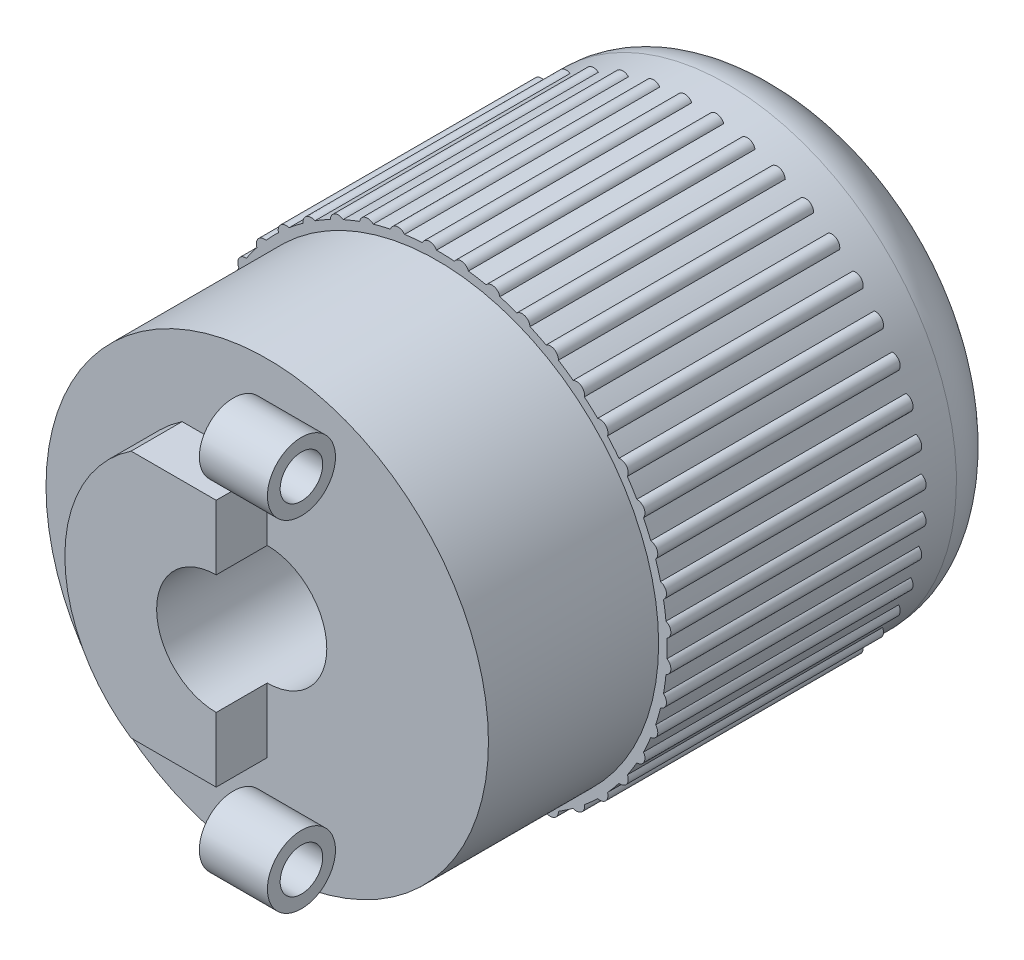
ISO-10303-21;
HEADER;
FILE_DESCRIPTION(('STEP AP214'),'2;1');
FILE_NAME('part.step','',(''),(''),'','','');
FILE_SCHEMA(('AUTOMOTIVE_DESIGN { 1 0 10303 214 1 1 1 1 }'));
ENDSEC;
DATA;
#1=APPLICATION_CONTEXT('core data for automotive mechanical design processes');
#2=APPLICATION_PROTOCOL_DEFINITION('international standard','automotive_design',2000,#1);
#3=PRODUCT_CONTEXT('',#1,'mechanical');
#4=PRODUCT('Part','Part','',(#3));
#5=PRODUCT_RELATED_PRODUCT_CATEGORY('part','',(#4));
#6=PRODUCT_DEFINITION_FORMATION('','',#4);
#7=PRODUCT_DEFINITION_CONTEXT('part definition',#1,'design');
#8=PRODUCT_DEFINITION('design','',#6,#7);
#9=PRODUCT_DEFINITION_SHAPE('','',#8);
#10=(LENGTH_UNIT() NAMED_UNIT(*) SI_UNIT(.MILLI.,.METRE.));
#11=(NAMED_UNIT(*) PLANE_ANGLE_UNIT() SI_UNIT($,.RADIAN.));
#12=(NAMED_UNIT(*) SI_UNIT($,.STERADIAN.) SOLID_ANGLE_UNIT());
#13=UNCERTAINTY_MEASURE_WITH_UNIT(LENGTH_MEASURE(1.E-05),#10,'distance_accuracy_value','');
#14=(GEOMETRIC_REPRESENTATION_CONTEXT(3) GLOBAL_UNCERTAINTY_ASSIGNED_CONTEXT((#13)) GLOBAL_UNIT_ASSIGNED_CONTEXT((#10,
#11,#12)) REPRESENTATION_CONTEXT('',''));
#15=CARTESIAN_POINT('',(0.,0.,0.));
#16=DIRECTION('',(0.,0.,1.));
#17=DIRECTION('',(1.,0.,0.));
#18=AXIS2_PLACEMENT_3D('',#15,#16,#17);
#19=CARTESIAN_POINT('',(0.,0.,10.));
#20=DIRECTION('',(0.,0.,1.));
#21=DIRECTION('',(1.,0.,0.));
#22=AXIS2_PLACEMENT_3D('',#19,#20,#21);
#23=PLANE('',#22);
#24=DIRECTION('',(0.,1.,0.));
#25=VECTOR('',#24,1.);
#26=CARTESIAN_POINT('',(0.,0.,10.));
#27=LINE('',#26,#25);
#28=CARTESIAN_POINT('',(0.,-10.1997498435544,10.));
#29=VERTEX_POINT('',#28);
#30=CARTESIAN_POINT('',(0.,-9.80025015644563,10.));
#31=VERTEX_POINT('',#30);
#32=EDGE_CURVE('E1363',#29,#31,#27,.T.);
#33=ORIENTED_EDGE('',*,*,#32,.T.);
#34=DIRECTION('',(-1.,0.,0.));
#35=VECTOR('',#34,1.);
#36=CARTESIAN_POINT('',(4.,-9.80025015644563,10.));
#37=LINE('',#36,#35);
#38=CARTESIAN_POINT('',(4.,-9.80025015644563,10.));
#39=VERTEX_POINT('',#38);
#40=EDGE_CURVE('E11',#31,#39,#37,.F.);
#41=ORIENTED_EDGE('',*,*,#40,.T.);
#42=DIRECTION('',(0.,1.,0.));
#43=VECTOR('',#42,1.);
#44=CARTESIAN_POINT('',(4.,0.,10.));
#45=LINE('',#44,#43);
#46=CARTESIAN_POINT('',(4.,-10.1997498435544,10.));
#47=VERTEX_POINT('',#46);
#48=EDGE_CURVE('E41',#47,#39,#45,.T.);
#49=ORIENTED_EDGE('',*,*,#48,.F.);
#50=DIRECTION('',(-1.,0.,0.));
#51=VECTOR('',#50,1.);
#52=CARTESIAN_POINT('',(4.,-10.1997498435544,10.));
#53=LINE('',#52,#51);
#54=EDGE_CURVE('E1360',#47,#29,#53,.T.);
#55=ORIENTED_EDGE('',*,*,#54,.T.);
#56=EDGE_LOOP('',(#33,#41,#49,#55));
#57=FACE_BOUND('',#56,.T.);
#58=CARTESIAN_POINT('',(0.,0.,10.));
#59=DIRECTION('',(0.,0.,1.));
#60=DIRECTION('',(1.,0.,0.));
#61=AXIS2_PLACEMENT_3D('',#58,#59,#60);
#62=CIRCLE('',#61,13.);
#63=CARTESIAN_POINT('',(13.,0.,10.));
#64=VERTEX_POINT('',#63);
#65=EDGE_CURVE('E1253',#64,#64,#62,.T.);
#66=ORIENTED_EDGE('',*,*,#65,.T.);
#67=EDGE_LOOP('',(#66));
#68=FACE_BOUND('',#67,.T.);
#69=DIRECTION('',(0.,1.,0.));
#70=VECTOR('',#69,1.);
#71=CARTESIAN_POINT('',(0.,0.,10.));
#72=LINE('',#71,#70);
#73=CARTESIAN_POINT('',(0.,9.80025015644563,10.));
#74=VERTEX_POINT('',#73);
#75=CARTESIAN_POINT('',(0.,10.1997498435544,10.));
#76=VERTEX_POINT('',#75);
#77=EDGE_CURVE('E1352',#74,#76,#72,.T.);
#78=ORIENTED_EDGE('',*,*,#77,.T.);
#79=DIRECTION('',(-1.,0.,0.));
#80=VECTOR('',#79,1.);
#81=CARTESIAN_POINT('',(4.,10.1997498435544,10.));
#82=LINE('',#81,#80);
#83=CARTESIAN_POINT('',(4.,10.1997498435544,10.));
#84=VERTEX_POINT('',#83);
#85=EDGE_CURVE('E1357',#76,#84,#82,.F.);
#86=ORIENTED_EDGE('',*,*,#85,.T.);
#87=DIRECTION('',(0.,1.,0.));
#88=VECTOR('',#87,1.);
#89=CARTESIAN_POINT('',(4.,0.,10.));
#90=LINE('',#89,#88);
#91=CARTESIAN_POINT('',(4.,9.80025015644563,10.));
#92=VERTEX_POINT('',#91);
#93=EDGE_CURVE('E1355',#92,#84,#90,.T.);
#94=ORIENTED_EDGE('',*,*,#93,.F.);
#95=DIRECTION('',(-1.,0.,0.));
#96=VECTOR('',#95,1.);
#97=CARTESIAN_POINT('',(4.,9.80025015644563,10.));
#98=LINE('',#97,#96);
#99=EDGE_CURVE('E1349',#92,#74,#98,.T.);
#100=ORIENTED_EDGE('',*,*,#99,.T.);
#101=EDGE_LOOP('',(#78,#86,#94,#100));
#102=FACE_BOUND('',#101,.T.);
#103=DIRECTION('',(-1.,0.,0.));
#104=VECTOR('',#103,1.);
#105=CARTESIAN_POINT('',(0.,7.3,10.));
#106=LINE('',#105,#104);
#107=CARTESIAN_POINT('',(0.,7.3,10.));
#108=VERTEX_POINT('',#107);
#109=CARTESIAN_POINT('',(-5.,7.3,10.));
#110=VERTEX_POINT('',#109);
#111=EDGE_CURVE('E1886',#108,#110,#106,.T.);
#112=ORIENTED_EDGE('',*,*,#111,.F.);
#113=DIRECTION('',(0.,1.,0.));
#114=VECTOR('',#113,1.);
#115=CARTESIAN_POINT('',(0.,3.5,10.));
#116=LINE('',#115,#114);
#117=CARTESIAN_POINT('',(0.,3.5,10.));
#118=VERTEX_POINT('',#117);
#119=EDGE_CURVE('E1884',#118,#108,#116,.T.);
#120=ORIENTED_EDGE('',*,*,#119,.F.);
#121=CARTESIAN_POINT('',(0.,0.,10.));
#122=DIRECTION('',(0.,0.,1.));
#123=DIRECTION('',(1.,0.,0.));
#124=AXIS2_PLACEMENT_3D('',#121,#122,#123);
#125=CIRCLE('',#124,3.5);
#126=CARTESIAN_POINT('',(0.,-3.5,10.));
#127=VERTEX_POINT('',#126);
#128=EDGE_CURVE('E674',#127,#118,#125,.T.);
#129=ORIENTED_EDGE('',*,*,#128,.F.);
#130=DIRECTION('',(0.,1.,0.));
#131=VECTOR('',#130,1.);
#132=CARTESIAN_POINT('',(0.,-3.5,10.));
#133=LINE('',#132,#131);
#134=CARTESIAN_POINT('',(0.,-7.3,10.));
#135=VERTEX_POINT('',#134);
#136=EDGE_CURVE('E670',#135,#127,#133,.T.);
#137=ORIENTED_EDGE('',*,*,#136,.F.);
#138=DIRECTION('',(1.,0.,0.));
#139=VECTOR('',#138,1.);
#140=CARTESIAN_POINT('',(0.,-7.3,10.));
#141=LINE('',#140,#139);
#142=CARTESIAN_POINT('',(-4.99999999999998,-7.3,10.));
#143=VERTEX_POINT('',#142);
#144=EDGE_CURVE('E1881',#143,#135,#141,.T.);
#145=ORIENTED_EDGE('',*,*,#144,.F.);
#146=CARTESIAN_POINT('',(-0.10178838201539,0.,10.));
#147=DIRECTION('',(0.,0.,1.));
#148=DIRECTION('',(1.,0.,0.));
#149=AXIS2_PLACEMENT_3D('',#146,#147,#148);
#150=CIRCLE('',#149,8.79104527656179);
#151=EDGE_CURVE('E1888',#110,#143,#150,.T.);
#152=ORIENTED_EDGE('',*,*,#151,.F.);
#153=EDGE_LOOP('',(#112,#120,#129,#137,#145,#152));
#154=FACE_BOUND('',#153,.T.);
#155=ADVANCED_FACE('F32',(#57,#68,#102,#154),#23,.T.);
#156=CARTESIAN_POINT('',(0.,0.,10.));
#157=DIRECTION('',(0.,0.,-1.));
#158=DIRECTION('',(-1.,0.,0.));
#159=AXIS2_PLACEMENT_3D('',#156,#157,#158);
#160=CYLINDRICAL_SURFACE('',#159,13.);
#161=ORIENTED_EDGE('',*,*,#65,.F.);
#162=EDGE_LOOP('',(#161));
#163=FACE_BOUND('',#162,.T.);
#164=CARTESIAN_POINT('',(0.,0.,0.));
#165=DIRECTION('',(0.,0.,-1.));
#166=DIRECTION('',(-1.,0.,0.));
#167=AXIS2_PLACEMENT_3D('',#164,#165,#166);
#168=CIRCLE('',#167,13.);
#169=CARTESIAN_POINT('',(-13.,0.,0.));
#170=VERTEX_POINT('',#169);
#171=EDGE_CURVE('E1250',#170,#170,#168,.T.);
#172=ORIENTED_EDGE('',*,*,#171,.F.);
#173=EDGE_LOOP('',(#172));
#174=FACE_BOUND('',#173,.T.);
#175=ADVANCED_FACE('F1393',(#163,#174),#160,.T.);
#176=CARTESIAN_POINT('',(0.,0.,0.));
#177=DIRECTION('',(0.,0.,-1.));
#178=DIRECTION('',(-1.,0.,0.));
#179=AXIS2_PLACEMENT_3D('',#176,#177,#178);
#180=PLANE('',#179);
#181=CARTESIAN_POINT('',(0.,0.,0.));
#182=DIRECTION('',(0.,0.,-1.));
#183=DIRECTION('',(-1.,0.,0.));
#184=AXIS2_PLACEMENT_3D('',#181,#182,#183);
#185=CIRCLE('',#184,13.5);
#186=CARTESIAN_POINT('',(3.66966066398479,12.9916738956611,0.));
#187=VERTEX_POINT('',#186);
#188=CARTESIAN_POINT('',(4.66770186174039,12.6673817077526,0.));
#189=VERTEX_POINT('',#188);
#190=EDGE_CURVE('E1249',#187,#189,#185,.T.);
#191=ORIENTED_EDGE('',*,*,#190,.F.);
#192=CARTESIAN_POINT('',(3.21360448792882,12.8886184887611,0.));
#193=DIRECTION('',(0.,0.,1.));
#194=DIRECTION('',(0.990268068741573,-0.139173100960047,0.));
#195=AXIS2_PLACEMENT_3D('',#192,#193,#194);
#196=CIRCLE('',#195,0.46755497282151);
#197=CARTESIAN_POINT('',(2.85931731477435,13.1937221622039,0.));
#198=VERTEX_POINT('',#197);
#199=EDGE_CURVE('E704',#187,#198,#196,.T.);
#200=ORIENTED_EDGE('',*,*,#199,.T.);
#201=CARTESIAN_POINT('',(1.82585623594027,13.3759578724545,0.));
#202=VERTEX_POINT('',#201);
#203=EDGE_CURVE('E1246',#202,#198,#185,.T.);
#204=ORIENTED_EDGE('',*,*,#203,.F.);
#205=CARTESIAN_POINT('',(1.38858090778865,13.2104346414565,0.));
#206=DIRECTION('',(0.,0.,1.));
#207=DIRECTION('',(1.,0.,0.));
#208=AXIS2_PLACEMENT_3D('',#205,#206,#207);
#209=CIRCLE('',#208,0.46755497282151);
#210=CARTESIAN_POINT('',(0.995279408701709,13.4632618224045,0.));
#211=VERTEX_POINT('',#210);
#212=EDGE_CURVE('E1231',#202,#211,#209,.T.);
#213=ORIENTED_EDGE('',*,*,#212,.T.);
#214=CARTESIAN_POINT('',(-0.0534864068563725,13.4998940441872,0.));
#215=VERTEX_POINT('',#214);
#216=EDGE_CURVE('E1243',#215,#211,#185,.T.);
#217=ORIENTED_EDGE('',*,*,#216,.F.);
#218=CARTESIAN_POINT('',(-0.463469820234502,13.2751247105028,0.));
#219=DIRECTION('',(0.,0.,1.));
#220=DIRECTION('',(0.99026806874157,0.139173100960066,0.));
#221=AXIS2_PLACEMENT_3D('',#218,#219,#220);
#222=CIRCLE('',#221,0.46755497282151);
#223=CARTESIAN_POINT('',(-0.888130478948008,13.4707544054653,0.));
#224=VERTEX_POINT('',#223);
#225=EDGE_CURVE('E1219',#215,#224,#222,.T.);
#226=ORIENTED_EDGE('',*,*,#225,.T.);
#227=CARTESIAN_POINT('',(-1.93178799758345,13.3610701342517,0.));
#228=VERTEX_POINT('',#227);
#229=EDGE_CURVE('E2708',#228,#224,#185,.T.);
#230=ORIENTED_EDGE('',*,*,#229,.F.);
#231=CARTESIAN_POINT('',(-2.30649963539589,13.0814295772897,0.));
#232=DIRECTION('',(0.,0.,1.));
#233=DIRECTION('',(0.961261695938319,0.275637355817,0.));
#234=AXIS2_PLACEMENT_3D('',#231,#232,#233);
#235=CIRCLE('',#234,0.46755497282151);
#236=CARTESIAN_POINT('',(-2.75425391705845,13.2160540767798,0.));
#237=VERTEX_POINT('',#236);
#238=EDGE_CURVE('E1207',#228,#237,#235,.T.);
#239=ORIENTED_EDGE('',*,*,#238,.T.);
#240=CARTESIAN_POINT('',(-3.77248953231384,12.962188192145,0.));
#241=VERTEX_POINT('',#240);
#242=EDGE_CURVE('E2707',#241,#237,#185,.T.);
#243=ORIENTED_EDGE('',*,*,#242,.F.);
#244=CARTESIAN_POINT('',(-4.10463605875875,12.6331192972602,0.));
#245=DIRECTION('',(0.,0.,1.));
#246=DIRECTION('',(0.9135454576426,0.406736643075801,0.));
#247=AXIS2_PLACEMENT_3D('',#244,#245,#246);
#248=CIRCLE('',#247,0.46755497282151);
#249=CARTESIAN_POINT('',(-4.56676893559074,12.7041182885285,0.));
#250=VERTEX_POINT('',#249);
#251=EDGE_CURVE('E1195',#241,#250,#248,.T.);
#252=ORIENTED_EDGE('',*,*,#251,.T.);
#253=CARTESIAN_POINT('',(-5.53976384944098,12.3110120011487,0.));
#254=VERTEX_POINT('',#253);
#255=EDGE_CURVE('E2706',#254,#250,#185,.T.);
#256=ORIENTED_EDGE('',*,*,#255,.F.);
#257=CARTESIAN_POINT('',(-5.82288041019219,11.9389197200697,0.));
#258=DIRECTION('',(0.,0.,1.));
#259=DIRECTION('',(0.848048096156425,0.529919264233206,0.));
#260=AXIS2_PLACEMENT_3D('',#257,#258,#259);
#261=CIRCLE('',#260,0.46755497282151);
#262=CARTESIAN_POINT('',(-6.29039699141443,11.9449112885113,0.));
#263=VERTEX_POINT('',#262);
#264=EDGE_CURVE('E1183',#254,#263,#261,.T.);
#265=ORIENTED_EDGE('',*,*,#264,.T.);
#266=CARTESIAN_POINT('',(-7.19921296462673,11.4202159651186,0.));
#267=VERTEX_POINT('',#266);
#268=EDGE_CURVE('E2705',#267,#263,#185,.T.);
#269=ORIENTED_EDGE('',*,*,#268,.F.);
#270=CARTESIAN_POINT('',(-7.42778901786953,11.012342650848,0.));
#271=DIRECTION('',(0.,0.,1.));
#272=DIRECTION('',(0.766044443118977,0.642787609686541,0.));
#273=AXIS2_PLACEMENT_3D('',#270,#271,#272);
#274=CIRCLE('',#273,0.46755497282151);
#275=CARTESIAN_POINT('',(-7.89158962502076,10.9532101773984,0.));
#276=VERTEX_POINT('',#275);
#277=EDGE_CURVE('E1171',#267,#276,#274,.T.);
#278=ORIENTED_EDGE('',*,*,#277,.T.);
#279=CARTESIAN_POINT('',(-8.7185375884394,10.3071384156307,0.));
#280=VERTEX_POINT('',#279);
#281=EDGE_CURVE('E2704',#280,#276,#185,.T.);
#282=ORIENTED_EDGE('',*,*,#281,.F.);
#283=CARTESIAN_POINT('',(-8.88812416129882,9.8714228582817,0.));
#284=DIRECTION('',(0.,0.,1.));
#285=DIRECTION('',(0.669130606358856,0.743144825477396,0.));
#286=AXIS2_PLACEMENT_3D('',#283,#284,#285);
#287=CIRCLE('',#286,0.46755497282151);
#288=CARTESIAN_POINT('',(-9.33918144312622,9.74831728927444,0.));
#289=VERTEX_POINT('',#288);
#290=EDGE_CURVE('E1159',#280,#289,#287,.T.);
#291=ORIENTED_EDGE('',*,*,#290,.T.);
#292=CARTESIAN_POINT('',(-10.0681657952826,8.99344414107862,0.));
#293=VERTEX_POINT('',#292);
#294=EDGE_CURVE('E2703',#293,#289,#185,.T.);
#295=ORIENTED_EDGE('',*,*,#294,.F.);
#296=CARTESIAN_POINT('',(-10.1754620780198,8.53836704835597,0.));
#297=DIRECTION('',(0.,0.,1.));
#298=DIRECTION('',(0.559192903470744,0.829037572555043,0.));
#299=AXIS2_PLACEMENT_3D('',#296,#297,#298);
#300=CIRCLE('',#299,0.46755497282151);
#301=CARTESIAN_POINT('',(-10.6049967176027,8.35368449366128,0.));
#302=VERTEX_POINT('',#301);
#303=EDGE_CURVE('E1147',#293,#302,#300,.T.);
#304=ORIENTED_EDGE('',*,*,#303,.T.);
#305=CARTESIAN_POINT('',(-11.2218286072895,7.50470270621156,0.));
#306=VERTEX_POINT('',#305);
#307=EDGE_CURVE('E2702',#306,#302,#185,.T.);
#308=ORIENTED_EDGE('',*,*,#307,.F.);
#309=CARTESIAN_POINT('',(-11.2647461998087,7.03912163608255,0.));
#310=DIRECTION('',(0.,0.,1.));
#311=DIRECTION('',(0.438371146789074,0.898794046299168,0.));
#312=AXIS2_PLACEMENT_3D('',#309,#310,#311);
#313=CIRCLE('',#312,0.46755497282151);
#314=CARTESIAN_POINT('',(-11.6643977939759,6.79645673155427,0.));
#315=VERTEX_POINT('',#314);
#316=EDGE_CURVE('E1135',#306,#315,#313,.T.);
#317=ORIENTED_EDGE('',*,*,#316,.T.);
#318=CARTESIAN_POINT('',(-12.1570712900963,5.86989076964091,0.));
#319=VERTEX_POINT('',#318);
#320=EDGE_CURVE('E2701',#319,#315,#185,.T.);
#321=ORIENTED_EDGE('',*,*,#320,.F.);
#322=CARTESIAN_POINT('',(-12.1347748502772,5.40286772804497,0.));
#323=DIRECTION('',(0.,0.,1.));
#324=DIRECTION('',(0.309016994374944,0.951056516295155,0.));
#325=AXIS2_PLACEMENT_3D('',#322,#323,#324);
#326=CIRCLE('',#325,0.46755497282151);
#327=CARTESIAN_POINT('',(-12.4967646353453,5.10694367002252,0.));
#328=VERTEX_POINT('',#327);
#329=EDGE_CURVE('E1123',#319,#328,#326,.T.);
#330=ORIENTED_EDGE('',*,*,#329,.T.);
#331=CARTESIAN_POINT('',(-12.8556904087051,4.12082808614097,0.));
#332=VERTEX_POINT('',#331);
#333=EDGE_CURVE('E2700',#332,#328,#185,.T.);
#334=ORIENTED_EDGE('',*,*,#333,.F.);
#335=CARTESIAN_POINT('',(-12.7686139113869,3.66145314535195,0.));
#336=DIRECTION('',(0.,0.,1.));
#337=DIRECTION('',(0.173648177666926,0.984807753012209,0.));
#338=AXIS2_PLACEMENT_3D('',#335,#336,#337);
#339=CIRCLE('',#338,0.46755497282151);
#340=CARTESIAN_POINT('',(-13.0858961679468,3.31802975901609,0.));
#341=VERTEX_POINT('',#340);
#342=EDGE_CURVE('E1111',#332,#341,#339,.T.);
#343=ORIENTED_EDGE('',*,*,#342,.T.);
#344=CARTESIAN_POINT('',(-13.3040881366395,2.29155817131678,0.));
#345=VERTEX_POINT('',#344);
#346=EDGE_CURVE('E2699',#345,#341,#185,.T.);
#347=ORIENTED_EDGE('',*,*,#346,.F.);
#348=CARTESIAN_POINT('',(-13.1539264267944,1.84877254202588,0.));
#349=DIRECTION('',(0.,0.,1.));
#350=DIRECTION('',(0.0348994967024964,0.999390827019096,0.));
#351=AXIS2_PLACEMENT_3D('',#348,#349,#350);
#352=CIRCLE('',#351,0.46755497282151);
#353=CARTESIAN_POINT('',(-13.4203256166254,1.46453417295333,0.));
#354=VERTEX_POINT('',#353);
#355=EDGE_CURVE('E1099',#345,#354,#352,.T.);
#356=ORIENTED_EDGE('',*,*,#355,.T.);
#357=CARTESIAN_POINT('',(-13.4935369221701,0.417685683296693,0.));
#358=VERTEX_POINT('',#357);
#359=EDGE_CURVE('E2698',#358,#354,#185,.T.);
#360=ORIENTED_EDGE('',*,*,#359,.F.);
#361=CARTESIAN_POINT('',(-13.283212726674,0.000107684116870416,0.));
#362=DIRECTION('',(0.,0.,1.));
#363=DIRECTION('',(-0.104528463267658,0.994521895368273,0.));
#364=AXIS2_PLACEMENT_3D('',#361,#362,#363);
#365=CIRCLE('',#364,0.46755497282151);
#366=CARTESIAN_POINT('',(-13.4935436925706,-0.417466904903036,0.));
#367=VERTEX_POINT('',#366);
#368=EDGE_CURVE('E1087',#358,#367,#365,.T.);
#369=ORIENTED_EDGE('',*,*,#368,.T.);
#370=CARTESIAN_POINT('',(-13.4203493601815,-1.46431658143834,0.));
#371=VERTEX_POINT('',#370);
#372=EDGE_CURVE('E2697',#371,#367,#185,.T.);
#373=ORIENTED_EDGE('',*,*,#372,.F.);
#374=CARTESIAN_POINT('',(-13.1539564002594,-1.84855926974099,0.));
#375=DIRECTION('',(0.,0.,1.));
#376=DIRECTION('',(-0.241921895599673,0.970295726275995,0.));
#377=AXIS2_PLACEMENT_3D('',#374,#375,#376);
#378=CIRCLE('',#377,0.46755497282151);
#379=CARTESIAN_POINT('',(-13.3041252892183,-2.29134246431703,0.));
#380=VERTEX_POINT('',#379);
#381=EDGE_CURVE('E1075',#371,#380,#378,.T.);
#382=ORIENTED_EDGE('',*,*,#381,.T.);
#383=CARTESIAN_POINT('',(-13.0859499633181,-3.3178175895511,0.));
#384=VERTEX_POINT('',#383);
#385=EDGE_CURVE('E2696',#384,#380,#185,.T.);
#386=ORIENTED_EDGE('',*,*,#385,.F.);
#387=CARTESIAN_POINT('',(-12.7686732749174,-3.66124612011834,0.));
#388=DIRECTION('',(0.,0.,1.));
#389=DIRECTION('',(-0.374606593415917,0.927183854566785,0.));
#390=AXIS2_PLACEMENT_3D('',#387,#388,#389);
#391=CIRCLE('',#390,0.46755497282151);
#392=CARTESIAN_POINT('',(-12.8557572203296,-4.12061964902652,0.));
#393=VERTEX_POINT('',#392);
#394=EDGE_CURVE('E1063',#384,#393,#391,.T.);
#395=ORIENTED_EDGE('',*,*,#394,.T.);
#396=CARTESIAN_POINT('',(-12.4968474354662,-5.10674105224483,0.));
#397=VERTEX_POINT('',#396);
#398=EDGE_CURVE('E2695',#397,#393,#185,.T.);
#399=ORIENTED_EDGE('',*,*,#398,.F.);
#400=CARTESIAN_POINT('',(-12.1348624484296,-5.40267097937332,0.));
#401=DIRECTION('',(0.,0.,1.));
#402=DIRECTION('',(-0.500000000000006,0.866025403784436,0.));
#403=AXIS2_PLACEMENT_3D('',#400,#401,#402);
#404=CIRCLE('',#403,0.46755497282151);
#405=CARTESIAN_POINT('',(-12.1571664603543,-5.86969365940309,0.));
#406=VERTEX_POINT('',#405);
#407=EDGE_CURVE('E1051',#397,#406,#404,.T.);
#408=ORIENTED_EDGE('',*,*,#407,.T.);
#409=CARTESIAN_POINT('',(-11.6645079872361,-6.79626760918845,0.));
#410=VERTEX_POINT('',#409);
#411=EDGE_CURVE('E2694',#410,#406,#185,.T.);
#412=ORIENTED_EDGE('',*,*,#411,.F.);
#413=CARTESIAN_POINT('',(-11.2648603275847,-7.03893899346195,0.));
#414=DIRECTION('',(0.,0.,1.));
#415=DIRECTION('',(-0.615661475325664,0.788010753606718,0.));
#416=AXIS2_PLACEMENT_3D('',#413,#414,#415);
#417=CIRCLE('',#416,0.46755497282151);
#418=CARTESIAN_POINT('',(-11.2219502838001,-7.50452075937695,0.));
#419=VERTEX_POINT('',#418);
#420=EDGE_CURVE('E1039',#410,#419,#417,.T.);
#421=ORIENTED_EDGE('',*,*,#420,.T.);
#422=CARTESIAN_POINT('',(-10.6051321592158,-8.35351254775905,0.));
#423=VERTEX_POINT('',#422);
#424=EDGE_CURVE('E2693',#423,#419,#185,.T.);
#425=ORIENTED_EDGE('',*,*,#424,.F.);
#426=CARTESIAN_POINT('',(-10.175600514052,-8.53820206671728,0.));
#427=DIRECTION('',(0.,0.,1.));
#428=DIRECTION('',(-0.719339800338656,0.694658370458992,0.));
#429=AXIS2_PLACEMENT_3D('',#426,#427,#428);
#430=CIRCLE('',#429,0.46755497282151);
#431=CARTESIAN_POINT('',(-10.0683116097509,-8.99328089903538,0.));
#432=VERTEX_POINT('',#431);
#433=EDGE_CURVE('E1027',#423,#432,#430,.T.);
#434=ORIENTED_EDGE('',*,*,#433,.T.);
#435=CARTESIAN_POINT('',(-9.33933949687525,-9.7481658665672,0.));
#436=VERTEX_POINT('',#435);
#437=EDGE_CURVE('E2692',#436,#432,#185,.T.);
#438=ORIENTED_EDGE('',*,*,#437,.F.);
#439=CARTESIAN_POINT('',(-8.8882842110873,-9.87127874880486,0.));
#440=DIRECTION('',(0.,0.,1.));
#441=DIRECTION('',(-0.809016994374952,0.587785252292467,0.));
#442=AXIS2_PLACEMENT_3D('',#439,#440,#441);
#443=CIRCLE('',#442,0.46755497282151);
#444=CARTESIAN_POINT('',(-8.7187047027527,-10.3069970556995,0.));
#445=VERTEX_POINT('',#444);
#446=EDGE_CURVE('E1015',#436,#445,#443,.T.);
#447=ORIENTED_EDGE('',*,*,#446,.T.);
#448=CARTESIAN_POINT('',(-7.8917672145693,-10.953082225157,0.));
#449=VERTEX_POINT('',#448);
#450=EDGE_CURVE('E2691',#449,#445,#185,.T.);
#451=ORIENTED_EDGE('',*,*,#450,.F.);
#452=CARTESIAN_POINT('',(-7.42796756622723,-11.0122222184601,0.));
#453=DIRECTION('',(0.,0.,1.));
#454=DIRECTION('',(-0.882947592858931,0.469471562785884,0.));
#455=AXIS2_PLACEMENT_3D('',#452,#453,#454);
#456=CIRCLE('',#455,0.46755497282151);
#457=CARTESIAN_POINT('',(-7.199398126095,-11.4200992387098,0.));
#458=VERTEX_POINT('',#457);
#459=EDGE_CURVE('E1003',#449,#458,#456,.T.);
#460=ORIENTED_EDGE('',*,*,#459,.T.);
#461=CARTESIAN_POINT('',(-6.29059066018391,-11.9448092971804,0.));
#462=VERTEX_POINT('',#461);
#463=EDGE_CURVE('E2690',#462,#458,#185,.T.);
#464=ORIENTED_EDGE('',*,*,#463,.F.);
#465=CARTESIAN_POINT('',(-5.82307398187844,-11.9388253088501,0.));
#466=DIRECTION('',(0.,0.,1.));
#467=DIRECTION('',(-0.939692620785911,0.342020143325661,0.));
#468=AXIS2_PLACEMENT_3D('',#465,#466,#467);
#469=CIRCLE('',#468,0.46755497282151);
#470=CARTESIAN_POINT('',(-5.53996345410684,-12.3109221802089,0.));
#471=VERTEX_POINT('',#470);
#472=EDGE_CURVE('E991',#462,#471,#469,.T.);
#473=ORIENTED_EDGE('',*,*,#472,.T.);
#474=CARTESIAN_POINT('',(-4.56697491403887,-12.7040442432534,0.));
#475=VERTEX_POINT('',#474);
#476=EDGE_CURVE('E2689',#475,#471,#185,.T.);
#477=ORIENTED_EDGE('',*,*,#476,.F.);
#478=CARTESIAN_POINT('',(-4.10484088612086,-12.6330527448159,0.));
#479=DIRECTION('',(0.,0.,1.));
#480=DIRECTION('',(-0.978147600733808,0.207911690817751,0.));
#481=AXIS2_PLACEMENT_3D('',#478,#479,#480);
#482=CIRCLE('',#481,0.46755497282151);
#483=CARTESIAN_POINT('',(-3.77269969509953,-12.9621270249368,0.));
#484=VERTEX_POINT('',#483);
#485=EDGE_CURVE('E979',#475,#484,#482,.T.);
#486=ORIENTED_EDGE('',*,*,#485,.T.);
#487=CARTESIAN_POINT('',(-2.75446819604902,-13.2160094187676,0.));
#488=VERTEX_POINT('',#487);
#489=EDGE_CURVE('E2688',#488,#484,#185,.T.);
#490=ORIENTED_EDGE('',*,*,#489,.F.);
#491=CARTESIAN_POINT('',(-2.30671173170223,-13.0813921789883,0.));
#492=DIRECTION('',(0.,0.,1.));
#493=DIRECTION('',(-0.997564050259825,0.0697564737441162,0.));
#494=AXIS2_PLACEMENT_3D('',#491,#492,#493);
#495=CIRCLE('',#494,0.46755497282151);
#496=CARTESIAN_POINT('',(-1.9320046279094,-13.3610388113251,0.));
#497=VERTEX_POINT('',#496);
#498=EDGE_CURVE('E967',#488,#497,#495,.T.);
#499=ORIENTED_EDGE('',*,*,#498,.T.);
#500=CARTESIAN_POINT('',(-0.888348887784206,-13.4707400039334,0.));
#501=VERTEX_POINT('',#500);
#502=EDGE_CURVE('E2687',#501,#497,#185,.T.);
#503=ORIENTED_EDGE('',*,*,#502,.F.);
#504=CARTESIAN_POINT('',(-0.463685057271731,-13.2751171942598,0.));
#505=DIRECTION('',(0.,0.,1.));
#506=DIRECTION('',(-0.997564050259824,-0.069756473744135,0.));
#507=AXIS2_PLACEMENT_3D('',#504,#505,#506);
#508=CIRCLE('',#507,0.46755497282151);
#509=CARTESIAN_POINT('',(-0.0537052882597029,-13.4998931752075,0.));
#510=VERTEX_POINT('',#509);
#511=EDGE_CURVE('E955',#501,#510,#508,.T.);
#512=ORIENTED_EDGE('',*,*,#511,.T.);
#513=CARTESIAN_POINT('',(0.995061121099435,-13.4632779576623,0.));
#514=VERTEX_POINT('',#513);
#515=EDGE_CURVE('E2686',#514,#510,#185,.T.);
#516=ORIENTED_EDGE('',*,*,#515,.F.);
#517=CARTESIAN_POINT('',(1.38836671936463,-13.2104571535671,0.));
#518=DIRECTION('',(0.,0.,1.));
#519=DIRECTION('',(-0.978147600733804,-0.207911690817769,0.));
#520=AXIS2_PLACEMENT_3D('',#517,#518,#519);
#521=CIRCLE('',#520,0.46755497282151);
#522=CARTESIAN_POINT('',(1.8256393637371,-13.3759874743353,0.));
#523=VERTEX_POINT('',#522);
#524=EDGE_CURVE('E943',#514,#523,#521,.T.);
#525=ORIENTED_EDGE('',*,*,#524,.T.);
#526=CARTESIAN_POINT('',(2.85910339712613,-13.193768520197,0.));
#527=VERTEX_POINT('',#526);
#528=EDGE_CURVE('E2685',#527,#523,#185,.T.);
#529=ORIENTED_EDGE('',*,*,#528,.F.);
#530=CARTESIAN_POINT('',(3.21339551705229,-12.8886705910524,0.));
#531=DIRECTION('',(0.,0.,1.));
#532=DIRECTION('',(-0.939692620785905,-0.342020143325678,0.));
#533=AXIS2_PLACEMENT_3D('',#530,#531,#532);
#534=CIRCLE('',#533,0.46755497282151);
#535=CARTESIAN_POINT('',(3.66945002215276,-12.9917333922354,0.));
#536=VERTEX_POINT('',#535);
#537=EDGE_CURVE('E931',#527,#536,#534,.T.);
#538=ORIENTED_EDGE('',*,*,#537,.T.);
#539=CARTESIAN_POINT('',(4.66749647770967,-12.6674573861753,0.));
#540=VERTEX_POINT('',#539);
#541=EDGE_CURVE('E2684',#540,#536,#185,.T.);
#542=ORIENTED_EDGE('',*,*,#541,.F.);
#543=CARTESIAN_POINT('',(4.97587922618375,-12.3160207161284,0.));
#544=DIRECTION('',(0.,0.,1.));
#545=DIRECTION('',(-0.882947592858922,-0.4694715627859,0.));
#546=AXIS2_PLACEMENT_3D('',#543,#544,#545);
#547=CIRCLE('',#546,0.46755497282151);
#548=CARTESIAN_POINT('',(5.44183900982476,-12.3546099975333,0.));
#549=VERTEX_POINT('',#548);
#550=EDGE_CURVE('E919',#540,#549,#547,.T.);
#551=ORIENTED_EDGE('',*,*,#550,.T.);
#552=CARTESIAN_POINT('',(6.38504204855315,-11.8945886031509,0.));
#553=VERTEX_POINT('',#552);
#554=EDGE_CURVE('E2683',#553,#549,#185,.T.);
#555=ORIENTED_EDGE('',*,*,#554,.F.);
#556=CARTESIAN_POINT('',(6.64151310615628,-11.5036535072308,0.));
#557=DIRECTION('',(0.,0.,1.));
#558=DIRECTION('',(-0.809016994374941,-0.587785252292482,0.));
#559=AXIS2_PLACEMENT_3D('',#556,#557,#558);
#560=CIRCLE('',#559,0.46755497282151);
#561=CARTESIAN_POINT('',(7.10830879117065,-11.4770181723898,0.));
#562=VERTEX_POINT('',#561);
#563=EDGE_CURVE('E907',#553,#562,#560,.T.);
#564=ORIENTED_EDGE('',*,*,#563,.T.);
#565=CARTESIAN_POINT('',(7.97831003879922,-10.8902051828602,0.));
#566=VERTEX_POINT('',#565);
#567=EDGE_CURVE('E2682',#566,#562,#185,.T.);
#568=ORIENTED_EDGE('',*,*,#567,.F.);
#569=CARTESIAN_POINT('',(8.17787748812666,-10.467380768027,0.));
#570=DIRECTION('',(0.,0.,1.));
#571=DIRECTION('',(-0.719339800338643,-0.694658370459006,0.));
#572=AXIS2_PLACEMENT_3D('',#569,#570,#571);
#573=CIRCLE('',#572,0.46755497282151);
#574=CARTESIAN_POINT('',(8.6364234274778,-10.3760392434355,0.));
#575=VERTEX_POINT('',#574);
#576=EDGE_CURVE('E895',#566,#575,#573,.T.);
#577=ORIENTED_EDGE('',*,*,#576,.T.);
#578=CARTESIAN_POINT('',(9.41628929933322,-9.67385630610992,0.));
#579=VERTEX_POINT('',#578);
#580=EDGE_CURVE('E2681',#579,#575,#185,.T.);
#581=ORIENTED_EDGE('',*,*,#580,.F.);
#582=CARTESIAN_POINT('',(9.55506878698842,-9.22737236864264,0.));
#583=DIRECTION('',(0.,0.,1.));
#584=DIRECTION('',(-0.615661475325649,-0.788010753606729,0.));
#585=AXIS2_PLACEMENT_3D('',#582,#583,#584);
#586=CIRCLE('',#585,0.46755497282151);
#587=CARTESIAN_POINT('',(9.99643990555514,-9.07310251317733,0.));
#588=VERTEX_POINT('',#587);
#589=EDGE_CURVE('E883',#579,#588,#586,.T.);
#590=ORIENTED_EDGE('',*,*,#589,.T.);
#591=CARTESIAN_POINT('',(10.670991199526,-8.26921682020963,0.));
#592=VERTEX_POINT('',#591);
#593=EDGE_CURVE('E2680',#592,#588,#185,.T.);
#594=ORIENTED_EDGE('',*,*,#593,.F.);
#595=CARTESIAN_POINT('',(10.7462815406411,-7.80776366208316,0.));
#596=DIRECTION('',(0.,0.,1.));
#597=DIRECTION('',(-0.499999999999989,-0.866025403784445,0.));
#598=AXIS2_PLACEMENT_3D('',#595,#596,#597);
#599=CIRCLE('',#598,0.46755497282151);
#600=CARTESIAN_POINT('',(11.1618870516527,-7.59356816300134,0.));
#601=VERTEX_POINT('',#600);
#602=EDGE_CURVE('E871',#592,#601,#599,.T.);
#603=ORIENTED_EDGE('',*,*,#602,.T.);
#604=CARTESIAN_POINT('',(11.7179943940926,-6.70362643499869,0.));
#605=VERTEX_POINT('',#604);
#606=EDGE_CURVE('E2679',#605,#601,#185,.T.);
#607=ORIENTED_EDGE('',*,*,#606,.F.);
#608=CARTESIAN_POINT('',(11.7283301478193,-6.23618571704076,0.));
#609=DIRECTION('',(0.,0.,1.));
#610=DIRECTION('',(-0.3746065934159,-0.927183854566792,0.));
#611=AXIS2_PLACEMENT_3D('',#608,#609,#610);
#612=CIRCLE('',#611,0.46755497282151);
#613=CARTESIAN_POINT('',(12.1100807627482,-5.9662336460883,0.));
#614=VERTEX_POINT('',#613);
#615=EDGE_CURVE('E859',#605,#614,#612,.T.);
#616=ORIENTED_EDGE('',*,*,#615,.T.);
#617=CARTESIAN_POINT('',(12.5369201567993,-5.00755758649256,0.));
#618=VERTEX_POINT('',#617);
#619=EDGE_CURVE('E2678',#618,#614,#185,.T.);
#620=ORIENTED_EDGE('',*,*,#619,.F.);
#621=CARTESIAN_POINT('',(12.482100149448,-4.54322751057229,0.));
#622=DIRECTION('',(0.,0.,1.));
#623=DIRECTION('',(-0.241921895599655,-0.970295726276,0.));
#624=AXIS2_PLACEMENT_3D('',#621,#622,#623);
#625=CIRCLE('',#624,0.46755497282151);
#626=CARTESIAN_POINT('',(12.8225655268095,-4.22277317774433,0.));
#627=VERTEX_POINT('',#626);
#628=EDGE_CURVE('E847',#618,#627,#625,.T.);
#629=ORIENTED_EDGE('',*,*,#628,.T.);
#630=CARTESIAN_POINT('',(13.1118290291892,-3.21402232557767,0.));
#631=VERTEX_POINT('',#630);
#632=EDGE_CURVE('E2677',#631,#627,#185,.T.);
#633=ORIENTED_EDGE('',*,*,#632,.F.);
#634=CARTESIAN_POINT('',(12.9929202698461,-2.76184054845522,0.));
#635=DIRECTION('',(0.,0.,1.));
#636=DIRECTION('',(-0.10452846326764,-0.994521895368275,0.));
#637=AXIS2_PLACEMENT_3D('',#634,#635,#636);
#638=CIRCLE('',#637,0.46755497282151);
#639=CARTESIAN_POINT('',(13.2854736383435,-2.39712123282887,0.));
#640=VERTEX_POINT('',#639);
#641=EDGE_CURVE('E835',#631,#640,#638,.T.);
#642=ORIENTED_EDGE('',*,*,#641,.T.);
#643=CARTESIAN_POINT('',(13.4315310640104,-1.35792977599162,0.));
#644=VERTEX_POINT('',#643);
#645=EDGE_CURVE('E2676',#644,#640,#185,.T.);
#646=ORIENTED_EDGE('',*,*,#645,.F.);
#647=CARTESIAN_POINT('',(13.2508479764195,-0.926697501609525,0.));
#648=DIRECTION('',(0.,0.,1.));
#649=DIRECTION('',(0.0348994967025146,-0.999390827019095,0.));
#650=AXIS2_PLACEMENT_3D('',#647,#648,#649);
#651=CIRCLE('',#650,0.46755497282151);
#652=CARTESIAN_POINT('',(13.4897951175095,-0.524812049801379,0.));
#653=VERTEX_POINT('',#652);
#654=EDGE_CURVE('E823',#644,#653,#651,.T.);
#655=ORIENTED_EDGE('',*,*,#654,.T.);
#656=CARTESIAN_POINT('',(13.4898036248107,0.524593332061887,0.));
#657=VERTEX_POINT('',#656);
#658=EDGE_CURVE('E2675',#657,#653,#185,.T.);
#659=ORIENTED_EDGE('',*,*,#658,.F.);
#660=CARTESIAN_POINT('',(13.250862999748,0.926482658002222,0.));
#661=DIRECTION('',(0.,0.,1.));
#662=DIRECTION('',(0.173648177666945,-0.984807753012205,0.));
#663=AXIS2_PLACEMENT_3D('',#660,#661,#662);
#664=CIRCLE('',#663,0.46755497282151);
#665=CARTESIAN_POINT('',(13.4315530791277,1.35771200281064,0.));
#666=VERTEX_POINT('',#665);
#667=EDGE_CURVE('E811',#657,#666,#664,.T.);
#668=ORIENTED_EDGE('',*,*,#667,.T.);
#669=CARTESIAN_POINT('',(13.2855125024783,2.39690582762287,0.));
#670=VERTEX_POINT('',#669);
#671=EDGE_CURVE('E2674',#670,#666,#185,.T.);
#672=ORIENTED_EDGE('',*,*,#671,.F.);
#673=CARTESIAN_POINT('',(12.9929650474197,2.76162988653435,0.));
#674=DIRECTION('',(0.,0.,1.));
#675=DIRECTION('',(0.309016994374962,-0.951056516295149,0.));
#676=AXIS2_PLACEMENT_3D('',#673,#674,#675);
#677=CIRCLE('',#676,0.46755497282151);
#678=CARTESIAN_POINT('',(13.1118811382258,3.21380973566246,0.));
#679=VERTEX_POINT('',#678);
#680=EDGE_CURVE('E799',#670,#679,#677,.T.);
#681=ORIENTED_EDGE('',*,*,#680,.T.);
#682=CARTESIAN_POINT('',(12.8226339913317,4.22256527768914,0.));
#683=VERTEX_POINT('',#682);
#684=EDGE_CURVE('E2673',#683,#679,#185,.T.);
#685=ORIENTED_EDGE('',*,*,#684,.F.);
#686=CARTESIAN_POINT('',(12.4821738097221,4.54302513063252,0.));
#687=DIRECTION('',(0.,0.,1.));
#688=DIRECTION('',(0.438371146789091,-0.89879404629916,0.));
#689=AXIS2_PLACEMENT_3D('',#686,#687,#688);
#690=CIRCLE('',#689,0.46755497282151);
#691=CARTESIAN_POINT('',(12.5370013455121,5.007354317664,0.));
#692=VERTEX_POINT('',#691);
#693=EDGE_CURVE('E787',#683,#692,#690,.T.);
#694=ORIENTED_EDGE('',*,*,#693,.T.);
#695=CARTESIAN_POINT('',(12.1101774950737,5.96603729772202,0.));
#696=VERTEX_POINT('',#695);
#697=EDGE_CURVE('E2672',#696,#692,#185,.T.);
#698=ORIENTED_EDGE('',*,*,#697,.F.);
#699=CARTESIAN_POINT('',(11.7284312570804,6.23599555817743,0.));
#700=DIRECTION('',(0.,0.,1.));
#701=DIRECTION('',(0.55919290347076,-0.829037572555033,0.));
#702=AXIS2_PLACEMENT_3D('',#699,#700,#701);
#703=CIRCLE('',#702,0.46755497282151);
#704=CARTESIAN_POINT('',(11.7181030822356,6.70343644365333,0.));
#705=VERTEX_POINT('',#704);
#706=EDGE_CURVE('E775',#696,#705,#703,.T.);
#707=ORIENTED_EDGE('',*,*,#706,.T.);
#708=CARTESIAN_POINT('',(11.1620101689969,7.59338718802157,0.));
#709=VERTEX_POINT('',#708);
#710=EDGE_CURVE('E2671',#709,#705,#185,.T.);
#711=ORIENTED_EDGE('',*,*,#710,.F.);
#712=CARTESIAN_POINT('',(10.7464081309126,7.80758942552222,0.));
#713=DIRECTION('',(0.,0.,1.));
#714=DIRECTION('',(0.66913060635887,-0.743144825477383,0.));
#715=AXIS2_PLACEMENT_3D('',#712,#713,#714);
#716=CIRCLE('',#715,0.46755497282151);
#717=CARTESIAN_POINT('',(10.6711252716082,8.26904380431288,0.));
#718=VERTEX_POINT('',#717);
#719=EDGE_CURVE('E763',#709,#718,#716,.T.);
#720=ORIENTED_EDGE('',*,*,#719,.T.);
#721=CARTESIAN_POINT('',(9.99658701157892,9.07294043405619,0.));
#722=VERTEX_POINT('',#721);
#723=EDGE_CURVE('E2670',#722,#718,#185,.T.);
#724=ORIENTED_EDGE('',*,*,#723,.F.);
#725=CARTESIAN_POINT('',(9.55521839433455,9.22721744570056,0.));
#726=DIRECTION('',(0.,0.,1.));
#727=DIRECTION('',(0.766044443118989,-0.642787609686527,0.));
#728=AXIS2_PLACEMENT_3D('',#725,#726,#727);
#729=CIRCLE('',#728,0.46755497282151);
#730=CARTESIAN_POINT('',(9.41644614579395,9.6737036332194,0.));
#731=VERTEX_POINT('',#730);
#732=EDGE_CURVE('E751',#722,#731,#729,.T.);
#733=ORIENTED_EDGE('',*,*,#732,.T.);
#734=CARTESIAN_POINT('',(8.63659165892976,10.3758992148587,0.));
#735=VERTEX_POINT('',#734);
#736=EDGE_CURVE('E2669',#735,#731,#185,.T.);
#737=ORIENTED_EDGE('',*,*,#736,.F.);
#738=CARTESIAN_POINT('',(8.17804720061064,10.4672481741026,0.));
#739=DIRECTION('',(0.,0.,1.));
#740=DIRECTION('',(0.848048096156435,-0.529919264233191,0.));
#741=AXIS2_PLACEMENT_3D('',#738,#739,#740);
#742=CIRCLE('',#741,0.46755497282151);
#743=CARTESIAN_POINT('',(7.97848660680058,10.8900758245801,0.));
#744=VERTEX_POINT('',#743);
#745=EDGE_CURVE('E739',#735,#744,#742,.T.);
#746=ORIENTED_EDGE('',*,*,#745,.T.);
#747=CARTESIAN_POINT('',(7.10849487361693,11.4769029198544,0.));
#748=VERTEX_POINT('',#747);
#749=EDGE_CURVE('E2668',#748,#744,#185,.T.);
#750=ORIENTED_EDGE('',*,*,#749,.F.);
#751=CARTESIAN_POINT('',(6.64169962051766,11.5035458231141,0.));
#752=DIRECTION('',(0.,0.,1.));
#753=DIRECTION('',(0.913545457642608,-0.406736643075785,0.));
#754=AXIS2_PLACEMENT_3D('',#751,#752,#753);
#755=CIRCLE('',#754,0.46755497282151);
#756=CARTESIAN_POINT('',(6.38523490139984,11.894485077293,0.));
#757=VERTEX_POINT('',#756);
#758=EDGE_CURVE('E727',#748,#757,#755,.T.);
#759=ORIENTED_EDGE('',*,*,#758,.T.);
#760=CARTESIAN_POINT('',(5.44203932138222,12.3545217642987,0.));
#761=VERTEX_POINT('',#760);
#762=EDGE_CURVE('E2662',#761,#757,#185,.T.);
#763=ORIENTED_EDGE('',*,*,#762,.F.);
#764=CARTESIAN_POINT('',(4.97607891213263,12.3159400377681,0.));
#765=DIRECTION('',(0.,0.,1.));
#766=DIRECTION('',(0.961261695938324,-0.275637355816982,0.));
#767=AXIS2_PLACEMENT_3D('',#764,#765,#766);
#768=CIRCLE('',#767,0.46755497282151);
#769=EDGE_CURVE('E715',#761,#189,#768,.T.);
#770=ORIENTED_EDGE('',*,*,#769,.T.);
#771=EDGE_LOOP('',(#191,#200,#204,#213,#217,#226,#230,#239,#243,#252,#256,#265,#269,#278,#282,
#291,#295,#304,#308,#317,#321,#330,#334,#343,#347,#356,#360,#369,#373,#382,#386,#395,#399,#408,
#412,#421,#425,#434,#438,#447,#451,#460,#464,#473,#477,#486,#490,#499,#503,#512,#516,#525,#529,
#538,#542,#551,#555,#564,#568,#577,#581,#590,#594,#603,#607,#616,#620,#629,#633,#642,#646,#655,
#659,#668,#672,#681,#685,#694,#698,#707,#711,#720,#724,#733,#737,#746,#750,#759,#763,#770));
#772=FACE_BOUND('',#771,.T.);
#773=ORIENTED_EDGE('',*,*,#171,.T.);
#774=EDGE_LOOP('',(#773));
#775=FACE_BOUND('',#774,.T.);
#776=ADVANCED_FACE('F1398',(#772,#775),#180,.F.);
#777=CARTESIAN_POINT('',(0.,0.,-17.));
#778=DIRECTION('',(0.,0.,1.));
#779=DIRECTION('',(1.,0.,0.));
#780=AXIS2_PLACEMENT_3D('',#777,#778,#779);
#781=CYLINDRICAL_SURFACE('',#780,13.5);
#782=ORIENTED_EDGE('',*,*,#203,.T.);
#783=DIRECTION('',(0.,0.,1.));
#784=VECTOR('',#783,1.);
#785=CARTESIAN_POINT('',(2.85931731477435,13.193722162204,-15.));
#786=LINE('',#785,#784);
#787=CARTESIAN_POINT('',(2.85931731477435,13.1937221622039,-15.));
#788=VERTEX_POINT('',#787);
#789=EDGE_CURVE('E712',#788,#198,#786,.T.);
#790=ORIENTED_EDGE('',*,*,#789,.F.);
#791=CARTESIAN_POINT('',(0.,0.,-15.));
#792=DIRECTION('',(0.,0.,-1.));
#793=DIRECTION('',(-1.,0.,0.));
#794=AXIS2_PLACEMENT_3D('',#791,#792,#793);
#795=CIRCLE('',#794,13.5);
#796=CARTESIAN_POINT('',(3.66966066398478,12.9916738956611,-15.));
#797=VERTEX_POINT('',#796);
#798=EDGE_CURVE('E1347',#788,#797,#795,.T.);
#799=ORIENTED_EDGE('',*,*,#798,.T.);
#800=DIRECTION('',(0.,0.,1.));
#801=VECTOR('',#800,1.);
#802=CARTESIAN_POINT('',(3.66966066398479,12.9916738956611,-15.));
#803=LINE('',#802,#801);
#804=EDGE_CURVE('E709',#797,#187,#803,.T.);
#805=ORIENTED_EDGE('',*,*,#804,.T.);
#806=ORIENTED_EDGE('',*,*,#190,.T.);
#807=DIRECTION('',(0.,0.,1.));
#808=VECTOR('',#807,1.);
#809=CARTESIAN_POINT('',(4.66770186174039,12.6673817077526,-15.));
#810=LINE('',#809,#808);
#811=CARTESIAN_POINT('',(4.66770186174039,12.6673817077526,-15.));
#812=VERTEX_POINT('',#811);
#813=EDGE_CURVE('E724',#812,#189,#810,.T.);
#814=ORIENTED_EDGE('',*,*,#813,.F.);
#815=CARTESIAN_POINT('',(0.,0.,-15.));
#816=DIRECTION('',(0.,0.,-1.));
#817=DIRECTION('',(-1.,0.,0.));
#818=AXIS2_PLACEMENT_3D('',#815,#816,#817);
#819=CIRCLE('',#818,13.5);
#820=CARTESIAN_POINT('',(5.44203932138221,12.3545217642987,-15.));
#821=VERTEX_POINT('',#820);
#822=EDGE_CURVE('E1345',#812,#821,#819,.T.);
#823=ORIENTED_EDGE('',*,*,#822,.T.);
#824=DIRECTION('',(0.,0.,1.));
#825=VECTOR('',#824,1.);
#826=CARTESIAN_POINT('',(5.44203932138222,12.3545217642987,-15.));
#827=LINE('',#826,#825);
#828=EDGE_CURVE('E721',#821,#761,#827,.T.);
#829=ORIENTED_EDGE('',*,*,#828,.T.);
#830=ORIENTED_EDGE('',*,*,#762,.T.);
#831=DIRECTION('',(0.,0.,1.));
#832=VECTOR('',#831,1.);
#833=CARTESIAN_POINT('',(6.38523490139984,11.894485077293,-15.));
#834=LINE('',#833,#832);
#835=CARTESIAN_POINT('',(6.38523490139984,11.894485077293,-15.));
#836=VERTEX_POINT('',#835);
#837=EDGE_CURVE('E736',#836,#757,#834,.T.);
#838=ORIENTED_EDGE('',*,*,#837,.F.);
#839=CARTESIAN_POINT('',(0.,0.,-15.));
#840=DIRECTION('',(0.,0.,-1.));
#841=DIRECTION('',(-1.,0.,0.));
#842=AXIS2_PLACEMENT_3D('',#839,#840,#841);
#843=CIRCLE('',#842,13.5);
#844=CARTESIAN_POINT('',(7.10849487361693,11.4769029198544,-15.));
#845=VERTEX_POINT('',#844);
#846=EDGE_CURVE('E1343',#836,#845,#843,.T.);
#847=ORIENTED_EDGE('',*,*,#846,.T.);
#848=DIRECTION('',(0.,0.,1.));
#849=VECTOR('',#848,1.);
#850=CARTESIAN_POINT('',(7.10849487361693,11.4769029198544,-15.));
#851=LINE('',#850,#849);
#852=EDGE_CURVE('E733',#845,#748,#851,.T.);
#853=ORIENTED_EDGE('',*,*,#852,.T.);
#854=ORIENTED_EDGE('',*,*,#749,.T.);
#855=DIRECTION('',(0.,0.,1.));
#856=VECTOR('',#855,1.);
#857=CARTESIAN_POINT('',(7.97848660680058,10.8900758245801,-15.));
#858=LINE('',#857,#856);
#859=CARTESIAN_POINT('',(7.97848660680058,10.8900758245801,-15.));
#860=VERTEX_POINT('',#859);
#861=EDGE_CURVE('E748',#860,#744,#858,.T.);
#862=ORIENTED_EDGE('',*,*,#861,.F.);
#863=CARTESIAN_POINT('',(0.,0.,-15.));
#864=DIRECTION('',(0.,0.,-1.));
#865=DIRECTION('',(-1.,0.,0.));
#866=AXIS2_PLACEMENT_3D('',#863,#864,#865);
#867=CIRCLE('',#866,13.5);
#868=CARTESIAN_POINT('',(8.63659165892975,10.3758992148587,-15.));
#869=VERTEX_POINT('',#868);
#870=EDGE_CURVE('E1341',#860,#869,#867,.T.);
#871=ORIENTED_EDGE('',*,*,#870,.T.);
#872=DIRECTION('',(0.,0.,1.));
#873=VECTOR('',#872,1.);
#874=CARTESIAN_POINT('',(8.63659165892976,10.3758992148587,-15.));
#875=LINE('',#874,#873);
#876=EDGE_CURVE('E745',#869,#735,#875,.T.);
#877=ORIENTED_EDGE('',*,*,#876,.T.);
#878=ORIENTED_EDGE('',*,*,#736,.T.);
#879=DIRECTION('',(0.,0.,1.));
#880=VECTOR('',#879,1.);
#881=CARTESIAN_POINT('',(9.41644614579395,9.6737036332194,-15.));
#882=LINE('',#881,#880);
#883=CARTESIAN_POINT('',(9.41644614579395,9.6737036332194,-15.));
#884=VERTEX_POINT('',#883);
#885=EDGE_CURVE('E760',#884,#731,#882,.T.);
#886=ORIENTED_EDGE('',*,*,#885,.F.);
#887=CARTESIAN_POINT('',(0.,0.,-15.));
#888=DIRECTION('',(0.,0.,-1.));
#889=DIRECTION('',(-1.,0.,0.));
#890=AXIS2_PLACEMENT_3D('',#887,#888,#889);
#891=CIRCLE('',#890,13.5);
#892=CARTESIAN_POINT('',(9.99658701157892,9.07294043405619,-15.));
#893=VERTEX_POINT('',#892);
#894=EDGE_CURVE('E1339',#884,#893,#891,.T.);
#895=ORIENTED_EDGE('',*,*,#894,.T.);
#896=DIRECTION('',(0.,0.,1.));
#897=VECTOR('',#896,1.);
#898=CARTESIAN_POINT('',(9.99658701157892,9.07294043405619,-15.));
#899=LINE('',#898,#897);
#900=EDGE_CURVE('E757',#893,#722,#899,.T.);
#901=ORIENTED_EDGE('',*,*,#900,.T.);
#902=ORIENTED_EDGE('',*,*,#723,.T.);
#903=DIRECTION('',(0.,0.,1.));
#904=VECTOR('',#903,1.);
#905=CARTESIAN_POINT('',(10.6711252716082,8.26904380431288,-15.));
#906=LINE('',#905,#904);
#907=CARTESIAN_POINT('',(10.6711252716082,8.26904380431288,-15.));
#908=VERTEX_POINT('',#907);
#909=EDGE_CURVE('E772',#908,#718,#906,.T.);
#910=ORIENTED_EDGE('',*,*,#909,.F.);
#911=CARTESIAN_POINT('',(0.,0.,-15.));
#912=DIRECTION('',(0.,0.,-1.));
#913=DIRECTION('',(-1.,0.,0.));
#914=AXIS2_PLACEMENT_3D('',#911,#912,#913);
#915=CIRCLE('',#914,13.5);
#916=CARTESIAN_POINT('',(11.1620101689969,7.59338718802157,-15.));
#917=VERTEX_POINT('',#916);
#918=EDGE_CURVE('E1337',#908,#917,#915,.T.);
#919=ORIENTED_EDGE('',*,*,#918,.T.);
#920=DIRECTION('',(0.,0.,1.));
#921=VECTOR('',#920,1.);
#922=CARTESIAN_POINT('',(11.1620101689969,7.59338718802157,-15.));
#923=LINE('',#922,#921);
#924=EDGE_CURVE('E769',#917,#709,#923,.T.);
#925=ORIENTED_EDGE('',*,*,#924,.T.);
#926=ORIENTED_EDGE('',*,*,#710,.T.);
#927=DIRECTION('',(0.,0.,1.));
#928=VECTOR('',#927,1.);
#929=CARTESIAN_POINT('',(11.7181030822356,6.70343644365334,-15.));
#930=LINE('',#929,#928);
#931=CARTESIAN_POINT('',(11.7181030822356,6.70343644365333,-15.));
#932=VERTEX_POINT('',#931);
#933=EDGE_CURVE('E784',#932,#705,#930,.T.);
#934=ORIENTED_EDGE('',*,*,#933,.F.);
#935=CARTESIAN_POINT('',(0.,0.,-15.));
#936=DIRECTION('',(0.,0.,-1.));
#937=DIRECTION('',(-1.,0.,0.));
#938=AXIS2_PLACEMENT_3D('',#935,#936,#937);
#939=CIRCLE('',#938,13.5);
#940=CARTESIAN_POINT('',(12.1101774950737,5.96603729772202,-15.));
#941=VERTEX_POINT('',#940);
#942=EDGE_CURVE('E1335',#932,#941,#939,.T.);
#943=ORIENTED_EDGE('',*,*,#942,.T.);
#944=DIRECTION('',(0.,0.,1.));
#945=VECTOR('',#944,1.);
#946=CARTESIAN_POINT('',(12.1101774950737,5.96603729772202,-15.));
#947=LINE('',#946,#945);
#948=EDGE_CURVE('E781',#941,#696,#947,.T.);
#949=ORIENTED_EDGE('',*,*,#948,.T.);
#950=ORIENTED_EDGE('',*,*,#697,.T.);
#951=DIRECTION('',(0.,0.,1.));
#952=VECTOR('',#951,1.);
#953=CARTESIAN_POINT('',(12.5370013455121,5.007354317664,-15.));
#954=LINE('',#953,#952);
#955=CARTESIAN_POINT('',(12.5370013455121,5.007354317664,-15.));
#956=VERTEX_POINT('',#955);
#957=EDGE_CURVE('E796',#956,#692,#954,.T.);
#958=ORIENTED_EDGE('',*,*,#957,.F.);
#959=CARTESIAN_POINT('',(0.,0.,-15.));
#960=DIRECTION('',(0.,0.,-1.));
#961=DIRECTION('',(-1.,0.,0.));
#962=AXIS2_PLACEMENT_3D('',#959,#960,#961);
#963=CIRCLE('',#962,13.5);
#964=CARTESIAN_POINT('',(12.8226339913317,4.22256527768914,-15.));
#965=VERTEX_POINT('',#964);
#966=EDGE_CURVE('E1333',#956,#965,#963,.T.);
#967=ORIENTED_EDGE('',*,*,#966,.T.);
#968=DIRECTION('',(0.,0.,1.));
#969=VECTOR('',#968,1.);
#970=CARTESIAN_POINT('',(12.8226339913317,4.22256527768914,-15.));
#971=LINE('',#970,#969);
#972=EDGE_CURVE('E793',#965,#683,#971,.T.);
#973=ORIENTED_EDGE('',*,*,#972,.T.);
#974=ORIENTED_EDGE('',*,*,#684,.T.);
#975=DIRECTION('',(0.,0.,1.));
#976=VECTOR('',#975,1.);
#977=CARTESIAN_POINT('',(13.1118811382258,3.21380973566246,-15.));
#978=LINE('',#977,#976);
#979=CARTESIAN_POINT('',(13.1118811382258,3.21380973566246,-15.));
#980=VERTEX_POINT('',#979);
#981=EDGE_CURVE('E808',#980,#679,#978,.T.);
#982=ORIENTED_EDGE('',*,*,#981,.F.);
#983=CARTESIAN_POINT('',(0.,0.,-15.));
#984=DIRECTION('',(0.,0.,-1.));
#985=DIRECTION('',(-1.,0.,0.));
#986=AXIS2_PLACEMENT_3D('',#983,#984,#985);
#987=CIRCLE('',#986,13.5);
#988=CARTESIAN_POINT('',(13.2855125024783,2.39690582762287,-15.));
#989=VERTEX_POINT('',#988);
#990=EDGE_CURVE('E1331',#980,#989,#987,.T.);
#991=ORIENTED_EDGE('',*,*,#990,.T.);
#992=DIRECTION('',(0.,0.,1.));
#993=VECTOR('',#992,1.);
#994=CARTESIAN_POINT('',(13.2855125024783,2.39690582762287,-15.));
#995=LINE('',#994,#993);
#996=EDGE_CURVE('E805',#989,#670,#995,.T.);
#997=ORIENTED_EDGE('',*,*,#996,.T.);
#998=ORIENTED_EDGE('',*,*,#671,.T.);
#999=DIRECTION('',(0.,0.,1.));
#1000=VECTOR('',#999,1.);
#1001=CARTESIAN_POINT('',(13.4315530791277,1.35771200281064,-15.));
#1002=LINE('',#1001,#1000);
#1003=CARTESIAN_POINT('',(13.4315530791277,1.35771200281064,-15.));
#1004=VERTEX_POINT('',#1003);
#1005=EDGE_CURVE('E820',#1004,#666,#1002,.T.);
#1006=ORIENTED_EDGE('',*,*,#1005,.F.);
#1007=CARTESIAN_POINT('',(0.,0.,-15.));
#1008=DIRECTION('',(0.,0.,-1.));
#1009=DIRECTION('',(-1.,0.,0.));
#1010=AXIS2_PLACEMENT_3D('',#1007,#1008,#1009);
#1011=CIRCLE('',#1010,13.5);
#1012=CARTESIAN_POINT('',(13.4898036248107,0.524593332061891,-15.));
#1013=VERTEX_POINT('',#1012);
#1014=EDGE_CURVE('E1329',#1004,#1013,#1011,.T.);
#1015=ORIENTED_EDGE('',*,*,#1014,.T.);
#1016=DIRECTION('',(0.,0.,1.));
#1017=VECTOR('',#1016,1.);
#1018=CARTESIAN_POINT('',(13.4898036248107,0.524593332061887,-15.));
#1019=LINE('',#1018,#1017);
#1020=EDGE_CURVE('E817',#1013,#657,#1019,.T.);
#1021=ORIENTED_EDGE('',*,*,#1020,.T.);
#1022=ORIENTED_EDGE('',*,*,#658,.T.);
#1023=DIRECTION('',(0.,0.,1.));
#1024=VECTOR('',#1023,1.);
#1025=CARTESIAN_POINT('',(13.4897951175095,-0.52481204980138,-15.));
#1026=LINE('',#1025,#1024);
#1027=CARTESIAN_POINT('',(13.4897951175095,-0.524812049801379,-15.));
#1028=VERTEX_POINT('',#1027);
#1029=EDGE_CURVE('E832',#1028,#653,#1026,.T.);
#1030=ORIENTED_EDGE('',*,*,#1029,.F.);
#1031=CARTESIAN_POINT('',(0.,0.,-15.));
#1032=DIRECTION('',(0.,0.,-1.));
#1033=DIRECTION('',(-1.,0.,0.));
#1034=AXIS2_PLACEMENT_3D('',#1031,#1032,#1033);
#1035=CIRCLE('',#1034,13.5);
#1036=CARTESIAN_POINT('',(13.4315310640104,-1.35792977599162,-15.));
#1037=VERTEX_POINT('',#1036);
#1038=EDGE_CURVE('E1327',#1028,#1037,#1035,.T.);
#1039=ORIENTED_EDGE('',*,*,#1038,.T.);
#1040=DIRECTION('',(0.,0.,1.));
#1041=VECTOR('',#1040,1.);
#1042=CARTESIAN_POINT('',(13.4315310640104,-1.35792977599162,-15.));
#1043=LINE('',#1042,#1041);
#1044=EDGE_CURVE('E829',#1037,#644,#1043,.T.);
#1045=ORIENTED_EDGE('',*,*,#1044,.T.);
#1046=ORIENTED_EDGE('',*,*,#645,.T.);
#1047=DIRECTION('',(0.,0.,1.));
#1048=VECTOR('',#1047,1.);
#1049=CARTESIAN_POINT('',(13.2854736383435,-2.39712123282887,-15.));
#1050=LINE('',#1049,#1048);
#1051=CARTESIAN_POINT('',(13.2854736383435,-2.39712123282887,-15.));
#1052=VERTEX_POINT('',#1051);
#1053=EDGE_CURVE('E844',#1052,#640,#1050,.T.);
#1054=ORIENTED_EDGE('',*,*,#1053,.F.);
#1055=CARTESIAN_POINT('',(0.,0.,-15.));
#1056=DIRECTION('',(0.,0.,-1.));
#1057=DIRECTION('',(-1.,0.,0.));
#1058=AXIS2_PLACEMENT_3D('',#1055,#1056,#1057);
#1059=CIRCLE('',#1058,13.5);
#1060=CARTESIAN_POINT('',(13.1118290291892,-3.21402232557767,-15.));
#1061=VERTEX_POINT('',#1060);
#1062=EDGE_CURVE('E1325',#1052,#1061,#1059,.T.);
#1063=ORIENTED_EDGE('',*,*,#1062,.T.);
#1064=DIRECTION('',(0.,0.,1.));
#1065=VECTOR('',#1064,1.);
#1066=CARTESIAN_POINT('',(13.1118290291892,-3.21402232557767,-15.));
#1067=LINE('',#1066,#1065);
#1068=EDGE_CURVE('E841',#1061,#631,#1067,.T.);
#1069=ORIENTED_EDGE('',*,*,#1068,.T.);
#1070=ORIENTED_EDGE('',*,*,#632,.T.);
#1071=DIRECTION('',(0.,0.,1.));
#1072=VECTOR('',#1071,1.);
#1073=CARTESIAN_POINT('',(12.8225655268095,-4.22277317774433,-15.));
#1074=LINE('',#1073,#1072);
#1075=CARTESIAN_POINT('',(12.8225655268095,-4.22277317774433,-15.));
#1076=VERTEX_POINT('',#1075);
#1077=EDGE_CURVE('E856',#1076,#627,#1074,.T.);
#1078=ORIENTED_EDGE('',*,*,#1077,.F.);
#1079=CARTESIAN_POINT('',(0.,0.,-15.));
#1080=DIRECTION('',(0.,0.,-1.));
#1081=DIRECTION('',(-1.,0.,0.));
#1082=AXIS2_PLACEMENT_3D('',#1079,#1080,#1081);
#1083=CIRCLE('',#1082,13.5);
#1084=CARTESIAN_POINT('',(12.5369201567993,-5.00755758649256,-15.));
#1085=VERTEX_POINT('',#1084);
#1086=EDGE_CURVE('E1323',#1076,#1085,#1083,.T.);
#1087=ORIENTED_EDGE('',*,*,#1086,.T.);
#1088=DIRECTION('',(0.,0.,1.));
#1089=VECTOR('',#1088,1.);
#1090=CARTESIAN_POINT('',(12.5369201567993,-5.00755758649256,-15.));
#1091=LINE('',#1090,#1089);
#1092=EDGE_CURVE('E853',#1085,#618,#1091,.T.);
#1093=ORIENTED_EDGE('',*,*,#1092,.T.);
#1094=ORIENTED_EDGE('',*,*,#619,.T.);
#1095=DIRECTION('',(0.,0.,1.));
#1096=VECTOR('',#1095,1.);
#1097=CARTESIAN_POINT('',(12.1100807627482,-5.9662336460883,-15.));
#1098=LINE('',#1097,#1096);
#1099=CARTESIAN_POINT('',(12.1100807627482,-5.9662336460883,-15.));
#1100=VERTEX_POINT('',#1099);
#1101=EDGE_CURVE('E868',#1100,#614,#1098,.T.);
#1102=ORIENTED_EDGE('',*,*,#1101,.F.);
#1103=CARTESIAN_POINT('',(0.,0.,-15.));
#1104=DIRECTION('',(0.,0.,-1.));
#1105=DIRECTION('',(-1.,0.,0.));
#1106=AXIS2_PLACEMENT_3D('',#1103,#1104,#1105);
#1107=CIRCLE('',#1106,13.5);
#1108=CARTESIAN_POINT('',(11.7179943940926,-6.70362643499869,-15.));
#1109=VERTEX_POINT('',#1108);
#1110=EDGE_CURVE('E1321',#1100,#1109,#1107,.T.);
#1111=ORIENTED_EDGE('',*,*,#1110,.T.);
#1112=DIRECTION('',(0.,0.,1.));
#1113=VECTOR('',#1112,1.);
#1114=CARTESIAN_POINT('',(11.7179943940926,-6.70362643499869,-15.));
#1115=LINE('',#1114,#1113);
#1116=EDGE_CURVE('E865',#1109,#605,#1115,.T.);
#1117=ORIENTED_EDGE('',*,*,#1116,.T.);
#1118=ORIENTED_EDGE('',*,*,#606,.T.);
#1119=DIRECTION('',(0.,0.,1.));
#1120=VECTOR('',#1119,1.);
#1121=CARTESIAN_POINT('',(11.1618870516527,-7.59356816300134,-15.));
#1122=LINE('',#1121,#1120);
#1123=CARTESIAN_POINT('',(11.1618870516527,-7.59356816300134,-15.));
#1124=VERTEX_POINT('',#1123);
#1125=EDGE_CURVE('E880',#1124,#601,#1122,.T.);
#1126=ORIENTED_EDGE('',*,*,#1125,.F.);
#1127=CARTESIAN_POINT('',(0.,0.,-15.));
#1128=DIRECTION('',(0.,0.,-1.));
#1129=DIRECTION('',(-1.,0.,0.));
#1130=AXIS2_PLACEMENT_3D('',#1127,#1128,#1129);
#1131=CIRCLE('',#1130,13.5);
#1132=CARTESIAN_POINT('',(10.670991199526,-8.26921682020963,-15.));
#1133=VERTEX_POINT('',#1132);
#1134=EDGE_CURVE('E1319',#1124,#1133,#1131,.T.);
#1135=ORIENTED_EDGE('',*,*,#1134,.T.);
#1136=DIRECTION('',(0.,0.,1.));
#1137=VECTOR('',#1136,1.);
#1138=CARTESIAN_POINT('',(10.670991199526,-8.26921682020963,-15.));
#1139=LINE('',#1138,#1137);
#1140=EDGE_CURVE('E877',#1133,#592,#1139,.T.);
#1141=ORIENTED_EDGE('',*,*,#1140,.T.);
#1142=ORIENTED_EDGE('',*,*,#593,.T.);
#1143=DIRECTION('',(0.,0.,1.));
#1144=VECTOR('',#1143,1.);
#1145=CARTESIAN_POINT('',(9.99643990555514,-9.07310251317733,-15.));
#1146=LINE('',#1145,#1144);
#1147=CARTESIAN_POINT('',(9.99643990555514,-9.07310251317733,-15.));
#1148=VERTEX_POINT('',#1147);
#1149=EDGE_CURVE('E892',#1148,#588,#1146,.T.);
#1150=ORIENTED_EDGE('',*,*,#1149,.F.);
#1151=CARTESIAN_POINT('',(0.,0.,-15.));
#1152=DIRECTION('',(0.,0.,-1.));
#1153=DIRECTION('',(-1.,0.,0.));
#1154=AXIS2_PLACEMENT_3D('',#1151,#1152,#1153);
#1155=CIRCLE('',#1154,13.5);
#1156=CARTESIAN_POINT('',(9.41628929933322,-9.67385630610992,-15.));
#1157=VERTEX_POINT('',#1156);
#1158=EDGE_CURVE('E1317',#1148,#1157,#1155,.T.);
#1159=ORIENTED_EDGE('',*,*,#1158,.T.);
#1160=DIRECTION('',(0.,0.,1.));
#1161=VECTOR('',#1160,1.);
#1162=CARTESIAN_POINT('',(9.41628929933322,-9.67385630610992,-15.));
#1163=LINE('',#1162,#1161);
#1164=EDGE_CURVE('E889',#1157,#579,#1163,.T.);
#1165=ORIENTED_EDGE('',*,*,#1164,.T.);
#1166=ORIENTED_EDGE('',*,*,#580,.T.);
#1167=DIRECTION('',(0.,0.,1.));
#1168=VECTOR('',#1167,1.);
#1169=CARTESIAN_POINT('',(8.6364234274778,-10.3760392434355,-15.));
#1170=LINE('',#1169,#1168);
#1171=CARTESIAN_POINT('',(8.6364234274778,-10.3760392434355,-15.));
#1172=VERTEX_POINT('',#1171);
#1173=EDGE_CURVE('E904',#1172,#575,#1170,.T.);
#1174=ORIENTED_EDGE('',*,*,#1173,.F.);
#1175=CARTESIAN_POINT('',(0.,0.,-15.));
#1176=DIRECTION('',(0.,0.,-1.));
#1177=DIRECTION('',(-1.,0.,0.));
#1178=AXIS2_PLACEMENT_3D('',#1175,#1176,#1177);
#1179=CIRCLE('',#1178,13.5);
#1180=CARTESIAN_POINT('',(7.97831003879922,-10.8902051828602,-15.));
#1181=VERTEX_POINT('',#1180);
#1182=EDGE_CURVE('E1315',#1172,#1181,#1179,.T.);
#1183=ORIENTED_EDGE('',*,*,#1182,.T.);
#1184=DIRECTION('',(0.,0.,1.));
#1185=VECTOR('',#1184,1.);
#1186=CARTESIAN_POINT('',(7.97831003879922,-10.8902051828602,-15.));
#1187=LINE('',#1186,#1185);
#1188=EDGE_CURVE('E901',#1181,#566,#1187,.T.);
#1189=ORIENTED_EDGE('',*,*,#1188,.T.);
#1190=ORIENTED_EDGE('',*,*,#567,.T.);
#1191=DIRECTION('',(0.,0.,1.));
#1192=VECTOR('',#1191,1.);
#1193=CARTESIAN_POINT('',(7.10830879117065,-11.4770181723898,-15.));
#1194=LINE('',#1193,#1192);
#1195=CARTESIAN_POINT('',(7.10830879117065,-11.4770181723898,-15.));
#1196=VERTEX_POINT('',#1195);
#1197=EDGE_CURVE('E916',#1196,#562,#1194,.T.);
#1198=ORIENTED_EDGE('',*,*,#1197,.F.);
#1199=CARTESIAN_POINT('',(0.,0.,-15.));
#1200=DIRECTION('',(0.,0.,-1.));
#1201=DIRECTION('',(-1.,0.,0.));
#1202=AXIS2_PLACEMENT_3D('',#1199,#1200,#1201);
#1203=CIRCLE('',#1202,13.5);
#1204=CARTESIAN_POINT('',(6.38504204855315,-11.8945886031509,-15.));
#1205=VERTEX_POINT('',#1204);
#1206=EDGE_CURVE('E1313',#1196,#1205,#1203,.T.);
#1207=ORIENTED_EDGE('',*,*,#1206,.T.);
#1208=DIRECTION('',(0.,0.,1.));
#1209=VECTOR('',#1208,1.);
#1210=CARTESIAN_POINT('',(6.38504204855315,-11.8945886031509,-15.));
#1211=LINE('',#1210,#1209);
#1212=EDGE_CURVE('E913',#1205,#553,#1211,.T.);
#1213=ORIENTED_EDGE('',*,*,#1212,.T.);
#1214=ORIENTED_EDGE('',*,*,#554,.T.);
#1215=DIRECTION('',(0.,0.,1.));
#1216=VECTOR('',#1215,1.);
#1217=CARTESIAN_POINT('',(5.44183900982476,-12.3546099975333,-15.));
#1218=LINE('',#1217,#1216);
#1219=CARTESIAN_POINT('',(5.44183900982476,-12.3546099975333,-15.));
#1220=VERTEX_POINT('',#1219);
#1221=EDGE_CURVE('E928',#1220,#549,#1218,.T.);
#1222=ORIENTED_EDGE('',*,*,#1221,.F.);
#1223=CARTESIAN_POINT('',(0.,0.,-15.));
#1224=DIRECTION('',(0.,0.,-1.));
#1225=DIRECTION('',(-1.,0.,0.));
#1226=AXIS2_PLACEMENT_3D('',#1223,#1224,#1225);
#1227=CIRCLE('',#1226,13.5);
#1228=CARTESIAN_POINT('',(4.66749647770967,-12.6674573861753,-15.));
#1229=VERTEX_POINT('',#1228);
#1230=EDGE_CURVE('E1311',#1220,#1229,#1227,.T.);
#1231=ORIENTED_EDGE('',*,*,#1230,.T.);
#1232=DIRECTION('',(0.,0.,1.));
#1233=VECTOR('',#1232,1.);
#1234=CARTESIAN_POINT('',(4.66749647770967,-12.6674573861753,-15.));
#1235=LINE('',#1234,#1233);
#1236=EDGE_CURVE('E925',#1229,#540,#1235,.T.);
#1237=ORIENTED_EDGE('',*,*,#1236,.T.);
#1238=ORIENTED_EDGE('',*,*,#541,.T.);
#1239=DIRECTION('',(0.,0.,1.));
#1240=VECTOR('',#1239,1.);
#1241=CARTESIAN_POINT('',(3.66945002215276,-12.9917333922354,-15.));
#1242=LINE('',#1241,#1240);
#1243=CARTESIAN_POINT('',(3.66945002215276,-12.9917333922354,-15.));
#1244=VERTEX_POINT('',#1243);
#1245=EDGE_CURVE('E940',#1244,#536,#1242,.T.);
#1246=ORIENTED_EDGE('',*,*,#1245,.F.);
#1247=CARTESIAN_POINT('',(0.,0.,-15.));
#1248=DIRECTION('',(0.,0.,-1.));
#1249=DIRECTION('',(-1.,0.,0.));
#1250=AXIS2_PLACEMENT_3D('',#1247,#1248,#1249);
#1251=CIRCLE('',#1250,13.5);
#1252=CARTESIAN_POINT('',(2.85910339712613,-13.193768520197,-15.));
#1253=VERTEX_POINT('',#1252);
#1254=EDGE_CURVE('E1309',#1244,#1253,#1251,.T.);
#1255=ORIENTED_EDGE('',*,*,#1254,.T.);
#1256=DIRECTION('',(0.,0.,1.));
#1257=VECTOR('',#1256,1.);
#1258=CARTESIAN_POINT('',(2.85910339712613,-13.193768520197,-15.));
#1259=LINE('',#1258,#1257);
#1260=EDGE_CURVE('E937',#1253,#527,#1259,.T.);
#1261=ORIENTED_EDGE('',*,*,#1260,.T.);
#1262=ORIENTED_EDGE('',*,*,#528,.T.);
#1263=DIRECTION('',(0.,0.,1.));
#1264=VECTOR('',#1263,1.);
#1265=CARTESIAN_POINT('',(1.8256393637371,-13.3759874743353,-15.));
#1266=LINE('',#1265,#1264);
#1267=CARTESIAN_POINT('',(1.8256393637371,-13.3759874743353,-15.));
#1268=VERTEX_POINT('',#1267);
#1269=EDGE_CURVE('E952',#1268,#523,#1266,.T.);
#1270=ORIENTED_EDGE('',*,*,#1269,.F.);
#1271=CARTESIAN_POINT('',(0.,0.,-15.));
#1272=DIRECTION('',(0.,0.,-1.));
#1273=DIRECTION('',(-1.,0.,0.));
#1274=AXIS2_PLACEMENT_3D('',#1271,#1272,#1273);
#1275=CIRCLE('',#1274,13.5);
#1276=CARTESIAN_POINT('',(0.995061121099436,-13.4632779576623,-15.));
#1277=VERTEX_POINT('',#1276);
#1278=EDGE_CURVE('E1307',#1268,#1277,#1275,.T.);
#1279=ORIENTED_EDGE('',*,*,#1278,.T.);
#1280=DIRECTION('',(0.,0.,1.));
#1281=VECTOR('',#1280,1.);
#1282=CARTESIAN_POINT('',(0.995061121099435,-13.4632779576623,-15.));
#1283=LINE('',#1282,#1281);
#1284=EDGE_CURVE('E949',#1277,#514,#1283,.T.);
#1285=ORIENTED_EDGE('',*,*,#1284,.T.);
#1286=ORIENTED_EDGE('',*,*,#515,.T.);
#1287=DIRECTION('',(0.,0.,1.));
#1288=VECTOR('',#1287,1.);
#1289=CARTESIAN_POINT('',(-0.0537052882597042,-13.4998931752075,-15.));
#1290=LINE('',#1289,#1288);
#1291=CARTESIAN_POINT('',(-0.0537052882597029,-13.4998931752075,-15.));
#1292=VERTEX_POINT('',#1291);
#1293=EDGE_CURVE('E964',#1292,#510,#1290,.T.);
#1294=ORIENTED_EDGE('',*,*,#1293,.F.);
#1295=CARTESIAN_POINT('',(0.,0.,-15.));
#1296=DIRECTION('',(0.,0.,-1.));
#1297=DIRECTION('',(-1.,0.,0.));
#1298=AXIS2_PLACEMENT_3D('',#1295,#1296,#1297);
#1299=CIRCLE('',#1298,13.5);
#1300=CARTESIAN_POINT('',(-0.888348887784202,-13.4707400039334,-15.));
#1301=VERTEX_POINT('',#1300);
#1302=EDGE_CURVE('E1305',#1292,#1301,#1299,.T.);
#1303=ORIENTED_EDGE('',*,*,#1302,.T.);
#1304=DIRECTION('',(0.,0.,1.));
#1305=VECTOR('',#1304,1.);
#1306=CARTESIAN_POINT('',(-0.888348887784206,-13.4707400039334,-15.));
#1307=LINE('',#1306,#1305);
#1308=EDGE_CURVE('E961',#1301,#501,#1307,.T.);
#1309=ORIENTED_EDGE('',*,*,#1308,.T.);
#1310=ORIENTED_EDGE('',*,*,#502,.T.);
#1311=DIRECTION('',(0.,0.,1.));
#1312=VECTOR('',#1311,1.);
#1313=CARTESIAN_POINT('',(-1.9320046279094,-13.3610388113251,-15.));
#1314=LINE('',#1313,#1312);
#1315=CARTESIAN_POINT('',(-1.9320046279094,-13.3610388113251,-15.));
#1316=VERTEX_POINT('',#1315);
#1317=EDGE_CURVE('E976',#1316,#497,#1314,.T.);
#1318=ORIENTED_EDGE('',*,*,#1317,.F.);
#1319=CARTESIAN_POINT('',(0.,0.,-15.));
#1320=DIRECTION('',(0.,0.,-1.));
#1321=DIRECTION('',(-1.,0.,0.));
#1322=AXIS2_PLACEMENT_3D('',#1319,#1320,#1321);
#1323=CIRCLE('',#1322,13.5);
#1324=CARTESIAN_POINT('',(-2.75446819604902,-13.2160094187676,-15.));
#1325=VERTEX_POINT('',#1324);
#1326=EDGE_CURVE('E1303',#1316,#1325,#1323,.T.);
#1327=ORIENTED_EDGE('',*,*,#1326,.T.);
#1328=DIRECTION('',(0.,0.,1.));
#1329=VECTOR('',#1328,1.);
#1330=CARTESIAN_POINT('',(-2.75446819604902,-13.2160094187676,-15.));
#1331=LINE('',#1330,#1329);
#1332=EDGE_CURVE('E973',#1325,#488,#1331,.T.);
#1333=ORIENTED_EDGE('',*,*,#1332,.T.);
#1334=ORIENTED_EDGE('',*,*,#489,.T.);
#1335=DIRECTION('',(0.,0.,1.));
#1336=VECTOR('',#1335,1.);
#1337=CARTESIAN_POINT('',(-3.77269969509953,-12.9621270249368,-15.));
#1338=LINE('',#1337,#1336);
#1339=CARTESIAN_POINT('',(-3.77269969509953,-12.9621270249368,-15.));
#1340=VERTEX_POINT('',#1339);
#1341=EDGE_CURVE('E988',#1340,#484,#1338,.T.);
#1342=ORIENTED_EDGE('',*,*,#1341,.F.);
#1343=CARTESIAN_POINT('',(0.,0.,-15.));
#1344=DIRECTION('',(0.,0.,-1.));
#1345=DIRECTION('',(-1.,0.,0.));
#1346=AXIS2_PLACEMENT_3D('',#1343,#1344,#1345);
#1347=CIRCLE('',#1346,13.5);
#1348=CARTESIAN_POINT('',(-4.56697491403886,-12.7040442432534,-15.));
#1349=VERTEX_POINT('',#1348);
#1350=EDGE_CURVE('E1301',#1340,#1349,#1347,.T.);
#1351=ORIENTED_EDGE('',*,*,#1350,.T.);
#1352=DIRECTION('',(0.,0.,1.));
#1353=VECTOR('',#1352,1.);
#1354=CARTESIAN_POINT('',(-4.56697491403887,-12.7040442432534,-15.));
#1355=LINE('',#1354,#1353);
#1356=EDGE_CURVE('E985',#1349,#475,#1355,.T.);
#1357=ORIENTED_EDGE('',*,*,#1356,.T.);
#1358=ORIENTED_EDGE('',*,*,#476,.T.);
#1359=DIRECTION('',(0.,0.,1.));
#1360=VECTOR('',#1359,1.);
#1361=CARTESIAN_POINT('',(-5.53996345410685,-12.3109221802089,-15.));
#1362=LINE('',#1361,#1360);
#1363=CARTESIAN_POINT('',(-5.53996345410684,-12.3109221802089,-15.));
#1364=VERTEX_POINT('',#1363);
#1365=EDGE_CURVE('E1000',#1364,#471,#1362,.T.);
#1366=ORIENTED_EDGE('',*,*,#1365,.F.);
#1367=CARTESIAN_POINT('',(0.,0.,-15.));
#1368=DIRECTION('',(0.,0.,-1.));
#1369=DIRECTION('',(-1.,0.,0.));
#1370=AXIS2_PLACEMENT_3D('',#1367,#1368,#1369);
#1371=CIRCLE('',#1370,13.5);
#1372=CARTESIAN_POINT('',(-6.29059066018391,-11.9448092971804,-15.));
#1373=VERTEX_POINT('',#1372);
#1374=EDGE_CURVE('E1299',#1364,#1373,#1371,.T.);
#1375=ORIENTED_EDGE('',*,*,#1374,.T.);
#1376=DIRECTION('',(0.,0.,1.));
#1377=VECTOR('',#1376,1.);
#1378=CARTESIAN_POINT('',(-6.29059066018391,-11.9448092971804,-15.));
#1379=LINE('',#1378,#1377);
#1380=EDGE_CURVE('E997',#1373,#462,#1379,.T.);
#1381=ORIENTED_EDGE('',*,*,#1380,.T.);
#1382=ORIENTED_EDGE('',*,*,#463,.T.);
#1383=DIRECTION('',(0.,0.,1.));
#1384=VECTOR('',#1383,1.);
#1385=CARTESIAN_POINT('',(-7.199398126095,-11.4200992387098,-15.));
#1386=LINE('',#1385,#1384);
#1387=CARTESIAN_POINT('',(-7.199398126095,-11.4200992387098,-15.));
#1388=VERTEX_POINT('',#1387);
#1389=EDGE_CURVE('E1012',#1388,#458,#1386,.T.);
#1390=ORIENTED_EDGE('',*,*,#1389,.F.);
#1391=CARTESIAN_POINT('',(0.,0.,-15.));
#1392=DIRECTION('',(0.,0.,-1.));
#1393=DIRECTION('',(-1.,0.,0.));
#1394=AXIS2_PLACEMENT_3D('',#1391,#1392,#1393);
#1395=CIRCLE('',#1394,13.5);
#1396=CARTESIAN_POINT('',(-7.8917672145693,-10.953082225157,-15.));
#1397=VERTEX_POINT('',#1396);
#1398=EDGE_CURVE('E1297',#1388,#1397,#1395,.T.);
#1399=ORIENTED_EDGE('',*,*,#1398,.T.);
#1400=DIRECTION('',(0.,0.,1.));
#1401=VECTOR('',#1400,1.);
#1402=CARTESIAN_POINT('',(-7.8917672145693,-10.953082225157,-15.));
#1403=LINE('',#1402,#1401);
#1404=EDGE_CURVE('E1009',#1397,#449,#1403,.T.);
#1405=ORIENTED_EDGE('',*,*,#1404,.T.);
#1406=ORIENTED_EDGE('',*,*,#450,.T.);
#1407=DIRECTION('',(0.,0.,1.));
#1408=VECTOR('',#1407,1.);
#1409=CARTESIAN_POINT('',(-8.7187047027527,-10.3069970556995,-15.));
#1410=LINE('',#1409,#1408);
#1411=CARTESIAN_POINT('',(-8.7187047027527,-10.3069970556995,-15.));
#1412=VERTEX_POINT('',#1411);
#1413=EDGE_CURVE('E1024',#1412,#445,#1410,.T.);
#1414=ORIENTED_EDGE('',*,*,#1413,.F.);
#1415=CARTESIAN_POINT('',(0.,0.,-15.));
#1416=DIRECTION('',(0.,0.,-1.));
#1417=DIRECTION('',(-1.,0.,0.));
#1418=AXIS2_PLACEMENT_3D('',#1415,#1416,#1417);
#1419=CIRCLE('',#1418,13.5);
#1420=CARTESIAN_POINT('',(-9.33933949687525,-9.7481658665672,-15.));
#1421=VERTEX_POINT('',#1420);
#1422=EDGE_CURVE('E1295',#1412,#1421,#1419,.T.);
#1423=ORIENTED_EDGE('',*,*,#1422,.T.);
#1424=DIRECTION('',(0.,0.,1.));
#1425=VECTOR('',#1424,1.);
#1426=CARTESIAN_POINT('',(-9.33933949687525,-9.7481658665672,-15.));
#1427=LINE('',#1426,#1425);
#1428=EDGE_CURVE('E1021',#1421,#436,#1427,.T.);
#1429=ORIENTED_EDGE('',*,*,#1428,.T.);
#1430=ORIENTED_EDGE('',*,*,#437,.T.);
#1431=DIRECTION('',(0.,0.,1.));
#1432=VECTOR('',#1431,1.);
#1433=CARTESIAN_POINT('',(-10.0683116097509,-8.99328089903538,-15.));
#1434=LINE('',#1433,#1432);
#1435=CARTESIAN_POINT('',(-10.0683116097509,-8.99328089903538,-15.));
#1436=VERTEX_POINT('',#1435);
#1437=EDGE_CURVE('E1036',#1436,#432,#1434,.T.);
#1438=ORIENTED_EDGE('',*,*,#1437,.F.);
#1439=CARTESIAN_POINT('',(0.,0.,-15.));
#1440=DIRECTION('',(0.,0.,-1.));
#1441=DIRECTION('',(-1.,0.,0.));
#1442=AXIS2_PLACEMENT_3D('',#1439,#1440,#1441);
#1443=CIRCLE('',#1442,13.5);
#1444=CARTESIAN_POINT('',(-10.6051321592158,-8.35351254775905,-15.));
#1445=VERTEX_POINT('',#1444);
#1446=EDGE_CURVE('E1293',#1436,#1445,#1443,.T.);
#1447=ORIENTED_EDGE('',*,*,#1446,.T.);
#1448=DIRECTION('',(0.,0.,1.));
#1449=VECTOR('',#1448,1.);
#1450=CARTESIAN_POINT('',(-10.6051321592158,-8.35351254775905,-15.));
#1451=LINE('',#1450,#1449);
#1452=EDGE_CURVE('E1033',#1445,#423,#1451,.T.);
#1453=ORIENTED_EDGE('',*,*,#1452,.T.);
#1454=ORIENTED_EDGE('',*,*,#424,.T.);
#1455=DIRECTION('',(0.,0.,1.));
#1456=VECTOR('',#1455,1.);
#1457=CARTESIAN_POINT('',(-11.2219502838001,-7.50452075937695,-15.));
#1458=LINE('',#1457,#1456);
#1459=CARTESIAN_POINT('',(-11.2219502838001,-7.50452075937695,-15.));
#1460=VERTEX_POINT('',#1459);
#1461=EDGE_CURVE('E1048',#1460,#419,#1458,.T.);
#1462=ORIENTED_EDGE('',*,*,#1461,.F.);
#1463=CARTESIAN_POINT('',(0.,0.,-15.));
#1464=DIRECTION('',(0.,0.,-1.));
#1465=DIRECTION('',(-1.,0.,0.));
#1466=AXIS2_PLACEMENT_3D('',#1463,#1464,#1465);
#1467=CIRCLE('',#1466,13.5);
#1468=CARTESIAN_POINT('',(-11.6645079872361,-6.79626760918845,-15.));
#1469=VERTEX_POINT('',#1468);
#1470=EDGE_CURVE('E1291',#1460,#1469,#1467,.T.);
#1471=ORIENTED_EDGE('',*,*,#1470,.T.);
#1472=DIRECTION('',(0.,0.,1.));
#1473=VECTOR('',#1472,1.);
#1474=CARTESIAN_POINT('',(-11.6645079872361,-6.79626760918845,-15.));
#1475=LINE('',#1474,#1473);
#1476=EDGE_CURVE('E1045',#1469,#410,#1475,.T.);
#1477=ORIENTED_EDGE('',*,*,#1476,.T.);
#1478=ORIENTED_EDGE('',*,*,#411,.T.);
#1479=DIRECTION('',(0.,0.,1.));
#1480=VECTOR('',#1479,1.);
#1481=CARTESIAN_POINT('',(-12.1571664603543,-5.86969365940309,-15.));
#1482=LINE('',#1481,#1480);
#1483=CARTESIAN_POINT('',(-12.1571664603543,-5.86969365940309,-15.));
#1484=VERTEX_POINT('',#1483);
#1485=EDGE_CURVE('E1060',#1484,#406,#1482,.T.);
#1486=ORIENTED_EDGE('',*,*,#1485,.F.);
#1487=CARTESIAN_POINT('',(0.,0.,-15.));
#1488=DIRECTION('',(0.,0.,-1.));
#1489=DIRECTION('',(-1.,0.,0.));
#1490=AXIS2_PLACEMENT_3D('',#1487,#1488,#1489);
#1491=CIRCLE('',#1490,13.5);
#1492=CARTESIAN_POINT('',(-12.4968474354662,-5.10674105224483,-15.));
#1493=VERTEX_POINT('',#1492);
#1494=EDGE_CURVE('E1289',#1484,#1493,#1491,.T.);
#1495=ORIENTED_EDGE('',*,*,#1494,.T.);
#1496=DIRECTION('',(0.,0.,1.));
#1497=VECTOR('',#1496,1.);
#1498=CARTESIAN_POINT('',(-12.4968474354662,-5.10674105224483,-15.));
#1499=LINE('',#1498,#1497);
#1500=EDGE_CURVE('E1057',#1493,#397,#1499,.T.);
#1501=ORIENTED_EDGE('',*,*,#1500,.T.);
#1502=ORIENTED_EDGE('',*,*,#398,.T.);
#1503=DIRECTION('',(0.,0.,1.));
#1504=VECTOR('',#1503,1.);
#1505=CARTESIAN_POINT('',(-12.8557572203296,-4.12061964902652,-15.));
#1506=LINE('',#1505,#1504);
#1507=CARTESIAN_POINT('',(-12.8557572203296,-4.12061964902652,-15.));
#1508=VERTEX_POINT('',#1507);
#1509=EDGE_CURVE('E1072',#1508,#393,#1506,.T.);
#1510=ORIENTED_EDGE('',*,*,#1509,.F.);
#1511=CARTESIAN_POINT('',(0.,0.,-15.));
#1512=DIRECTION('',(0.,0.,-1.));
#1513=DIRECTION('',(-1.,0.,0.));
#1514=AXIS2_PLACEMENT_3D('',#1511,#1512,#1513);
#1515=CIRCLE('',#1514,13.5);
#1516=CARTESIAN_POINT('',(-13.0859499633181,-3.31781758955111,-15.));
#1517=VERTEX_POINT('',#1516);
#1518=EDGE_CURVE('E1287',#1508,#1517,#1515,.T.);
#1519=ORIENTED_EDGE('',*,*,#1518,.T.);
#1520=DIRECTION('',(0.,0.,1.));
#1521=VECTOR('',#1520,1.);
#1522=CARTESIAN_POINT('',(-13.0859499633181,-3.3178175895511,-15.));
#1523=LINE('',#1522,#1521);
#1524=EDGE_CURVE('E1069',#1517,#384,#1523,.T.);
#1525=ORIENTED_EDGE('',*,*,#1524,.T.);
#1526=ORIENTED_EDGE('',*,*,#385,.T.);
#1527=DIRECTION('',(0.,0.,1.));
#1528=VECTOR('',#1527,1.);
#1529=CARTESIAN_POINT('',(-13.3041252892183,-2.29134246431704,-15.));
#1530=LINE('',#1529,#1528);
#1531=CARTESIAN_POINT('',(-13.3041252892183,-2.29134246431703,-15.));
#1532=VERTEX_POINT('',#1531);
#1533=EDGE_CURVE('E1084',#1532,#380,#1530,.T.);
#1534=ORIENTED_EDGE('',*,*,#1533,.F.);
#1535=CARTESIAN_POINT('',(0.,0.,-15.));
#1536=DIRECTION('',(0.,0.,-1.));
#1537=DIRECTION('',(-1.,0.,0.));
#1538=AXIS2_PLACEMENT_3D('',#1535,#1536,#1537);
#1539=CIRCLE('',#1538,13.5);
#1540=CARTESIAN_POINT('',(-13.4203493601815,-1.46431658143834,-15.));
#1541=VERTEX_POINT('',#1540);
#1542=EDGE_CURVE('E1285',#1532,#1541,#1539,.T.);
#1543=ORIENTED_EDGE('',*,*,#1542,.T.);
#1544=DIRECTION('',(0.,0.,1.));
#1545=VECTOR('',#1544,1.);
#1546=CARTESIAN_POINT('',(-13.4203493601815,-1.46431658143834,-15.));
#1547=LINE('',#1546,#1545);
#1548=EDGE_CURVE('E1081',#1541,#371,#1547,.T.);
#1549=ORIENTED_EDGE('',*,*,#1548,.T.);
#1550=ORIENTED_EDGE('',*,*,#372,.T.);
#1551=DIRECTION('',(0.,0.,1.));
#1552=VECTOR('',#1551,1.);
#1553=CARTESIAN_POINT('',(-13.4935436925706,-0.417466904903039,-15.));
#1554=LINE('',#1553,#1552);
#1555=CARTESIAN_POINT('',(-13.4935436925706,-0.417466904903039,-15.));
#1556=VERTEX_POINT('',#1555);
#1557=EDGE_CURVE('E1096',#1556,#367,#1554,.T.);
#1558=ORIENTED_EDGE('',*,*,#1557,.F.);
#1559=CARTESIAN_POINT('',(0.,0.,-15.));
#1560=DIRECTION('',(0.,0.,-1.));
#1561=DIRECTION('',(-1.,0.,0.));
#1562=AXIS2_PLACEMENT_3D('',#1559,#1560,#1561);
#1563=CIRCLE('',#1562,13.5);
#1564=CARTESIAN_POINT('',(-13.4935369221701,0.41768568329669,-15.));
#1565=VERTEX_POINT('',#1564);
#1566=EDGE_CURVE('E1283',#1556,#1565,#1563,.T.);
#1567=ORIENTED_EDGE('',*,*,#1566,.T.);
#1568=DIRECTION('',(0.,0.,1.));
#1569=VECTOR('',#1568,1.);
#1570=CARTESIAN_POINT('',(-13.4935369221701,0.417685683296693,-15.));
#1571=LINE('',#1570,#1569);
#1572=EDGE_CURVE('E1093',#1565,#358,#1571,.T.);
#1573=ORIENTED_EDGE('',*,*,#1572,.T.);
#1574=ORIENTED_EDGE('',*,*,#359,.T.);
#1575=DIRECTION('',(0.,0.,1.));
#1576=VECTOR('',#1575,1.);
#1577=CARTESIAN_POINT('',(-13.4203256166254,1.46453417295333,-15.));
#1578=LINE('',#1577,#1576);
#1579=CARTESIAN_POINT('',(-13.4203256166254,1.46453417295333,-15.));
#1580=VERTEX_POINT('',#1579);
#1581=EDGE_CURVE('E1108',#1580,#354,#1578,.T.);
#1582=ORIENTED_EDGE('',*,*,#1581,.F.);
#1583=CARTESIAN_POINT('',(0.,0.,-15.));
#1584=DIRECTION('',(0.,0.,-1.));
#1585=DIRECTION('',(-1.,0.,0.));
#1586=AXIS2_PLACEMENT_3D('',#1583,#1584,#1585);
#1587=CIRCLE('',#1586,13.5);
#1588=CARTESIAN_POINT('',(-13.3040881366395,2.29155817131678,-15.));
#1589=VERTEX_POINT('',#1588);
#1590=EDGE_CURVE('E1281',#1580,#1589,#1587,.T.);
#1591=ORIENTED_EDGE('',*,*,#1590,.T.);
#1592=DIRECTION('',(0.,0.,1.));
#1593=VECTOR('',#1592,1.);
#1594=CARTESIAN_POINT('',(-13.3040881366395,2.29155817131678,-15.));
#1595=LINE('',#1594,#1593);
#1596=EDGE_CURVE('E1105',#1589,#345,#1595,.T.);
#1597=ORIENTED_EDGE('',*,*,#1596,.T.);
#1598=ORIENTED_EDGE('',*,*,#346,.T.);
#1599=DIRECTION('',(0.,0.,1.));
#1600=VECTOR('',#1599,1.);
#1601=CARTESIAN_POINT('',(-13.0858961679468,3.31802975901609,-15.));
#1602=LINE('',#1601,#1600);
#1603=CARTESIAN_POINT('',(-13.0858961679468,3.31802975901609,-15.));
#1604=VERTEX_POINT('',#1603);
#1605=EDGE_CURVE('E1120',#1604,#341,#1602,.T.);
#1606=ORIENTED_EDGE('',*,*,#1605,.F.);
#1607=CARTESIAN_POINT('',(0.,0.,-15.));
#1608=DIRECTION('',(0.,0.,-1.));
#1609=DIRECTION('',(-1.,0.,0.));
#1610=AXIS2_PLACEMENT_3D('',#1607,#1608,#1609);
#1611=CIRCLE('',#1610,13.5);
#1612=CARTESIAN_POINT('',(-12.8556904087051,4.12082808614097,-15.));
#1613=VERTEX_POINT('',#1612);
#1614=EDGE_CURVE('E1279',#1604,#1613,#1611,.T.);
#1615=ORIENTED_EDGE('',*,*,#1614,.T.);
#1616=DIRECTION('',(0.,0.,1.));
#1617=VECTOR('',#1616,1.);
#1618=CARTESIAN_POINT('',(-12.8556904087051,4.12082808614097,-15.));
#1619=LINE('',#1618,#1617);
#1620=EDGE_CURVE('E1117',#1613,#332,#1619,.T.);
#1621=ORIENTED_EDGE('',*,*,#1620,.T.);
#1622=ORIENTED_EDGE('',*,*,#333,.T.);
#1623=DIRECTION('',(0.,0.,1.));
#1624=VECTOR('',#1623,1.);
#1625=CARTESIAN_POINT('',(-12.4967646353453,5.10694367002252,-15.));
#1626=LINE('',#1625,#1624);
#1627=CARTESIAN_POINT('',(-12.4967646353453,5.10694367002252,-15.));
#1628=VERTEX_POINT('',#1627);
#1629=EDGE_CURVE('E1132',#1628,#328,#1626,.T.);
#1630=ORIENTED_EDGE('',*,*,#1629,.F.);
#1631=CARTESIAN_POINT('',(0.,0.,-15.));
#1632=DIRECTION('',(0.,0.,-1.));
#1633=DIRECTION('',(-1.,0.,0.));
#1634=AXIS2_PLACEMENT_3D('',#1631,#1632,#1633);
#1635=CIRCLE('',#1634,13.5);
#1636=CARTESIAN_POINT('',(-12.1570712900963,5.8698907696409,-15.));
#1637=VERTEX_POINT('',#1636);
#1638=EDGE_CURVE('E1277',#1628,#1637,#1635,.T.);
#1639=ORIENTED_EDGE('',*,*,#1638,.T.);
#1640=DIRECTION('',(0.,0.,1.));
#1641=VECTOR('',#1640,1.);
#1642=CARTESIAN_POINT('',(-12.1570712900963,5.86989076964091,-15.));
#1643=LINE('',#1642,#1641);
#1644=EDGE_CURVE('E1129',#1637,#319,#1643,.T.);
#1645=ORIENTED_EDGE('',*,*,#1644,.T.);
#1646=ORIENTED_EDGE('',*,*,#320,.T.);
#1647=DIRECTION('',(0.,0.,1.));
#1648=VECTOR('',#1647,1.);
#1649=CARTESIAN_POINT('',(-11.6643977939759,6.79645673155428,-15.));
#1650=LINE('',#1649,#1648);
#1651=CARTESIAN_POINT('',(-11.6643977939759,6.79645673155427,-15.));
#1652=VERTEX_POINT('',#1651);
#1653=EDGE_CURVE('E1144',#1652,#315,#1650,.T.);
#1654=ORIENTED_EDGE('',*,*,#1653,.F.);
#1655=CARTESIAN_POINT('',(0.,0.,-15.));
#1656=DIRECTION('',(0.,0.,-1.));
#1657=DIRECTION('',(-1.,0.,0.));
#1658=AXIS2_PLACEMENT_3D('',#1655,#1656,#1657);
#1659=CIRCLE('',#1658,13.5);
#1660=CARTESIAN_POINT('',(-11.2218286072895,7.50470270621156,-15.));
#1661=VERTEX_POINT('',#1660);
#1662=EDGE_CURVE('E1275',#1652,#1661,#1659,.T.);
#1663=ORIENTED_EDGE('',*,*,#1662,.T.);
#1664=DIRECTION('',(0.,0.,1.));
#1665=VECTOR('',#1664,1.);
#1666=CARTESIAN_POINT('',(-11.2218286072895,7.50470270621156,-15.));
#1667=LINE('',#1666,#1665);
#1668=EDGE_CURVE('E1141',#1661,#306,#1667,.T.);
#1669=ORIENTED_EDGE('',*,*,#1668,.T.);
#1670=ORIENTED_EDGE('',*,*,#307,.T.);
#1671=DIRECTION('',(0.,0.,1.));
#1672=VECTOR('',#1671,1.);
#1673=CARTESIAN_POINT('',(-10.6049967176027,8.35368449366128,-15.));
#1674=LINE('',#1673,#1672);
#1675=CARTESIAN_POINT('',(-10.6049967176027,8.35368449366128,-15.));
#1676=VERTEX_POINT('',#1675);
#1677=EDGE_CURVE('E1156',#1676,#302,#1674,.T.);
#1678=ORIENTED_EDGE('',*,*,#1677,.F.);
#1679=CARTESIAN_POINT('',(0.,0.,-15.));
#1680=DIRECTION('',(0.,0.,-1.));
#1681=DIRECTION('',(-1.,0.,0.));
#1682=AXIS2_PLACEMENT_3D('',#1679,#1680,#1681);
#1683=CIRCLE('',#1682,13.5);
#1684=CARTESIAN_POINT('',(-10.0681657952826,8.99344414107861,-15.));
#1685=VERTEX_POINT('',#1684);
#1686=EDGE_CURVE('E1273',#1676,#1685,#1683,.T.);
#1687=ORIENTED_EDGE('',*,*,#1686,.T.);
#1688=DIRECTION('',(0.,0.,1.));
#1689=VECTOR('',#1688,1.);
#1690=CARTESIAN_POINT('',(-10.0681657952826,8.99344414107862,-15.));
#1691=LINE('',#1690,#1689);
#1692=EDGE_CURVE('E1153',#1685,#293,#1691,.T.);
#1693=ORIENTED_EDGE('',*,*,#1692,.T.);
#1694=ORIENTED_EDGE('',*,*,#294,.T.);
#1695=DIRECTION('',(0.,0.,1.));
#1696=VECTOR('',#1695,1.);
#1697=CARTESIAN_POINT('',(-9.33918144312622,9.74831728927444,-15.));
#1698=LINE('',#1697,#1696);
#1699=CARTESIAN_POINT('',(-9.33918144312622,9.74831728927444,-15.));
#1700=VERTEX_POINT('',#1699);
#1701=EDGE_CURVE('E1168',#1700,#289,#1698,.T.);
#1702=ORIENTED_EDGE('',*,*,#1701,.F.);
#1703=CARTESIAN_POINT('',(0.,0.,-15.));
#1704=DIRECTION('',(0.,0.,-1.));
#1705=DIRECTION('',(-1.,0.,0.));
#1706=AXIS2_PLACEMENT_3D('',#1703,#1704,#1705);
#1707=CIRCLE('',#1706,13.5);
#1708=CARTESIAN_POINT('',(-8.7185375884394,10.3071384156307,-15.));
#1709=VERTEX_POINT('',#1708);
#1710=EDGE_CURVE('E1271',#1700,#1709,#1707,.T.);
#1711=ORIENTED_EDGE('',*,*,#1710,.T.);
#1712=DIRECTION('',(0.,0.,1.));
#1713=VECTOR('',#1712,1.);
#1714=CARTESIAN_POINT('',(-8.7185375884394,10.3071384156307,-15.));
#1715=LINE('',#1714,#1713);
#1716=EDGE_CURVE('E1165',#1709,#280,#1715,.T.);
#1717=ORIENTED_EDGE('',*,*,#1716,.T.);
#1718=ORIENTED_EDGE('',*,*,#281,.T.);
#1719=DIRECTION('',(0.,0.,1.));
#1720=VECTOR('',#1719,1.);
#1721=CARTESIAN_POINT('',(-7.89158962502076,10.9532101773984,-15.));
#1722=LINE('',#1721,#1720);
#1723=CARTESIAN_POINT('',(-7.89158962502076,10.9532101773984,-15.));
#1724=VERTEX_POINT('',#1723);
#1725=EDGE_CURVE('E1180',#1724,#276,#1722,.T.);
#1726=ORIENTED_EDGE('',*,*,#1725,.F.);
#1727=CARTESIAN_POINT('',(0.,0.,-15.));
#1728=DIRECTION('',(0.,0.,-1.));
#1729=DIRECTION('',(-1.,0.,0.));
#1730=AXIS2_PLACEMENT_3D('',#1727,#1728,#1729);
#1731=CIRCLE('',#1730,13.5);
#1732=CARTESIAN_POINT('',(-7.19921296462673,11.4202159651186,-15.));
#1733=VERTEX_POINT('',#1732);
#1734=EDGE_CURVE('E1269',#1724,#1733,#1731,.T.);
#1735=ORIENTED_EDGE('',*,*,#1734,.T.);
#1736=DIRECTION('',(0.,0.,1.));
#1737=VECTOR('',#1736,1.);
#1738=CARTESIAN_POINT('',(-7.19921296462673,11.4202159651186,-15.));
#1739=LINE('',#1738,#1737);
#1740=EDGE_CURVE('E1177',#1733,#267,#1739,.T.);
#1741=ORIENTED_EDGE('',*,*,#1740,.T.);
#1742=ORIENTED_EDGE('',*,*,#268,.T.);
#1743=DIRECTION('',(0.,0.,1.));
#1744=VECTOR('',#1743,1.);
#1745=CARTESIAN_POINT('',(-6.29039699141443,11.9449112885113,-15.));
#1746=LINE('',#1745,#1744);
#1747=CARTESIAN_POINT('',(-6.29039699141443,11.9449112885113,-15.));
#1748=VERTEX_POINT('',#1747);
#1749=EDGE_CURVE('E1192',#1748,#263,#1746,.T.);
#1750=ORIENTED_EDGE('',*,*,#1749,.F.);
#1751=CARTESIAN_POINT('',(0.,0.,-15.));
#1752=DIRECTION('',(0.,0.,-1.));
#1753=DIRECTION('',(-1.,0.,0.));
#1754=AXIS2_PLACEMENT_3D('',#1751,#1752,#1753);
#1755=CIRCLE('',#1754,13.5);
#1756=CARTESIAN_POINT('',(-5.53976384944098,12.3110120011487,-15.));
#1757=VERTEX_POINT('',#1756);
#1758=EDGE_CURVE('E1267',#1748,#1757,#1755,.T.);
#1759=ORIENTED_EDGE('',*,*,#1758,.T.);
#1760=DIRECTION('',(0.,0.,1.));
#1761=VECTOR('',#1760,1.);
#1762=CARTESIAN_POINT('',(-5.53976384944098,12.3110120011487,-15.));
#1763=LINE('',#1762,#1761);
#1764=EDGE_CURVE('E1189',#1757,#254,#1763,.T.);
#1765=ORIENTED_EDGE('',*,*,#1764,.T.);
#1766=ORIENTED_EDGE('',*,*,#255,.T.);
#1767=DIRECTION('',(0.,0.,1.));
#1768=VECTOR('',#1767,1.);
#1769=CARTESIAN_POINT('',(-4.56676893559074,12.7041182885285,-15.));
#1770=LINE('',#1769,#1768);
#1771=CARTESIAN_POINT('',(-4.56676893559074,12.7041182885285,-15.));
#1772=VERTEX_POINT('',#1771);
#1773=EDGE_CURVE('E1204',#1772,#250,#1770,.T.);
#1774=ORIENTED_EDGE('',*,*,#1773,.F.);
#1775=CARTESIAN_POINT('',(0.,0.,-15.));
#1776=DIRECTION('',(0.,0.,-1.));
#1777=DIRECTION('',(-1.,0.,0.));
#1778=AXIS2_PLACEMENT_3D('',#1775,#1776,#1777);
#1779=CIRCLE('',#1778,13.5);
#1780=CARTESIAN_POINT('',(-3.77248953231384,12.962188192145,-15.));
#1781=VERTEX_POINT('',#1780);
#1782=EDGE_CURVE('E1265',#1772,#1781,#1779,.T.);
#1783=ORIENTED_EDGE('',*,*,#1782,.T.);
#1784=DIRECTION('',(0.,0.,1.));
#1785=VECTOR('',#1784,1.);
#1786=CARTESIAN_POINT('',(-3.77248953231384,12.962188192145,-15.));
#1787=LINE('',#1786,#1785);
#1788=EDGE_CURVE('E1201',#1781,#241,#1787,.T.);
#1789=ORIENTED_EDGE('',*,*,#1788,.T.);
#1790=ORIENTED_EDGE('',*,*,#242,.T.);
#1791=DIRECTION('',(0.,0.,1.));
#1792=VECTOR('',#1791,1.);
#1793=CARTESIAN_POINT('',(-2.75425391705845,13.2160540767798,-15.));
#1794=LINE('',#1793,#1792);
#1795=CARTESIAN_POINT('',(-2.75425391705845,13.2160540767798,-15.));
#1796=VERTEX_POINT('',#1795);
#1797=EDGE_CURVE('E1216',#1796,#237,#1794,.T.);
#1798=ORIENTED_EDGE('',*,*,#1797,.F.);
#1799=CARTESIAN_POINT('',(0.,0.,-15.));
#1800=DIRECTION('',(0.,0.,-1.));
#1801=DIRECTION('',(-1.,0.,0.));
#1802=AXIS2_PLACEMENT_3D('',#1799,#1800,#1801);
#1803=CIRCLE('',#1802,13.5);
#1804=CARTESIAN_POINT('',(-1.93178799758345,13.3610701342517,-15.));
#1805=VERTEX_POINT('',#1804);
#1806=EDGE_CURVE('E1263',#1796,#1805,#1803,.T.);
#1807=ORIENTED_EDGE('',*,*,#1806,.T.);
#1808=DIRECTION('',(0.,0.,1.));
#1809=VECTOR('',#1808,1.);
#1810=CARTESIAN_POINT('',(-1.93178799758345,13.3610701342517,-15.));
#1811=LINE('',#1810,#1809);
#1812=EDGE_CURVE('E1213',#1805,#228,#1811,.T.);
#1813=ORIENTED_EDGE('',*,*,#1812,.T.);
#1814=ORIENTED_EDGE('',*,*,#229,.T.);
#1815=DIRECTION('',(0.,0.,1.));
#1816=VECTOR('',#1815,1.);
#1817=CARTESIAN_POINT('',(-0.888130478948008,13.4707544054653,-15.));
#1818=LINE('',#1817,#1816);
#1819=CARTESIAN_POINT('',(-0.888130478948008,13.4707544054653,-15.));
#1820=VERTEX_POINT('',#1819);
#1821=EDGE_CURVE('E1228',#1820,#224,#1818,.T.);
#1822=ORIENTED_EDGE('',*,*,#1821,.F.);
#1823=CARTESIAN_POINT('',(0.,0.,-15.));
#1824=DIRECTION('',(0.,0.,-1.));
#1825=DIRECTION('',(-1.,0.,0.));
#1826=AXIS2_PLACEMENT_3D('',#1823,#1824,#1825);
#1827=CIRCLE('',#1826,13.5);
#1828=CARTESIAN_POINT('',(-0.0534864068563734,13.4998940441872,-15.));
#1829=VERTEX_POINT('',#1828);
#1830=EDGE_CURVE('E1261',#1820,#1829,#1827,.T.);
#1831=ORIENTED_EDGE('',*,*,#1830,.T.);
#1832=DIRECTION('',(0.,0.,1.));
#1833=VECTOR('',#1832,1.);
#1834=CARTESIAN_POINT('',(-0.0534864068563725,13.4998940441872,-15.));
#1835=LINE('',#1834,#1833);
#1836=EDGE_CURVE('E1225',#1829,#215,#1835,.T.);
#1837=ORIENTED_EDGE('',*,*,#1836,.T.);
#1838=ORIENTED_EDGE('',*,*,#216,.T.);
#1839=DIRECTION('',(0.,0.,1.));
#1840=VECTOR('',#1839,1.);
#1841=CARTESIAN_POINT('',(0.995279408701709,13.4632618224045,-15.));
#1842=LINE('',#1841,#1840);
#1843=CARTESIAN_POINT('',(0.99527940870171,13.4632618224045,-15.));
#1844=VERTEX_POINT('',#1843);
#1845=EDGE_CURVE('E1240',#1844,#211,#1842,.T.);
#1846=ORIENTED_EDGE('',*,*,#1845,.F.);
#1847=CARTESIAN_POINT('',(0.,0.,-15.));
#1848=DIRECTION('',(0.,0.,-1.));
#1849=DIRECTION('',(-1.,0.,0.));
#1850=AXIS2_PLACEMENT_3D('',#1847,#1848,#1849);
#1851=CIRCLE('',#1850,13.5);
#1852=CARTESIAN_POINT('',(1.82585623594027,13.3759578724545,-15.));
#1853=VERTEX_POINT('',#1852);
#1854=EDGE_CURVE('E1256',#1844,#1853,#1851,.T.);
#1855=ORIENTED_EDGE('',*,*,#1854,.T.);
#1856=DIRECTION('',(0.,0.,1.));
#1857=VECTOR('',#1856,1.);
#1858=CARTESIAN_POINT('',(1.82585623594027,13.3759578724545,-15.));
#1859=LINE('',#1858,#1857);
#1860=EDGE_CURVE('E1237',#1853,#202,#1859,.T.);
#1861=ORIENTED_EDGE('',*,*,#1860,.T.);
#1862=EDGE_LOOP('',(#782,#790,#799,#805,#806,#814,#823,#829,#830,#838,#847,#853,#854,#862,#871,
#877,#878,#886,#895,#901,#902,#910,#919,#925,#926,#934,#943,#949,#950,#958,#967,#973,#974,#982,
#991,#997,#998,#1006,#1015,#1021,#1022,#1030,#1039,#1045,#1046,#1054,#1063,#1069,#1070,#1078,
#1087,#1093,#1094,#1102,#1111,#1117,#1118,#1126,#1135,#1141,#1142,#1150,#1159,#1165,#1166,#1174,
#1183,#1189,#1190,#1198,#1207,#1213,#1214,#1222,#1231,#1237,#1238,#1246,#1255,#1261,#1262,#1270,
#1279,#1285,#1286,#1294,#1303,#1309,#1310,#1318,#1327,#1333,#1334,#1342,#1351,#1357,#1358,#1366,
#1375,#1381,#1382,#1390,#1399,#1405,#1406,#1414,#1423,#1429,#1430,#1438,#1447,#1453,#1454,#1462,
#1471,#1477,#1478,#1486,#1495,#1501,#1502,#1510,#1519,#1525,#1526,#1534,#1543,#1549,#1550,#1558,
#1567,#1573,#1574,#1582,#1591,#1597,#1598,#1606,#1615,#1621,#1622,#1630,#1639,#1645,#1646,#1654,
#1663,#1669,#1670,#1678,#1687,#1693,#1694,#1702,#1711,#1717,#1718,#1726,#1735,#1741,#1742,#1750,
#1759,#1765,#1766,#1774,#1783,#1789,#1790,#1798,#1807,#1813,#1814,#1822,#1831,#1837,#1838,#1846,
#1855,#1861));
#1863=FACE_BOUND('',#1862,.T.);
#1864=CARTESIAN_POINT('',(0.,0.,-17.));
#1865=DIRECTION('',(0.,0.,-1.));
#1866=DIRECTION('',(-1.,0.,0.));
#1867=AXIS2_PLACEMENT_3D('',#1864,#1865,#1866);
#1868=CIRCLE('',#1867,13.5);
#1869=CARTESIAN_POINT('',(-13.5,0.,-17.));
#1870=VERTEX_POINT('',#1869);
#1871=EDGE_CURVE('E1248',#1870,#1870,#1868,.T.);
#1872=ORIENTED_EDGE('',*,*,#1871,.F.);
#1873=EDGE_LOOP('',(#1872));
#1874=FACE_BOUND('',#1873,.T.);
#1875=ADVANCED_FACE('F1401',(#1863,#1874),#781,.T.);
#1876=CARTESIAN_POINT('',(0.,0.,-17.));
#1877=DIRECTION('',(0.,1.,0.));
#1878=DIRECTION('',(-1.,0.,0.));
#1879=AXIS2_PLACEMENT_3D('',#1876,#1877,#1878);
#1880=ELLIPSE('',#1879,13.5,6.);
#1881=TRIMMED_CURVE('',#1880,(PARAMETER_VALUE(4.71238898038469)),
(PARAMETER_VALUE(7.85398163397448)),.T.,.PARAMETER.);
#1882=CARTESIAN_POINT('',(0.,0.,-11.));
#1883=DIRECTION('',(0.,0.,-1.));
#1884=AXIS1_PLACEMENT('',#1882,#1883);
#1885=SURFACE_OF_REVOLUTION('',#1881,#1884);
#1886=CARTESIAN_POINT('',(0.,0.,-23.));
#1887=VERTEX_POINT('',#1886);
#1888=VERTEX_LOOP('',#1887);
#1889=FACE_BOUND('',#1888,.T.);
#1890=ORIENTED_EDGE('',*,*,#1871,.T.);
#1891=EDGE_LOOP('',(#1890));
#1892=FACE_BOUND('',#1891,.T.);
#1893=ADVANCED_FACE('F34',(#1889,#1892),#1885,.F.);
#1894=CARTESIAN_POINT('',(1.4245834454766,13.5529491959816,-15.));
#1895=DIRECTION('',(0.,0.,-1.));
#1896=DIRECTION('',(-1.,0.,0.));
#1897=AXIS2_PLACEMENT_3D('',#1894,#1895,#1896);
#1898=PLANE('',#1897);
#1899=ORIENTED_EDGE('',*,*,#1854,.F.);
#1900=CARTESIAN_POINT('',(1.38858090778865,13.2104346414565,-15.));
#1901=DIRECTION('',(0.,0.,1.));
#1902=DIRECTION('',(1.,0.,0.));
#1903=AXIS2_PLACEMENT_3D('',#1900,#1901,#1902);
#1904=CIRCLE('',#1903,0.46755497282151);
#1905=EDGE_CURVE('E1234',#1853,#1844,#1904,.T.);
#1906=ORIENTED_EDGE('',*,*,#1905,.F.);
#1907=EDGE_LOOP('',(#1899,#1906));
#1908=FACE_BOUND('',#1907,.T.);
#1909=ADVANCED_FACE('F1412',(#1908),#1898,.T.);
#1910=CARTESIAN_POINT('',(1.38858090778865,13.2104346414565,-15.));
#1911=DIRECTION('',(0.,0.,1.));
#1912=DIRECTION('',(1.,0.,0.));
#1913=AXIS2_PLACEMENT_3D('',#1910,#1911,#1912);
#1914=CYLINDRICAL_SURFACE('',#1913,0.46755497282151);
#1915=ORIENTED_EDGE('',*,*,#212,.F.);
#1916=ORIENTED_EDGE('',*,*,#1860,.F.);
#1917=ORIENTED_EDGE('',*,*,#1905,.T.);
#1918=ORIENTED_EDGE('',*,*,#1845,.T.);
#1919=EDGE_LOOP('',(#1915,#1916,#1917,#1918));
#1920=FACE_BOUND('',#1919,.T.);
#1921=ADVANCED_FACE('F1408',(#1920),#1914,.T.);
#1922=CARTESIAN_POINT('',(-0.475486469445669,13.6193165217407,-15.));
#1923=DIRECTION('',(0.,0.,-1.));
#1924=DIRECTION('',(-0.99026806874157,-0.139173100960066,0.));
#1925=AXIS2_PLACEMENT_3D('',#1922,#1923,#1924);
#1926=PLANE('',#1925);
#1927=ORIENTED_EDGE('',*,*,#1830,.F.);
#1928=CARTESIAN_POINT('',(-0.463469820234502,13.2751247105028,-15.));
#1929=DIRECTION('',(0.,0.,1.));
#1930=DIRECTION('',(0.99026806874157,0.139173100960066,0.));
#1931=AXIS2_PLACEMENT_3D('',#1928,#1929,#1930);
#1932=CIRCLE('',#1931,0.46755497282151);
#1933=EDGE_CURVE('E1222',#1829,#1820,#1932,.T.);
#1934=ORIENTED_EDGE('',*,*,#1933,.F.);
#1935=EDGE_LOOP('',(#1927,#1934));
#1936=FACE_BOUND('',#1935,.T.);
#1937=ADVANCED_FACE('F1411',(#1936),#1926,.T.);
#1938=CARTESIAN_POINT('',(-0.463469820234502,13.2751247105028,-15.));
#1939=DIRECTION('',(0.,0.,1.));
#1940=DIRECTION('',(1.,0.,0.));
#1941=AXIS2_PLACEMENT_3D('',#1938,#1939,#1940);
#1942=CYLINDRICAL_SURFACE('',#1941,0.46755497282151);
#1943=ORIENTED_EDGE('',*,*,#225,.F.);
#1944=ORIENTED_EDGE('',*,*,#1836,.F.);
#1945=ORIENTED_EDGE('',*,*,#1933,.T.);
#1946=ORIENTED_EDGE('',*,*,#1821,.T.);
#1947=EDGE_LOOP('',(#1943,#1944,#1945,#1946));
#1948=FACE_BOUND('',#1947,.T.);
#1949=ADVANCED_FACE('F1417',(#1948),#1942,.T.);
#1950=CARTESIAN_POINT('',(-2.36630158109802,13.420599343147,-15.));
#1951=DIRECTION('',(0.,0.,-1.));
#1952=DIRECTION('',(-0.961261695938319,-0.275637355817,0.));
#1953=AXIS2_PLACEMENT_3D('',#1950,#1951,#1952);
#1954=PLANE('',#1953);
#1955=ORIENTED_EDGE('',*,*,#1806,.F.);
#1956=CARTESIAN_POINT('',(-2.30649963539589,13.0814295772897,-15.));
#1957=DIRECTION('',(0.,0.,1.));
#1958=DIRECTION('',(0.961261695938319,0.275637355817,0.));
#1959=AXIS2_PLACEMENT_3D('',#1956,#1957,#1958);
#1960=CIRCLE('',#1959,0.46755497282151);
#1961=EDGE_CURVE('E1210',#1805,#1796,#1960,.T.);
#1962=ORIENTED_EDGE('',*,*,#1961,.F.);
#1963=EDGE_LOOP('',(#1955,#1962));
#1964=FACE_BOUND('',#1963,.T.);
#1965=ADVANCED_FACE('F1420',(#1964),#1954,.T.);
#1966=CARTESIAN_POINT('',(-2.30649963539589,13.0814295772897,-15.));
#1967=DIRECTION('',(0.,0.,1.));
#1968=DIRECTION('',(1.,0.,0.));
#1969=AXIS2_PLACEMENT_3D('',#1966,#1967,#1968);
#1970=CYLINDRICAL_SURFACE('',#1969,0.46755497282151);
#1971=ORIENTED_EDGE('',*,*,#238,.F.);
#1972=ORIENTED_EDGE('',*,*,#1812,.F.);
#1973=ORIENTED_EDGE('',*,*,#1961,.T.);
#1974=ORIENTED_EDGE('',*,*,#1797,.T.);
#1975=EDGE_LOOP('',(#1971,#1972,#1973,#1974));
#1976=FACE_BOUND('',#1975,.T.);
#1977=ADVANCED_FACE('F1425',(#1976),#1970,.T.);
#1978=CARTESIAN_POINT('',(-4.21105932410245,12.9606654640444,-15.));
#1979=DIRECTION('',(0.,0.,-1.));
#1980=DIRECTION('',(-0.9135454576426,-0.406736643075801,0.));
#1981=AXIS2_PLACEMENT_3D('',#1978,#1979,#1980);
#1982=PLANE('',#1981);
#1983=ORIENTED_EDGE('',*,*,#1782,.F.);
#1984=CARTESIAN_POINT('',(-4.10463605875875,12.6331192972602,-15.));
#1985=DIRECTION('',(0.,0.,1.));
#1986=DIRECTION('',(0.9135454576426,0.406736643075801,0.));
#1987=AXIS2_PLACEMENT_3D('',#1984,#1985,#1986);
#1988=CIRCLE('',#1987,0.46755497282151);
#1989=EDGE_CURVE('E1198',#1781,#1772,#1988,.T.);
#1990=ORIENTED_EDGE('',*,*,#1989,.F.);
#1991=EDGE_LOOP('',(#1983,#1990));
#1992=FACE_BOUND('',#1991,.T.);
#1993=ADVANCED_FACE('F1428',(#1992),#1982,.T.);
#1994=CARTESIAN_POINT('',(-4.10463605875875,12.6331192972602,-15.));
#1995=DIRECTION('',(0.,0.,1.));
#1996=DIRECTION('',(1.,0.,0.));
#1997=AXIS2_PLACEMENT_3D('',#1994,#1995,#1996);
#1998=CYLINDRICAL_SURFACE('',#1997,0.46755497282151);
#1999=ORIENTED_EDGE('',*,*,#251,.F.);
#2000=ORIENTED_EDGE('',*,*,#1788,.F.);
#2001=ORIENTED_EDGE('',*,*,#1989,.T.);
#2002=ORIENTED_EDGE('',*,*,#1773,.T.);
#2003=EDGE_LOOP('',(#1999,#2000,#2001,#2002));
#2004=FACE_BOUND('',#2003,.T.);
#2005=ADVANCED_FACE('F1433',(#2004),#1998,.T.);
#2006=CARTESIAN_POINT('',(-5.97385358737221,12.2484669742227,-15.));
#2007=DIRECTION('',(0.,0.,-1.));
#2008=DIRECTION('',(-0.848048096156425,-0.529919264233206,0.));
#2009=AXIS2_PLACEMENT_3D('',#2006,#2007,#2008);
#2010=PLANE('',#2009);
#2011=ORIENTED_EDGE('',*,*,#1758,.F.);
#2012=CARTESIAN_POINT('',(-5.82288041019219,11.9389197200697,-15.));
#2013=DIRECTION('',(0.,0.,1.));
#2014=DIRECTION('',(0.848048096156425,0.529919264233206,0.));
#2015=AXIS2_PLACEMENT_3D('',#2012,#2013,#2014);
#2016=CIRCLE('',#2015,0.46755497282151);
#2017=EDGE_CURVE('E1186',#1757,#1748,#2016,.T.);
#2018=ORIENTED_EDGE('',*,*,#2017,.F.);
#2019=EDGE_LOOP('',(#2011,#2018));
#2020=FACE_BOUND('',#2019,.T.);
#2021=ADVANCED_FACE('F1436',(#2020),#2010,.T.);
#2022=CARTESIAN_POINT('',(-5.82288041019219,11.9389197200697,-15.));
#2023=DIRECTION('',(0.,0.,1.));
#2024=DIRECTION('',(1.,0.,0.));
#2025=AXIS2_PLACEMENT_3D('',#2022,#2023,#2024);
#2026=CYLINDRICAL_SURFACE('',#2025,0.46755497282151);
#2027=ORIENTED_EDGE('',*,*,#264,.F.);
#2028=ORIENTED_EDGE('',*,*,#1764,.F.);
#2029=ORIENTED_EDGE('',*,*,#2017,.T.);
#2030=ORIENTED_EDGE('',*,*,#1749,.T.);
#2031=EDGE_LOOP('',(#2027,#2028,#2029,#2030));
#2032=FACE_BOUND('',#2031,.T.);
#2033=ADVANCED_FACE('F1441',(#2032),#2026,.T.);
#2034=CARTESIAN_POINT('',(-7.62037358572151,11.2978660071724,-15.));
#2035=DIRECTION('',(0.,0.,-1.));
#2036=DIRECTION('',(-0.766044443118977,-0.642787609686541,0.));
#2037=AXIS2_PLACEMENT_3D('',#2034,#2035,#2036);
#2038=PLANE('',#2037);
#2039=ORIENTED_EDGE('',*,*,#1734,.F.);
#2040=CARTESIAN_POINT('',(-7.42778901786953,11.012342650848,-15.));
#2041=DIRECTION('',(0.,0.,1.));
#2042=DIRECTION('',(0.766044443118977,0.642787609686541,0.));
#2043=AXIS2_PLACEMENT_3D('',#2040,#2041,#2042);
#2044=CIRCLE('',#2043,0.46755497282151);
#2045=EDGE_CURVE('E1174',#1733,#1724,#2044,.T.);
#2046=ORIENTED_EDGE('',*,*,#2045,.F.);
#2047=EDGE_LOOP('',(#2039,#2046));
#2048=FACE_BOUND('',#2047,.T.);
#2049=ADVANCED_FACE('F1444',(#2048),#2038,.T.);
#2050=CARTESIAN_POINT('',(-7.42778901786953,11.012342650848,-15.));
#2051=DIRECTION('',(0.,0.,1.));
#2052=DIRECTION('',(1.,0.,0.));
#2053=AXIS2_PLACEMENT_3D('',#2050,#2051,#2052);
#2054=CYLINDRICAL_SURFACE('',#2053,0.46755497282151);
#2055=ORIENTED_EDGE('',*,*,#277,.F.);
#2056=ORIENTED_EDGE('',*,*,#1740,.F.);
#2057=ORIENTED_EDGE('',*,*,#2045,.T.);
#2058=ORIENTED_EDGE('',*,*,#1725,.T.);
#2059=EDGE_LOOP('',(#2055,#2056,#2057,#2058));
#2060=FACE_BOUND('',#2059,.T.);
#2061=ADVANCED_FACE('F1449',(#2060),#2054,.T.);
#2062=CARTESIAN_POINT('',(-9.11857168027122,10.1273649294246,-15.));
#2063=DIRECTION('',(0.,0.,-1.));
#2064=DIRECTION('',(-0.669130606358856,-0.743144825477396,0.));
#2065=AXIS2_PLACEMENT_3D('',#2062,#2063,#2064);
#2066=PLANE('',#2065);
#2067=ORIENTED_EDGE('',*,*,#1710,.F.);
#2068=CARTESIAN_POINT('',(-8.88812416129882,9.8714228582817,-15.));
#2069=DIRECTION('',(0.,0.,1.));
#2070=DIRECTION('',(0.669130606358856,0.743144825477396,0.));
#2071=AXIS2_PLACEMENT_3D('',#2068,#2069,#2070);
#2072=CIRCLE('',#2071,0.46755497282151);
#2073=EDGE_CURVE('E1162',#1709,#1700,#2072,.T.);
#2074=ORIENTED_EDGE('',*,*,#2073,.F.);
#2075=EDGE_LOOP('',(#2067,#2074));
#2076=FACE_BOUND('',#2075,.T.);
#2077=ADVANCED_FACE('F1452',(#2076),#2066,.T.);
#2078=CARTESIAN_POINT('',(-8.88812416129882,9.8714228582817,-15.));
#2079=DIRECTION('',(0.,0.,1.));
#2080=DIRECTION('',(1.,0.,0.));
#2081=AXIS2_PLACEMENT_3D('',#2078,#2079,#2080);
#2082=CYLINDRICAL_SURFACE('',#2081,0.46755497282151);
#2083=ORIENTED_EDGE('',*,*,#290,.F.);
#2084=ORIENTED_EDGE('',*,*,#1716,.F.);
#2085=ORIENTED_EDGE('',*,*,#2073,.T.);
#2086=ORIENTED_EDGE('',*,*,#1701,.T.);
#2087=EDGE_LOOP('',(#2083,#2084,#2085,#2086));
#2088=FACE_BOUND('',#2087,.T.);
#2089=ADVANCED_FACE('F1457',(#2088),#2082,.T.);
#2090=CARTESIAN_POINT('',(-10.439287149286,8.75974621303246,-15.));
#2091=DIRECTION('',(0.,0.,-1.));
#2092=DIRECTION('',(-0.559192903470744,-0.829037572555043,0.));
#2093=AXIS2_PLACEMENT_3D('',#2090,#2091,#2092);
#2094=PLANE('',#2093);
#2095=ORIENTED_EDGE('',*,*,#1686,.F.);
#2096=CARTESIAN_POINT('',(-10.1754620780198,8.53836704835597,-15.));
#2097=DIRECTION('',(0.,0.,1.));
#2098=DIRECTION('',(0.559192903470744,0.829037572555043,0.));
#2099=AXIS2_PLACEMENT_3D('',#2096,#2097,#2098);
#2100=CIRCLE('',#2099,0.46755497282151);
#2101=EDGE_CURVE('E1150',#1685,#1676,#2100,.T.);
#2102=ORIENTED_EDGE('',*,*,#2101,.F.);
#2103=EDGE_LOOP('',(#2095,#2102));
#2104=FACE_BOUND('',#2103,.T.);
#2105=ADVANCED_FACE('F1460',(#2104),#2094,.T.);
#2106=CARTESIAN_POINT('',(-10.1754620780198,8.53836704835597,-15.));
#2107=DIRECTION('',(0.,0.,1.));
#2108=DIRECTION('',(1.,0.,0.));
#2109=AXIS2_PLACEMENT_3D('',#2106,#2107,#2108);
#2110=CYLINDRICAL_SURFACE('',#2109,0.46755497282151);
#2111=ORIENTED_EDGE('',*,*,#303,.F.);
#2112=ORIENTED_EDGE('',*,*,#1692,.F.);
#2113=ORIENTED_EDGE('',*,*,#2101,.T.);
#2114=ORIENTED_EDGE('',*,*,#1677,.T.);
#2115=EDGE_LOOP('',(#2111,#2112,#2113,#2114));
#2116=FACE_BOUND('',#2115,.T.);
#2117=ADVANCED_FACE('F1465',(#2116),#2110,.T.);
#2118=CARTESIAN_POINT('',(-11.5568137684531,7.22162900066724,-15.));
#2119=DIRECTION('',(0.,0.,-1.));
#2120=DIRECTION('',(-0.438371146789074,-0.898794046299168,0.));
#2121=AXIS2_PLACEMENT_3D('',#2118,#2119,#2120);
#2122=PLANE('',#2121);
#2123=ORIENTED_EDGE('',*,*,#1662,.F.);
#2124=CARTESIAN_POINT('',(-11.2647461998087,7.03912163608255,-15.));
#2125=DIRECTION('',(0.,0.,1.));
#2126=DIRECTION('',(0.438371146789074,0.898794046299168,0.));
#2127=AXIS2_PLACEMENT_3D('',#2124,#2125,#2126);
#2128=CIRCLE('',#2127,0.46755497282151);
#2129=EDGE_CURVE('E1138',#1661,#1652,#2128,.T.);
#2130=ORIENTED_EDGE('',*,*,#2129,.F.);
#2131=EDGE_LOOP('',(#2123,#2130));
#2132=FACE_BOUND('',#2131,.T.);
#2133=ADVANCED_FACE('F1468',(#2132),#2122,.T.);
#2134=CARTESIAN_POINT('',(-11.2647461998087,7.03912163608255,-15.));
#2135=DIRECTION('',(0.,0.,1.));
#2136=DIRECTION('',(1.,0.,0.));
#2137=AXIS2_PLACEMENT_3D('',#2134,#2135,#2136);
#2138=CYLINDRICAL_SURFACE('',#2137,0.46755497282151);
#2139=ORIENTED_EDGE('',*,*,#316,.F.);
#2140=ORIENTED_EDGE('',*,*,#1668,.F.);
#2141=ORIENTED_EDGE('',*,*,#2129,.T.);
#2142=ORIENTED_EDGE('',*,*,#1653,.T.);
#2143=EDGE_LOOP('',(#2139,#2140,#2141,#2142));
#2144=FACE_BOUND('',#2143,.T.);
#2145=ADVANCED_FACE('F1473',(#2144),#2138,.T.);
#2146=CARTESIAN_POINT('',(-12.449400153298,5.54295099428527,-15.));
#2147=DIRECTION('',(0.,0.,-1.));
#2148=DIRECTION('',(-0.309016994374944,-0.951056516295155,0.));
#2149=AXIS2_PLACEMENT_3D('',#2146,#2147,#2148);
#2150=PLANE('',#2149);
#2151=ORIENTED_EDGE('',*,*,#1638,.F.);
#2152=CARTESIAN_POINT('',(-12.1347748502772,5.40286772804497,-15.));
#2153=DIRECTION('',(0.,0.,1.));
#2154=DIRECTION('',(0.309016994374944,0.951056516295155,0.));
#2155=AXIS2_PLACEMENT_3D('',#2152,#2153,#2154);
#2156=CIRCLE('',#2155,0.46755497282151);
#2157=EDGE_CURVE('E1126',#1637,#1628,#2156,.T.);
#2158=ORIENTED_EDGE('',*,*,#2157,.F.);
#2159=EDGE_LOOP('',(#2151,#2158));
#2160=FACE_BOUND('',#2159,.T.);
#2161=ADVANCED_FACE('F1476',(#2160),#2150,.T.);
#2162=CARTESIAN_POINT('',(-12.1347748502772,5.40286772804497,-15.));
#2163=DIRECTION('',(0.,0.,1.));
#2164=DIRECTION('',(1.,0.,0.));
#2165=AXIS2_PLACEMENT_3D('',#2162,#2163,#2164);
#2166=CYLINDRICAL_SURFACE('',#2165,0.46755497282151);
#2167=ORIENTED_EDGE('',*,*,#329,.F.);
#2168=ORIENTED_EDGE('',*,*,#1644,.F.);
#2169=ORIENTED_EDGE('',*,*,#2157,.T.);
#2170=ORIENTED_EDGE('',*,*,#1629,.T.);
#2171=EDGE_LOOP('',(#2167,#2168,#2169,#2170));
#2172=FACE_BOUND('',#2171,.T.);
#2173=ADVANCED_FACE('F1481',(#2172),#2166,.T.);
#2174=CARTESIAN_POINT('',(-13.0996731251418,3.75638575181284,-15.));
#2175=DIRECTION('',(0.,0.,-1.));
#2176=DIRECTION('',(-0.173648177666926,-0.984807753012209,0.));
#2177=AXIS2_PLACEMENT_3D('',#2174,#2175,#2176);
#2178=PLANE('',#2177);
#2179=ORIENTED_EDGE('',*,*,#1614,.F.);
#2180=CARTESIAN_POINT('',(-12.7686139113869,3.66145314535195,-15.));
#2181=DIRECTION('',(0.,0.,1.));
#2182=DIRECTION('',(0.173648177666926,0.984807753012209,0.));
#2183=AXIS2_PLACEMENT_3D('',#2180,#2181,#2182);
#2184=CIRCLE('',#2183,0.46755497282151);
#2185=EDGE_CURVE('E1114',#1613,#1604,#2184,.T.);
#2186=ORIENTED_EDGE('',*,*,#2185,.F.);
#2187=EDGE_LOOP('',(#2179,#2186));
#2188=FACE_BOUND('',#2187,.T.);
#2189=ADVANCED_FACE('F1484',(#2188),#2178,.T.);
#2190=CARTESIAN_POINT('',(-12.7686139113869,3.66145314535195,-15.));
#2191=DIRECTION('',(0.,0.,1.));
#2192=DIRECTION('',(1.,0.,0.));
#2193=AXIS2_PLACEMENT_3D('',#2190,#2191,#2192);
#2194=CYLINDRICAL_SURFACE('',#2193,0.46755497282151);
#2195=ORIENTED_EDGE('',*,*,#342,.F.);
#2196=ORIENTED_EDGE('',*,*,#1620,.F.);
#2197=ORIENTED_EDGE('',*,*,#2185,.T.);
#2198=ORIENTED_EDGE('',*,*,#1605,.T.);
#2199=EDGE_LOOP('',(#2195,#2196,#2197,#2198));
#2200=FACE_BOUND('',#2199,.T.);
#2201=ADVANCED_FACE('F1489',(#2200),#2194,.T.);
#2202=CARTESIAN_POINT('',(-13.494975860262,1.89670673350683,-15.));
#2203=DIRECTION('',(0.,0.,-1.));
#2204=DIRECTION('',(-0.0348994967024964,-0.999390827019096,0.));
#2205=AXIS2_PLACEMENT_3D('',#2202,#2203,#2204);
#2206=PLANE('',#2205);
#2207=ORIENTED_EDGE('',*,*,#1590,.F.);
#2208=CARTESIAN_POINT('',(-13.1539264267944,1.84877254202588,-15.));
#2209=DIRECTION('',(0.,0.,1.));
#2210=DIRECTION('',(0.0348994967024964,0.999390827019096,0.));
#2211=AXIS2_PLACEMENT_3D('',#2208,#2209,#2210);
#2212=CIRCLE('',#2211,0.46755497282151);
#2213=EDGE_CURVE('E1102',#1589,#1580,#2212,.T.);
#2214=ORIENTED_EDGE('',*,*,#2213,.F.);
#2215=EDGE_LOOP('',(#2207,#2214));
#2216=FACE_BOUND('',#2215,.T.);
#2217=ADVANCED_FACE('F1492',(#2216),#2206,.T.);
#2218=CARTESIAN_POINT('',(-13.1539264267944,1.84877254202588,-15.));
#2219=DIRECTION('',(0.,0.,1.));
#2220=DIRECTION('',(1.,0.,0.));
#2221=AXIS2_PLACEMENT_3D('',#2218,#2219,#2220);
#2222=CYLINDRICAL_SURFACE('',#2221,0.46755497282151);
#2223=ORIENTED_EDGE('',*,*,#355,.F.);
#2224=ORIENTED_EDGE('',*,*,#1596,.F.);
#2225=ORIENTED_EDGE('',*,*,#2213,.T.);
#2226=ORIENTED_EDGE('',*,*,#1581,.T.);
#2227=EDGE_LOOP('',(#2223,#2224,#2225,#2226));
#2228=FACE_BOUND('',#2227,.T.);
#2229=ADVANCED_FACE('F1497',(#2228),#2222,.T.);
#2230=CARTESIAN_POINT('',(-13.6276142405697,0.000110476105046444,-15.));
#2231=DIRECTION('',(0.,0.,-1.));
#2232=DIRECTION('',(0.104528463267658,-0.994521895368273,0.));
#2233=AXIS2_PLACEMENT_3D('',#2230,#2231,#2232);
#2234=PLANE('',#2233);
#2235=ORIENTED_EDGE('',*,*,#1566,.F.);
#2236=CARTESIAN_POINT('',(-13.283212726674,0.000107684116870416,-15.));
#2237=DIRECTION('',(0.,0.,1.));
#2238=DIRECTION('',(-0.104528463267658,0.994521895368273,0.));
#2239=AXIS2_PLACEMENT_3D('',#2236,#2237,#2238);
#2240=CIRCLE('',#2239,0.46755497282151);
#2241=EDGE_CURVE('E1090',#1565,#1556,#2240,.T.);
#2242=ORIENTED_EDGE('',*,*,#2241,.F.);
#2243=EDGE_LOOP('',(#2235,#2242));
#2244=FACE_BOUND('',#2243,.T.);
#2245=ADVANCED_FACE('F1500',(#2244),#2234,.T.);
#2246=CARTESIAN_POINT('',(-13.283212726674,0.000107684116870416,-15.));
#2247=DIRECTION('',(0.,0.,1.));
#2248=DIRECTION('',(1.,0.,0.));
#2249=AXIS2_PLACEMENT_3D('',#2246,#2247,#2248);
#2250=CYLINDRICAL_SURFACE('',#2249,0.46755497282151);
#2251=ORIENTED_EDGE('',*,*,#368,.F.);
#2252=ORIENTED_EDGE('',*,*,#1572,.F.);
#2253=ORIENTED_EDGE('',*,*,#2241,.T.);
#2254=ORIENTED_EDGE('',*,*,#1557,.T.);
#2255=EDGE_LOOP('',(#2251,#2252,#2253,#2254));
#2256=FACE_BOUND('',#2255,.T.);
#2257=ADVANCED_FACE('F1505',(#2256),#2250,.T.);
#2258=CARTESIAN_POINT('',(-13.4950066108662,-1.89648793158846,-15.));
#2259=DIRECTION('',(0.,0.,-1.));
#2260=DIRECTION('',(0.241921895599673,-0.970295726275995,0.));
#2261=AXIS2_PLACEMENT_3D('',#2258,#2259,#2260);
#2262=PLANE('',#2261);
#2263=ORIENTED_EDGE('',*,*,#1542,.F.);
#2264=CARTESIAN_POINT('',(-13.1539564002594,-1.84855926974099,-15.));
#2265=DIRECTION('',(0.,0.,1.));
#2266=DIRECTION('',(-0.241921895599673,0.970295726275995,0.));
#2267=AXIS2_PLACEMENT_3D('',#2264,#2265,#2266);
#2268=CIRCLE('',#2267,0.46755497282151);
#2269=EDGE_CURVE('E1078',#1541,#1532,#2268,.T.);
#2270=ORIENTED_EDGE('',*,*,#2269,.F.);
#2271=EDGE_LOOP('',(#2263,#2270));
#2272=FACE_BOUND('',#2271,.T.);
#2273=ADVANCED_FACE('F1508',(#2272),#2262,.T.);
#2274=CARTESIAN_POINT('',(-13.1539564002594,-1.84855926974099,-15.));
#2275=DIRECTION('',(0.,0.,1.));
#2276=DIRECTION('',(1.,0.,0.));
#2277=AXIS2_PLACEMENT_3D('',#2274,#2275,#2276);
#2278=CYLINDRICAL_SURFACE('',#2277,0.46755497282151);
#2279=ORIENTED_EDGE('',*,*,#381,.F.);
#2280=ORIENTED_EDGE('',*,*,#1548,.F.);
#2281=ORIENTED_EDGE('',*,*,#2269,.T.);
#2282=ORIENTED_EDGE('',*,*,#1533,.T.);
#2283=EDGE_LOOP('',(#2279,#2280,#2281,#2282));
#2284=FACE_BOUND('',#2283,.T.);
#2285=ADVANCED_FACE('F1513',(#2284),#2278,.T.);
#2286=CARTESIAN_POINT('',(-13.0997340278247,-3.75617335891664,-15.));
#2287=DIRECTION('',(0.,0.,-1.));
#2288=DIRECTION('',(0.374606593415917,-0.927183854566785,0.));
#2289=AXIS2_PLACEMENT_3D('',#2286,#2287,#2288);
#2290=PLANE('',#2289);
#2291=ORIENTED_EDGE('',*,*,#1518,.F.);
#2292=CARTESIAN_POINT('',(-12.7686732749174,-3.66124612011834,-15.));
#2293=DIRECTION('',(0.,0.,1.));
#2294=DIRECTION('',(-0.374606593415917,0.927183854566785,0.));
#2295=AXIS2_PLACEMENT_3D('',#2292,#2293,#2294);
#2296=CIRCLE('',#2295,0.46755497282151);
#2297=EDGE_CURVE('E1066',#1517,#1508,#2296,.T.);
#2298=ORIENTED_EDGE('',*,*,#2297,.F.);
#2299=EDGE_LOOP('',(#2291,#2298));
#2300=FACE_BOUND('',#2299,.T.);
#2301=ADVANCED_FACE('F1516',(#2300),#2290,.T.);
#2302=CARTESIAN_POINT('',(-12.7686732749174,-3.66124612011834,-15.));
#2303=DIRECTION('',(0.,0.,1.));
#2304=DIRECTION('',(1.,0.,0.));
#2305=AXIS2_PLACEMENT_3D('',#2302,#2303,#2304);
#2306=CYLINDRICAL_SURFACE('',#2305,0.46755497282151);
#2307=ORIENTED_EDGE('',*,*,#394,.F.);
#2308=ORIENTED_EDGE('',*,*,#1524,.F.);
#2309=ORIENTED_EDGE('',*,*,#2297,.T.);
#2310=ORIENTED_EDGE('',*,*,#1509,.T.);
#2311=EDGE_LOOP('',(#2307,#2308,#2309,#2310));
#2312=FACE_BOUND('',#2311,.T.);
#2313=ADVANCED_FACE('F1521',(#2312),#2306,.T.);
#2314=CARTESIAN_POINT('',(-12.4494900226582,-5.54274914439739,-15.));
#2315=DIRECTION('',(0.,0.,-1.));
#2316=DIRECTION('',(0.500000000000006,-0.866025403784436,0.));
#2317=AXIS2_PLACEMENT_3D('',#2314,#2315,#2316);
#2318=PLANE('',#2317);
#2319=ORIENTED_EDGE('',*,*,#1494,.F.);
#2320=CARTESIAN_POINT('',(-12.1348624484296,-5.40267097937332,-15.));
#2321=DIRECTION('',(0.,0.,1.));
#2322=DIRECTION('',(-0.500000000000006,0.866025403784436,0.));
#2323=AXIS2_PLACEMENT_3D('',#2320,#2321,#2322);
#2324=CIRCLE('',#2323,0.46755497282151);
#2325=EDGE_CURVE('E1054',#1493,#1484,#2324,.T.);
#2326=ORIENTED_EDGE('',*,*,#2325,.F.);
#2327=EDGE_LOOP('',(#2319,#2326));
#2328=FACE_BOUND('',#2327,.T.);
#2329=ADVANCED_FACE('F1524',(#2328),#2318,.T.);
#2330=CARTESIAN_POINT('',(-12.1348624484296,-5.40267097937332,-15.));
#2331=DIRECTION('',(0.,0.,1.));
#2332=DIRECTION('',(1.,0.,0.));
#2333=AXIS2_PLACEMENT_3D('',#2330,#2331,#2332);
#2334=CYLINDRICAL_SURFACE('',#2333,0.46755497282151);
#2335=ORIENTED_EDGE('',*,*,#407,.F.);
#2336=ORIENTED_EDGE('',*,*,#1500,.F.);
#2337=ORIENTED_EDGE('',*,*,#2325,.T.);
#2338=ORIENTED_EDGE('',*,*,#1485,.T.);
#2339=EDGE_LOOP('',(#2335,#2336,#2337,#2338));
#2340=FACE_BOUND('',#2339,.T.);
#2341=ADVANCED_FACE('F1529',(#2340),#2334,.T.);
#2342=CARTESIAN_POINT('',(-11.5569308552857,-7.22144162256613,-15.));
#2343=DIRECTION('',(0.,0.,-1.));
#2344=DIRECTION('',(0.615661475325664,-0.788010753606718,0.));
#2345=AXIS2_PLACEMENT_3D('',#2342,#2343,#2344);
#2346=PLANE('',#2345);
#2347=ORIENTED_EDGE('',*,*,#1470,.F.);
#2348=CARTESIAN_POINT('',(-11.2648603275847,-7.03893899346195,-15.));
#2349=DIRECTION('',(0.,0.,1.));
#2350=DIRECTION('',(-0.615661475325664,0.788010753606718,0.));
#2351=AXIS2_PLACEMENT_3D('',#2348,#2349,#2350);
#2352=CIRCLE('',#2351,0.46755497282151);
#2353=EDGE_CURVE('E1042',#1469,#1460,#2352,.T.);
#2354=ORIENTED_EDGE('',*,*,#2353,.F.);
#2355=EDGE_LOOP('',(#2347,#2354));
#2356=FACE_BOUND('',#2355,.T.);
#2357=ADVANCED_FACE('F1532',(#2356),#2346,.T.);
#2358=CARTESIAN_POINT('',(-11.2648603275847,-7.03893899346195,-15.));
#2359=DIRECTION('',(0.,0.,1.));
#2360=DIRECTION('',(1.,0.,0.));
#2361=AXIS2_PLACEMENT_3D('',#2358,#2359,#2360);
#2362=CYLINDRICAL_SURFACE('',#2361,0.46755497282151);
#2363=ORIENTED_EDGE('',*,*,#420,.F.);
#2364=ORIENTED_EDGE('',*,*,#1476,.F.);
#2365=ORIENTED_EDGE('',*,*,#2353,.T.);
#2366=ORIENTED_EDGE('',*,*,#1461,.T.);
#2367=EDGE_LOOP('',(#2363,#2364,#2365,#2366));
#2368=FACE_BOUND('',#2367,.T.);
#2369=ADVANCED_FACE('F1537',(#2368),#2362,.T.);
#2370=CARTESIAN_POINT('',(-10.439429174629,-8.75957695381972,-15.));
#2371=DIRECTION('',(0.,0.,-1.));
#2372=DIRECTION('',(0.719339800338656,-0.694658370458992,0.));
#2373=AXIS2_PLACEMENT_3D('',#2370,#2371,#2372);
#2374=PLANE('',#2373);
#2375=ORIENTED_EDGE('',*,*,#1446,.F.);
#2376=CARTESIAN_POINT('',(-10.175600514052,-8.53820206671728,-15.));
#2377=DIRECTION('',(0.,0.,1.));
#2378=DIRECTION('',(-0.719339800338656,0.694658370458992,0.));
#2379=AXIS2_PLACEMENT_3D('',#2376,#2377,#2378);
#2380=CIRCLE('',#2379,0.46755497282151);
#2381=EDGE_CURVE('E1030',#1445,#1436,#2380,.T.);
#2382=ORIENTED_EDGE('',*,*,#2381,.F.);
#2383=EDGE_LOOP('',(#2375,#2382));
#2384=FACE_BOUND('',#2383,.T.);
#2385=ADVANCED_FACE('F1540',(#2384),#2374,.T.);
#2386=CARTESIAN_POINT('',(-10.175600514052,-8.53820206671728,-15.));
#2387=DIRECTION('',(0.,0.,1.));
#2388=DIRECTION('',(1.,0.,0.));
#2389=AXIS2_PLACEMENT_3D('',#2386,#2387,#2388);
#2390=CYLINDRICAL_SURFACE('',#2389,0.46755497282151);
#2391=ORIENTED_EDGE('',*,*,#433,.F.);
#2392=ORIENTED_EDGE('',*,*,#1452,.F.);
#2393=ORIENTED_EDGE('',*,*,#2381,.T.);
#2394=ORIENTED_EDGE('',*,*,#1437,.T.);
#2395=EDGE_LOOP('',(#2391,#2392,#2393,#2394));
#2396=FACE_BOUND('',#2395,.T.);
#2397=ADVANCED_FACE('F1545',(#2396),#2390,.T.);
#2398=CARTESIAN_POINT('',(-9.11873587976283,-10.1272170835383,-15.));
#2399=DIRECTION('',(0.,0.,-1.));
#2400=DIRECTION('',(0.809016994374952,-0.587785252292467,0.));
#2401=AXIS2_PLACEMENT_3D('',#2398,#2399,#2400);
#2402=PLANE('',#2401);
#2403=ORIENTED_EDGE('',*,*,#1422,.F.);
#2404=CARTESIAN_POINT('',(-8.8882842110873,-9.87127874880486,-15.));
#2405=DIRECTION('',(0.,0.,1.));
#2406=DIRECTION('',(-0.809016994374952,0.587785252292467,0.));
#2407=AXIS2_PLACEMENT_3D('',#2404,#2405,#2406);
#2408=CIRCLE('',#2407,0.46755497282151);
#2409=EDGE_CURVE('E1018',#1421,#1412,#2408,.T.);
#2410=ORIENTED_EDGE('',*,*,#2409,.F.);
#2411=EDGE_LOOP('',(#2403,#2410));
#2412=FACE_BOUND('',#2411,.T.);
#2413=ADVANCED_FACE('F1548',(#2412),#2402,.T.);
#2414=CARTESIAN_POINT('',(-8.8882842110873,-9.87127874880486,-15.));
#2415=DIRECTION('',(0.,0.,1.));
#2416=DIRECTION('',(1.,0.,0.));
#2417=AXIS2_PLACEMENT_3D('',#2414,#2415,#2416);
#2418=CYLINDRICAL_SURFACE('',#2417,0.46755497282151);
#2419=ORIENTED_EDGE('',*,*,#446,.F.);
#2420=ORIENTED_EDGE('',*,*,#1428,.F.);
#2421=ORIENTED_EDGE('',*,*,#2409,.T.);
#2422=ORIENTED_EDGE('',*,*,#1413,.T.);
#2423=EDGE_LOOP('',(#2419,#2420,#2421,#2422));
#2424=FACE_BOUND('',#2423,.T.);
#2425=ADVANCED_FACE('F1553',(#2424),#2418,.T.);
#2426=CARTESIAN_POINT('',(-7.62055676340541,-11.2977424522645,-15.));
#2427=DIRECTION('',(0.,0.,-1.));
#2428=DIRECTION('',(0.882947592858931,-0.469471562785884,0.));
#2429=AXIS2_PLACEMENT_3D('',#2426,#2427,#2428);
#2430=PLANE('',#2429);
#2431=ORIENTED_EDGE('',*,*,#1398,.F.);
#2432=CARTESIAN_POINT('',(-7.42796756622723,-11.0122222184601,-15.));
#2433=DIRECTION('',(0.,0.,1.));
#2434=DIRECTION('',(-0.882947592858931,0.469471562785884,0.));
#2435=AXIS2_PLACEMENT_3D('',#2432,#2433,#2434);
#2436=CIRCLE('',#2435,0.46755497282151);
#2437=EDGE_CURVE('E1006',#1397,#1388,#2436,.T.);
#2438=ORIENTED_EDGE('',*,*,#2437,.F.);
#2439=EDGE_LOOP('',(#2431,#2438));
#2440=FACE_BOUND('',#2439,.T.);
#2441=ADVANCED_FACE('F1556',(#2440),#2430,.T.);
#2442=CARTESIAN_POINT('',(-7.42796756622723,-11.0122222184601,-15.));
#2443=DIRECTION('',(0.,0.,1.));
#2444=DIRECTION('',(1.,0.,0.));
#2445=AXIS2_PLACEMENT_3D('',#2442,#2443,#2444);
#2446=CYLINDRICAL_SURFACE('',#2445,0.46755497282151);
#2447=ORIENTED_EDGE('',*,*,#459,.F.);
#2448=ORIENTED_EDGE('',*,*,#1404,.F.);
#2449=ORIENTED_EDGE('',*,*,#2437,.T.);
#2450=ORIENTED_EDGE('',*,*,#1389,.T.);
#2451=EDGE_LOOP('',(#2447,#2448,#2449,#2450));
#2452=FACE_BOUND('',#2451,.T.);
#2453=ADVANCED_FACE('F1561',(#2452),#2446,.T.);
#2454=CARTESIAN_POINT('',(-5.97405217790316,-12.248370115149,-15.));
#2455=DIRECTION('',(0.,0.,-1.));
#2456=DIRECTION('',(0.939692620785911,-0.342020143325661,0.));
#2457=AXIS2_PLACEMENT_3D('',#2454,#2455,#2456);
#2458=PLANE('',#2457);
#2459=ORIENTED_EDGE('',*,*,#1374,.F.);
#2460=CARTESIAN_POINT('',(-5.82307398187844,-11.9388253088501,-15.));
#2461=DIRECTION('',(0.,0.,1.));
#2462=DIRECTION('',(-0.939692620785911,0.342020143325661,0.));
#2463=AXIS2_PLACEMENT_3D('',#2460,#2461,#2462);
#2464=CIRCLE('',#2463,0.46755497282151);
#2465=EDGE_CURVE('E994',#1373,#1364,#2464,.T.);
#2466=ORIENTED_EDGE('',*,*,#2465,.F.);
#2467=EDGE_LOOP('',(#2459,#2466));
#2468=FACE_BOUND('',#2467,.T.);
#2469=ADVANCED_FACE('F1564',(#2468),#2458,.T.);
#2470=CARTESIAN_POINT('',(-5.82307398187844,-11.9388253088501,-15.));
#2471=DIRECTION('',(0.,0.,1.));
#2472=DIRECTION('',(1.,0.,0.));
#2473=AXIS2_PLACEMENT_3D('',#2470,#2471,#2472);
#2474=CYLINDRICAL_SURFACE('',#2473,0.46755497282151);
#2475=ORIENTED_EDGE('',*,*,#472,.F.);
#2476=ORIENTED_EDGE('',*,*,#1380,.F.);
#2477=ORIENTED_EDGE('',*,*,#2465,.T.);
#2478=ORIENTED_EDGE('',*,*,#1365,.T.);
#2479=EDGE_LOOP('',(#2475,#2476,#2477,#2478));
#2480=FACE_BOUND('',#2479,.T.);
#2481=ADVANCED_FACE('F1569',(#2480),#2474,.T.);
#2482=CARTESIAN_POINT('',(-4.21126946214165,-12.9605971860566,-15.));
#2483=DIRECTION('',(0.,0.,-1.));
#2484=DIRECTION('',(0.978147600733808,-0.207911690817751,0.));
#2485=AXIS2_PLACEMENT_3D('',#2482,#2483,#2484);
#2486=PLANE('',#2485);
#2487=ORIENTED_EDGE('',*,*,#1350,.F.);
#2488=CARTESIAN_POINT('',(-4.10484088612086,-12.6330527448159,-15.));
#2489=DIRECTION('',(0.,0.,1.));
#2490=DIRECTION('',(-0.978147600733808,0.207911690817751,0.));
#2491=AXIS2_PLACEMENT_3D('',#2488,#2489,#2490);
#2492=CIRCLE('',#2491,0.46755497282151);
#2493=EDGE_CURVE('E982',#1349,#1340,#2492,.T.);
#2494=ORIENTED_EDGE('',*,*,#2493,.F.);
#2495=EDGE_LOOP('',(#2487,#2494));
#2496=FACE_BOUND('',#2495,.T.);
#2497=ADVANCED_FACE('F1572',(#2496),#2486,.T.);
#2498=CARTESIAN_POINT('',(-4.10484088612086,-12.6330527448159,-15.));
#2499=DIRECTION('',(0.,0.,1.));
#2500=DIRECTION('',(1.,0.,0.));
#2501=AXIS2_PLACEMENT_3D('',#2498,#2499,#2500);
#2502=CYLINDRICAL_SURFACE('',#2501,0.46755497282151);
#2503=ORIENTED_EDGE('',*,*,#485,.F.);
#2504=ORIENTED_EDGE('',*,*,#1356,.F.);
#2505=ORIENTED_EDGE('',*,*,#2493,.T.);
#2506=ORIENTED_EDGE('',*,*,#1341,.T.);
#2507=EDGE_LOOP('',(#2503,#2504,#2505,#2506));
#2508=FACE_BOUND('',#2507,.T.);
#2509=ADVANCED_FACE('F1577',(#2508),#2502,.T.);
#2510=CARTESIAN_POINT('',(-2.36651917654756,-13.4205609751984,-15.));
#2511=DIRECTION('',(0.,0.,-1.));
#2512=DIRECTION('',(0.997564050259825,-0.0697564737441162,0.));
#2513=AXIS2_PLACEMENT_3D('',#2510,#2511,#2512);
#2514=PLANE('',#2513);
#2515=ORIENTED_EDGE('',*,*,#1326,.F.);
#2516=CARTESIAN_POINT('',(-2.30671173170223,-13.0813921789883,-15.));
#2517=DIRECTION('',(0.,0.,1.));
#2518=DIRECTION('',(-0.997564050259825,0.0697564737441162,0.));
#2519=AXIS2_PLACEMENT_3D('',#2516,#2517,#2518);
#2520=CIRCLE('',#2519,0.46755497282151);
#2521=EDGE_CURVE('E970',#1325,#1316,#2520,.T.);
#2522=ORIENTED_EDGE('',*,*,#2521,.F.);
#2523=EDGE_LOOP('',(#2515,#2522));
#2524=FACE_BOUND('',#2523,.T.);
#2525=ADVANCED_FACE('F1580',(#2524),#2514,.T.);
#2526=CARTESIAN_POINT('',(-2.30671173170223,-13.0813921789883,-15.));
#2527=DIRECTION('',(0.,0.,1.));
#2528=DIRECTION('',(1.,0.,0.));
#2529=AXIS2_PLACEMENT_3D('',#2526,#2527,#2528);
#2530=CYLINDRICAL_SURFACE('',#2529,0.46755497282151);
#2531=ORIENTED_EDGE('',*,*,#498,.F.);
#2532=ORIENTED_EDGE('',*,*,#1332,.F.);
#2533=ORIENTED_EDGE('',*,*,#2521,.T.);
#2534=ORIENTED_EDGE('',*,*,#1317,.T.);
#2535=EDGE_LOOP('',(#2531,#2532,#2533,#2534));
#2536=FACE_BOUND('',#2535,.T.);
#2537=ADVANCED_FACE('F1585',(#2536),#2530,.T.);
#2538=CARTESIAN_POINT('',(-0.475707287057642,-13.6193088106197,-15.));
#2539=DIRECTION('',(0.,0.,-1.));
#2540=DIRECTION('',(0.997564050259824,0.069756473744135,0.));
#2541=AXIS2_PLACEMENT_3D('',#2538,#2539,#2540);
#2542=PLANE('',#2541);
#2543=ORIENTED_EDGE('',*,*,#1302,.F.);
#2544=CARTESIAN_POINT('',(-0.463685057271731,-13.2751171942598,-15.));
#2545=DIRECTION('',(0.,0.,1.));
#2546=DIRECTION('',(-0.997564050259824,-0.069756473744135,0.));
#2547=AXIS2_PLACEMENT_3D('',#2544,#2545,#2546);
#2548=CIRCLE('',#2547,0.46755497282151);
#2549=EDGE_CURVE('E958',#1301,#1292,#2548,.T.);
#2550=ORIENTED_EDGE('',*,*,#2549,.F.);
#2551=EDGE_LOOP('',(#2543,#2550));
#2552=FACE_BOUND('',#2551,.T.);
#2553=ADVANCED_FACE('F1588',(#2552),#2542,.T.);
#2554=CARTESIAN_POINT('',(-0.463685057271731,-13.2751171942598,-15.));
#2555=DIRECTION('',(0.,0.,1.));
#2556=DIRECTION('',(1.,0.,0.));
#2557=AXIS2_PLACEMENT_3D('',#2554,#2555,#2556);
#2558=CYLINDRICAL_SURFACE('',#2557,0.46755497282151);
#2559=ORIENTED_EDGE('',*,*,#511,.F.);
#2560=ORIENTED_EDGE('',*,*,#1308,.F.);
#2561=ORIENTED_EDGE('',*,*,#2549,.T.);
#2562=ORIENTED_EDGE('',*,*,#1293,.T.);
#2563=EDGE_LOOP('',(#2559,#2560,#2561,#2562));
#2564=FACE_BOUND('',#2563,.T.);
#2565=ADVANCED_FACE('F1593',(#2564),#2558,.T.);
#2566=CARTESIAN_POINT('',(1.42436370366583,-13.5529722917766,-15.));
#2567=DIRECTION('',(0.,0.,-1.));
#2568=DIRECTION('',(0.978147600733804,0.207911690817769,0.));
#2569=AXIS2_PLACEMENT_3D('',#2566,#2567,#2568);
#2570=PLANE('',#2569);
#2571=ORIENTED_EDGE('',*,*,#1278,.F.);
#2572=CARTESIAN_POINT('',(1.38836671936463,-13.2104571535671,-15.));
#2573=DIRECTION('',(0.,0.,1.));
#2574=DIRECTION('',(-0.978147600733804,-0.207911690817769,0.));
#2575=AXIS2_PLACEMENT_3D('',#2572,#2573,#2574);
#2576=CIRCLE('',#2575,0.46755497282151);
#2577=EDGE_CURVE('E946',#1277,#1268,#2576,.T.);
#2578=ORIENTED_EDGE('',*,*,#2577,.F.);
#2579=EDGE_LOOP('',(#2571,#2578));
#2580=FACE_BOUND('',#2579,.T.);
#2581=ADVANCED_FACE('F1596',(#2580),#2570,.T.);
#2582=CARTESIAN_POINT('',(1.38836671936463,-13.2104571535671,-15.));
#2583=DIRECTION('',(0.,0.,1.));
#2584=DIRECTION('',(1.,0.,0.));
#2585=AXIS2_PLACEMENT_3D('',#2582,#2583,#2584);
#2586=CYLINDRICAL_SURFACE('',#2585,0.46755497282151);
#2587=ORIENTED_EDGE('',*,*,#524,.F.);
#2588=ORIENTED_EDGE('',*,*,#1284,.F.);
#2589=ORIENTED_EDGE('',*,*,#2577,.T.);
#2590=ORIENTED_EDGE('',*,*,#1269,.T.);
#2591=EDGE_LOOP('',(#2587,#2588,#2589,#2590));
#2592=FACE_BOUND('',#2591,.T.);
#2593=ADVANCED_FACE('F1601',(#2592),#2586,.T.);
#2594=CARTESIAN_POINT('',(3.29671107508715,-13.2228425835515,-15.));
#2595=DIRECTION('',(0.,0.,-1.));
#2596=DIRECTION('',(0.939692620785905,0.342020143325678,0.));
#2597=AXIS2_PLACEMENT_3D('',#2594,#2595,#2596);
#2598=PLANE('',#2597);
#2599=ORIENTED_EDGE('',*,*,#1254,.F.);
#2600=CARTESIAN_POINT('',(3.21339551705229,-12.8886705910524,-15.));
#2601=DIRECTION('',(0.,0.,1.));
#2602=DIRECTION('',(-0.939692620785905,-0.342020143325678,0.));
#2603=AXIS2_PLACEMENT_3D('',#2600,#2601,#2602);
#2604=CIRCLE('',#2603,0.46755497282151);
#2605=EDGE_CURVE('E934',#1253,#1244,#2604,.T.);
#2606=ORIENTED_EDGE('',*,*,#2605,.F.);
#2607=EDGE_LOOP('',(#2599,#2606));
#2608=FACE_BOUND('',#2607,.T.);
#2609=ADVANCED_FACE('F1604',(#2608),#2598,.T.);
#2610=CARTESIAN_POINT('',(3.21339551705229,-12.8886705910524,-15.));
#2611=DIRECTION('',(0.,0.,1.));
#2612=DIRECTION('',(1.,0.,0.));
#2613=AXIS2_PLACEMENT_3D('',#2610,#2611,#2612);
#2614=CYLINDRICAL_SURFACE('',#2613,0.46755497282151);
#2615=ORIENTED_EDGE('',*,*,#537,.F.);
#2616=ORIENTED_EDGE('',*,*,#1260,.F.);
#2617=ORIENTED_EDGE('',*,*,#2605,.T.);
#2618=ORIENTED_EDGE('',*,*,#1245,.T.);
#2619=EDGE_LOOP('',(#2615,#2616,#2617,#2618));
#2620=FACE_BOUND('',#2619,.T.);
#2621=ADVANCED_FACE('F1609',(#2620),#2614,.T.);
#2622=CARTESIAN_POINT('',(5.10489171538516,-12.635345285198,-15.));
#2623=DIRECTION('',(0.,0.,-1.));
#2624=DIRECTION('',(0.882947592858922,0.4694715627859,0.));
#2625=AXIS2_PLACEMENT_3D('',#2622,#2623,#2624);
#2626=PLANE('',#2625);
#2627=ORIENTED_EDGE('',*,*,#1230,.F.);
#2628=CARTESIAN_POINT('',(4.97587922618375,-12.3160207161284,-15.));
#2629=DIRECTION('',(0.,0.,1.));
#2630=DIRECTION('',(-0.882947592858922,-0.4694715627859,0.));
#2631=AXIS2_PLACEMENT_3D('',#2628,#2629,#2630);
#2632=CIRCLE('',#2631,0.46755497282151);
#2633=EDGE_CURVE('E922',#1229,#1220,#2632,.T.);
#2634=ORIENTED_EDGE('',*,*,#2633,.F.);
#2635=EDGE_LOOP('',(#2627,#2634));
#2636=FACE_BOUND('',#2635,.T.);
#2637=ADVANCED_FACE('F1612',(#2636),#2626,.T.);
#2638=CARTESIAN_POINT('',(4.97587922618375,-12.3160207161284,-15.));
#2639=DIRECTION('',(0.,0.,1.));
#2640=DIRECTION('',(1.,0.,0.));
#2641=AXIS2_PLACEMENT_3D('',#2638,#2639,#2640);
#2642=CYLINDRICAL_SURFACE('',#2641,0.46755497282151);
#2643=ORIENTED_EDGE('',*,*,#550,.F.);
#2644=ORIENTED_EDGE('',*,*,#1236,.F.);
#2645=ORIENTED_EDGE('',*,*,#2633,.T.);
#2646=ORIENTED_EDGE('',*,*,#1221,.T.);
#2647=EDGE_LOOP('',(#2643,#2644,#2645,#2646));
#2648=FACE_BOUND('',#2647,.T.);
#2649=ADVANCED_FACE('F1617',(#2648),#2642,.T.);
#2650=CARTESIAN_POINT('',(6.81371144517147,-11.8019153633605,-15.));
#2651=DIRECTION('',(0.,0.,-1.));
#2652=DIRECTION('',(0.809016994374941,0.587785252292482,0.));
#2653=AXIS2_PLACEMENT_3D('',#2650,#2651,#2652);
#2654=PLANE('',#2653);
#2655=ORIENTED_EDGE('',*,*,#1206,.F.);
#2656=CARTESIAN_POINT('',(6.64151310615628,-11.5036535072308,-15.));
#2657=DIRECTION('',(0.,0.,1.));
#2658=DIRECTION('',(-0.809016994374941,-0.587785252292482,0.));
#2659=AXIS2_PLACEMENT_3D('',#2656,#2657,#2658);
#2660=CIRCLE('',#2659,0.46755497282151);
#2661=EDGE_CURVE('E910',#1205,#1196,#2660,.T.);
#2662=ORIENTED_EDGE('',*,*,#2661,.F.);
#2663=EDGE_LOOP('',(#2655,#2662));
#2664=FACE_BOUND('',#2663,.T.);
#2665=ADVANCED_FACE('F1620',(#2664),#2654,.T.);
#2666=CARTESIAN_POINT('',(6.64151310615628,-11.5036535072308,-15.));
#2667=DIRECTION('',(0.,0.,1.));
#2668=DIRECTION('',(1.,0.,0.));
#2669=AXIS2_PLACEMENT_3D('',#2666,#2667,#2668);
#2670=CYLINDRICAL_SURFACE('',#2669,0.46755497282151);
#2671=ORIENTED_EDGE('',*,*,#563,.F.);
#2672=ORIENTED_EDGE('',*,*,#1212,.F.);
#2673=ORIENTED_EDGE('',*,*,#2661,.T.);
#2674=ORIENTED_EDGE('',*,*,#1197,.T.);
#2675=EDGE_LOOP('',(#2671,#2672,#2673,#2674));
#2676=FACE_BOUND('',#2675,.T.);
#2677=ADVANCED_FACE('F1625',(#2676),#2670,.T.);
#2678=CARTESIAN_POINT('',(8.3899100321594,-10.7387745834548,-15.));
#2679=DIRECTION('',(0.,0.,-1.));
#2680=DIRECTION('',(0.719339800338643,0.694658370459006,0.));
#2681=AXIS2_PLACEMENT_3D('',#2678,#2679,#2680);
#2682=PLANE('',#2681);
#2683=ORIENTED_EDGE('',*,*,#1182,.F.);
#2684=CARTESIAN_POINT('',(8.17787748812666,-10.467380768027,-15.));
#2685=DIRECTION('',(0.,0.,1.));
#2686=DIRECTION('',(-0.719339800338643,-0.694658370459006,0.));
#2687=AXIS2_PLACEMENT_3D('',#2684,#2685,#2686);
#2688=CIRCLE('',#2687,0.46755497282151);
#2689=EDGE_CURVE('E898',#1181,#1172,#2688,.T.);
#2690=ORIENTED_EDGE('',*,*,#2689,.F.);
#2691=EDGE_LOOP('',(#2683,#2690));
#2692=FACE_BOUND('',#2691,.T.);
#2693=ADVANCED_FACE('F1628',(#2692),#2682,.T.);
#2694=CARTESIAN_POINT('',(8.17787748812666,-10.467380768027,-15.));
#2695=DIRECTION('',(0.,0.,1.));
#2696=DIRECTION('',(1.,0.,0.));
#2697=AXIS2_PLACEMENT_3D('',#2694,#2695,#2696);
#2698=CYLINDRICAL_SURFACE('',#2697,0.46755497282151);
#2699=ORIENTED_EDGE('',*,*,#576,.F.);
#2700=ORIENTED_EDGE('',*,*,#1188,.F.);
#2701=ORIENTED_EDGE('',*,*,#2689,.T.);
#2702=ORIENTED_EDGE('',*,*,#1173,.T.);
#2703=EDGE_LOOP('',(#2699,#2700,#2701,#2702));
#2704=FACE_BOUND('',#2703,.T.);
#2705=ADVANCED_FACE('F1633',(#2704),#2698,.T.);
#2706=CARTESIAN_POINT('',(9.80280856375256,-9.46661577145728,-15.));
#2707=DIRECTION('',(0.,0.,-1.));
#2708=DIRECTION('',(0.615661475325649,0.788010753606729,0.));
#2709=AXIS2_PLACEMENT_3D('',#2706,#2707,#2708);
#2710=PLANE('',#2709);
#2711=ORIENTED_EDGE('',*,*,#1158,.F.);
#2712=CARTESIAN_POINT('',(9.55506878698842,-9.22737236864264,-15.));
#2713=DIRECTION('',(0.,0.,1.));
#2714=DIRECTION('',(-0.615661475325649,-0.788010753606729,0.));
#2715=AXIS2_PLACEMENT_3D('',#2712,#2713,#2714);
#2716=CIRCLE('',#2715,0.46755497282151);
#2717=EDGE_CURVE('E886',#1157,#1148,#2716,.T.);
#2718=ORIENTED_EDGE('',*,*,#2717,.F.);
#2719=EDGE_LOOP('',(#2711,#2718));
#2720=FACE_BOUND('',#2719,.T.);
#2721=ADVANCED_FACE('F1636',(#2720),#2710,.T.);
#2722=CARTESIAN_POINT('',(9.55506878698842,-9.22737236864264,-15.));
#2723=DIRECTION('',(0.,0.,1.));
#2724=DIRECTION('',(1.,0.,0.));
#2725=AXIS2_PLACEMENT_3D('',#2722,#2723,#2724);
#2726=CYLINDRICAL_SURFACE('',#2725,0.46755497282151);
#2727=ORIENTED_EDGE('',*,*,#589,.F.);
#2728=ORIENTED_EDGE('',*,*,#1164,.F.);
#2729=ORIENTED_EDGE('',*,*,#2717,.T.);
#2730=ORIENTED_EDGE('',*,*,#1149,.T.);
#2731=EDGE_LOOP('',(#2727,#2728,#2729,#2730));
#2732=FACE_BOUND('',#2731,.T.);
#2733=ADVANCED_FACE('F1641',(#2732),#2726,.T.);
#2734=CARTESIAN_POINT('',(11.0249065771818,-8.01020005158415,-15.));
#2735=DIRECTION('',(0.,0.,-1.));
#2736=DIRECTION('',(0.499999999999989,0.866025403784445,0.));
#2737=AXIS2_PLACEMENT_3D('',#2734,#2735,#2736);
#2738=PLANE('',#2737);
#2739=ORIENTED_EDGE('',*,*,#1134,.F.);
#2740=CARTESIAN_POINT('',(10.7462815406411,-7.80776366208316,-15.));
#2741=DIRECTION('',(0.,0.,1.));
#2742=DIRECTION('',(-0.499999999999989,-0.866025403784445,0.));
#2743=AXIS2_PLACEMENT_3D('',#2740,#2741,#2742);
#2744=CIRCLE('',#2743,0.46755497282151);
#2745=EDGE_CURVE('E874',#1133,#1124,#2744,.T.);
#2746=ORIENTED_EDGE('',*,*,#2745,.F.);
#2747=EDGE_LOOP('',(#2739,#2746));
#2748=FACE_BOUND('',#2747,.T.);
#2749=ADVANCED_FACE('F1644',(#2748),#2738,.T.);
#2750=CARTESIAN_POINT('',(10.7462815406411,-7.80776366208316,-15.));
#2751=DIRECTION('',(0.,0.,1.));
#2752=DIRECTION('',(1.,0.,0.));
#2753=AXIS2_PLACEMENT_3D('',#2750,#2751,#2752);
#2754=CYLINDRICAL_SURFACE('',#2753,0.46755497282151);
#2755=ORIENTED_EDGE('',*,*,#602,.F.);
#2756=ORIENTED_EDGE('',*,*,#1140,.F.);
#2757=ORIENTED_EDGE('',*,*,#2745,.T.);
#2758=ORIENTED_EDGE('',*,*,#1125,.T.);
#2759=EDGE_LOOP('',(#2755,#2756,#2757,#2758));
#2760=FACE_BOUND('',#2759,.T.);
#2761=ADVANCED_FACE('F1649',(#2760),#2754,.T.);
#2762=CARTESIAN_POINT('',(12.0324173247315,-6.39787489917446,-15.));
#2763=DIRECTION('',(0.,0.,-1.));
#2764=DIRECTION('',(0.3746065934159,0.927183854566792,0.));
#2765=AXIS2_PLACEMENT_3D('',#2762,#2763,#2764);
#2766=PLANE('',#2765);
#2767=ORIENTED_EDGE('',*,*,#1110,.F.);
#2768=CARTESIAN_POINT('',(11.7283301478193,-6.23618571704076,-15.));
#2769=DIRECTION('',(0.,0.,1.));
#2770=DIRECTION('',(-0.3746065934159,-0.927183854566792,0.));
#2771=AXIS2_PLACEMENT_3D('',#2768,#2769,#2770);
#2772=CIRCLE('',#2771,0.46755497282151);
#2773=EDGE_CURVE('E862',#1109,#1100,#2772,.T.);
#2774=ORIENTED_EDGE('',*,*,#2773,.F.);
#2775=EDGE_LOOP('',(#2767,#2774));
#2776=FACE_BOUND('',#2775,.T.);
#2777=ADVANCED_FACE('F1652',(#2776),#2766,.T.);
#2778=CARTESIAN_POINT('',(11.7283301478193,-6.23618571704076,-15.));
#2779=DIRECTION('',(0.,0.,1.));
#2780=DIRECTION('',(1.,0.,0.));
#2781=AXIS2_PLACEMENT_3D('',#2778,#2779,#2780);
#2782=CYLINDRICAL_SURFACE('',#2781,0.46755497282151);
#2783=ORIENTED_EDGE('',*,*,#615,.F.);
#2784=ORIENTED_EDGE('',*,*,#1116,.F.);
#2785=ORIENTED_EDGE('',*,*,#2773,.T.);
#2786=ORIENTED_EDGE('',*,*,#1101,.T.);
#2787=EDGE_LOOP('',(#2783,#2784,#2785,#2786));
#2788=FACE_BOUND('',#2787,.T.);
#2789=ADVANCED_FACE('F1657',(#2788),#2782,.T.);
#2790=CARTESIAN_POINT('',(12.8057307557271,-4.66102238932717,-15.));
#2791=DIRECTION('',(0.,0.,-1.));
#2792=DIRECTION('',(0.241921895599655,0.970295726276,0.));
#2793=AXIS2_PLACEMENT_3D('',#2790,#2791,#2792);
#2794=PLANE('',#2793);
#2795=ORIENTED_EDGE('',*,*,#1086,.F.);
#2796=CARTESIAN_POINT('',(12.482100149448,-4.54322751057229,-15.));
#2797=DIRECTION('',(0.,0.,1.));
#2798=DIRECTION('',(-0.241921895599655,-0.970295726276,0.));
#2799=AXIS2_PLACEMENT_3D('',#2796,#2797,#2798);
#2800=CIRCLE('',#2799,0.46755497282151);
#2801=EDGE_CURVE('E850',#1085,#1076,#2800,.T.);
#2802=ORIENTED_EDGE('',*,*,#2801,.F.);
#2803=EDGE_LOOP('',(#2795,#2802));
#2804=FACE_BOUND('',#2803,.T.);
#2805=ADVANCED_FACE('F1660',(#2804),#2794,.T.);
#2806=CARTESIAN_POINT('',(12.482100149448,-4.54322751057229,-15.));
#2807=DIRECTION('',(0.,0.,1.));
#2808=DIRECTION('',(1.,0.,0.));
#2809=AXIS2_PLACEMENT_3D('',#2806,#2807,#2808);
#2810=CYLINDRICAL_SURFACE('',#2809,0.46755497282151);
#2811=ORIENTED_EDGE('',*,*,#628,.F.);
#2812=ORIENTED_EDGE('',*,*,#1092,.F.);
#2813=ORIENTED_EDGE('',*,*,#2801,.T.);
#2814=ORIENTED_EDGE('',*,*,#1077,.T.);
#2815=EDGE_LOOP('',(#2811,#2812,#2813,#2814));
#2816=FACE_BOUND('',#2815,.T.);
#2817=ADVANCED_FACE('F1665',(#2816),#2810,.T.);
#2818=CARTESIAN_POINT('',(13.3297952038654,-2.83344838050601,-15.));
#2819=DIRECTION('',(0.,0.,-1.));
#2820=DIRECTION('',(0.10452846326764,0.994521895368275,0.));
#2821=AXIS2_PLACEMENT_3D('',#2818,#2819,#2820);
#2822=PLANE('',#2821);
#2823=ORIENTED_EDGE('',*,*,#1062,.F.);
#2824=CARTESIAN_POINT('',(12.9929202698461,-2.76184054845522,-15.));
#2825=DIRECTION('',(0.,0.,1.));
#2826=DIRECTION('',(-0.10452846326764,-0.994521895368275,0.));
#2827=AXIS2_PLACEMENT_3D('',#2824,#2825,#2826);
#2828=CIRCLE('',#2827,0.46755497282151);
#2829=EDGE_CURVE('E838',#1061,#1052,#2828,.T.);
#2830=ORIENTED_EDGE('',*,*,#2829,.F.);
#2831=EDGE_LOOP('',(#2823,#2830));
#2832=FACE_BOUND('',#2831,.T.);
#2833=ADVANCED_FACE('F1668',(#2832),#2822,.T.);
#2834=CARTESIAN_POINT('',(12.9929202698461,-2.76184054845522,-15.));
#2835=DIRECTION('',(0.,0.,1.));
#2836=DIRECTION('',(1.,0.,0.));
#2837=AXIS2_PLACEMENT_3D('',#2834,#2835,#2836);
#2838=CYLINDRICAL_SURFACE('',#2837,0.46755497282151);
#2839=ORIENTED_EDGE('',*,*,#641,.F.);
#2840=ORIENTED_EDGE('',*,*,#1068,.F.);
#2841=ORIENTED_EDGE('',*,*,#2829,.T.);
#2842=ORIENTED_EDGE('',*,*,#1053,.T.);
#2843=EDGE_LOOP('',(#2839,#2840,#2841,#2842));
#2844=FACE_BOUND('',#2843,.T.);
#2845=ADVANCED_FACE('F1673',(#2844),#2838,.T.);
#2846=CARTESIAN_POINT('',(13.5944103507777,-0.950724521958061,-15.));
#2847=DIRECTION('',(0.,0.,-1.));
#2848=DIRECTION('',(-0.0348994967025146,0.999390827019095,0.));
#2849=AXIS2_PLACEMENT_3D('',#2846,#2847,#2848);
#2850=PLANE('',#2849);
#2851=ORIENTED_EDGE('',*,*,#1038,.F.);
#2852=CARTESIAN_POINT('',(13.2508479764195,-0.926697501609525,-15.));
#2853=DIRECTION('',(0.,0.,1.));
#2854=DIRECTION('',(0.0348994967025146,-0.999390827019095,0.));
#2855=AXIS2_PLACEMENT_3D('',#2852,#2853,#2854);
#2856=CIRCLE('',#2855,0.46755497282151);
#2857=EDGE_CURVE('E826',#1037,#1028,#2856,.T.);
#2858=ORIENTED_EDGE('',*,*,#2857,.F.);
#2859=EDGE_LOOP('',(#2851,#2858));
#2860=FACE_BOUND('',#2859,.T.);
#2861=ADVANCED_FACE('F1676',(#2860),#2850,.T.);
#2862=CARTESIAN_POINT('',(13.2508479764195,-0.926697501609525,-15.));
#2863=DIRECTION('',(0.,0.,1.));
#2864=DIRECTION('',(1.,0.,0.));
#2865=AXIS2_PLACEMENT_3D('',#2862,#2863,#2864);
#2866=CYLINDRICAL_SURFACE('',#2865,0.46755497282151);
#2867=ORIENTED_EDGE('',*,*,#654,.F.);
#2868=ORIENTED_EDGE('',*,*,#1044,.F.);
#2869=ORIENTED_EDGE('',*,*,#2857,.T.);
#2870=ORIENTED_EDGE('',*,*,#1029,.T.);
#2871=EDGE_LOOP('',(#2867,#2868,#2869,#2870));
#2872=FACE_BOUND('',#2871,.T.);
#2873=ADVANCED_FACE('F1681',(#2872),#2866,.T.);
#2874=CARTESIAN_POINT('',(13.5944257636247,0.950504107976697,-15.));
#2875=DIRECTION('',(0.,0.,-1.));
#2876=DIRECTION('',(-0.173648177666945,0.984807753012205,0.));
#2877=AXIS2_PLACEMENT_3D('',#2874,#2875,#2876);
#2878=PLANE('',#2877);
#2879=ORIENTED_EDGE('',*,*,#1014,.F.);
#2880=CARTESIAN_POINT('',(13.250862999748,0.926482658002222,-15.));
#2881=DIRECTION('',(0.,0.,1.));
#2882=DIRECTION('',(0.173648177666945,-0.984807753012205,0.));
#2883=AXIS2_PLACEMENT_3D('',#2880,#2881,#2882);
#2884=CIRCLE('',#2883,0.46755497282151);
#2885=EDGE_CURVE('E814',#1013,#1004,#2884,.T.);
#2886=ORIENTED_EDGE('',*,*,#2885,.F.);
#2887=EDGE_LOOP('',(#2879,#2886));
#2888=FACE_BOUND('',#2887,.T.);
#2889=ADVANCED_FACE('F1684',(#2888),#2878,.T.);
#2890=CARTESIAN_POINT('',(13.250862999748,0.926482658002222,-15.));
#2891=DIRECTION('',(0.,0.,1.));
#2892=DIRECTION('',(1.,0.,0.));
#2893=AXIS2_PLACEMENT_3D('',#2890,#2891,#2892);
#2894=CYLINDRICAL_SURFACE('',#2893,0.46755497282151);
#2895=ORIENTED_EDGE('',*,*,#667,.F.);
#2896=ORIENTED_EDGE('',*,*,#1020,.F.);
#2897=ORIENTED_EDGE('',*,*,#2885,.T.);
#2898=ORIENTED_EDGE('',*,*,#1005,.T.);
#2899=EDGE_LOOP('',(#2895,#2896,#2897,#2898));
#2900=FACE_BOUND('',#2899,.T.);
#2901=ADVANCED_FACE('F1689',(#2900),#2894,.T.);
#2902=CARTESIAN_POINT('',(13.3298411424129,2.83323225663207,-15.));
#2903=DIRECTION('',(0.,0.,-1.));
#2904=DIRECTION('',(-0.309016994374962,0.951056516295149,0.));
#2905=AXIS2_PLACEMENT_3D('',#2902,#2903,#2904);
#2906=PLANE('',#2905);
#2907=ORIENTED_EDGE('',*,*,#990,.F.);
#2908=CARTESIAN_POINT('',(12.9929650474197,2.76162988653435,-15.));
#2909=DIRECTION('',(0.,0.,1.));
#2910=DIRECTION('',(0.309016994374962,-0.951056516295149,0.));
#2911=AXIS2_PLACEMENT_3D('',#2908,#2909,#2910);
#2912=CIRCLE('',#2911,0.46755497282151);
#2913=EDGE_CURVE('E802',#989,#980,#2912,.T.);
#2914=ORIENTED_EDGE('',*,*,#2913,.F.);
#2915=EDGE_LOOP('',(#2907,#2914));
#2916=FACE_BOUND('',#2915,.T.);
#2917=ADVANCED_FACE('F1692',(#2916),#2906,.T.);
#2918=CARTESIAN_POINT('',(12.9929650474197,2.76162988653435,-15.));
#2919=DIRECTION('',(0.,0.,1.));
#2920=DIRECTION('',(1.,0.,0.));
#2921=AXIS2_PLACEMENT_3D('',#2918,#2919,#2920);
#2922=CYLINDRICAL_SURFACE('',#2921,0.46755497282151);
#2923=ORIENTED_EDGE('',*,*,#680,.F.);
#2924=ORIENTED_EDGE('',*,*,#996,.F.);
#2925=ORIENTED_EDGE('',*,*,#2913,.T.);
#2926=ORIENTED_EDGE('',*,*,#981,.T.);
#2927=EDGE_LOOP('',(#2923,#2924,#2925,#2926));
#2928=FACE_BOUND('',#2927,.T.);
#2929=ADVANCED_FACE('F1697',(#2928),#2922,.T.);
#2930=CARTESIAN_POINT('',(12.8058063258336,4.66081476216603,-15.));
#2931=DIRECTION('',(0.,0.,-1.));
#2932=DIRECTION('',(-0.438371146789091,0.89879404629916,0.));
#2933=AXIS2_PLACEMENT_3D('',#2930,#2931,#2932);
#2934=PLANE('',#2933);
#2935=ORIENTED_EDGE('',*,*,#966,.F.);
#2936=CARTESIAN_POINT('',(12.4821738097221,4.54302513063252,-15.));
#2937=DIRECTION('',(0.,0.,1.));
#2938=DIRECTION('',(0.438371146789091,-0.89879404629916,0.));
#2939=AXIS2_PLACEMENT_3D('',#2936,#2937,#2938);
#2940=CIRCLE('',#2939,0.46755497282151);
#2941=EDGE_CURVE('E790',#965,#956,#2940,.T.);
#2942=ORIENTED_EDGE('',*,*,#2941,.F.);
#2943=EDGE_LOOP('',(#2935,#2942));
#2944=FACE_BOUND('',#2943,.T.);
#2945=ADVANCED_FACE('F1700',(#2944),#2934,.T.);
#2946=CARTESIAN_POINT('',(12.4821738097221,4.54302513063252,-15.));
#2947=DIRECTION('',(0.,0.,1.));
#2948=DIRECTION('',(1.,0.,0.));
#2949=AXIS2_PLACEMENT_3D('',#2946,#2947,#2948);
#2950=CYLINDRICAL_SURFACE('',#2949,0.46755497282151);
#2951=ORIENTED_EDGE('',*,*,#693,.F.);
#2952=ORIENTED_EDGE('',*,*,#972,.F.);
#2953=ORIENTED_EDGE('',*,*,#2941,.T.);
#2954=ORIENTED_EDGE('',*,*,#957,.T.);
#2955=EDGE_LOOP('',(#2951,#2952,#2953,#2954));
#2956=FACE_BOUND('',#2955,.T.);
#2957=ADVANCED_FACE('F1705',(#2956),#2950,.T.);
#2958=CARTESIAN_POINT('',(12.0325210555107,6.39767980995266,-15.));
#2959=DIRECTION('',(0.,0.,-1.));
#2960=DIRECTION('',(-0.55919290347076,0.829037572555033,0.));
#2961=AXIS2_PLACEMENT_3D('',#2958,#2959,#2960);
#2962=PLANE('',#2961);
#2963=ORIENTED_EDGE('',*,*,#942,.F.);
#2964=CARTESIAN_POINT('',(11.7284312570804,6.23599555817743,-15.));
#2965=DIRECTION('',(0.,0.,1.));
#2966=DIRECTION('',(0.55919290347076,-0.829037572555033,0.));
#2967=AXIS2_PLACEMENT_3D('',#2964,#2965,#2966);
#2968=CIRCLE('',#2967,0.46755497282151);
#2969=EDGE_CURVE('E778',#941,#932,#2968,.T.);
#2970=ORIENTED_EDGE('',*,*,#2969,.F.);
#2971=EDGE_LOOP('',(#2963,#2970));
#2972=FACE_BOUND('',#2971,.T.);
#2973=ADVANCED_FACE('F1708',(#2972),#2962,.T.);
#2974=CARTESIAN_POINT('',(11.7284312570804,6.23599555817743,-15.));
#2975=DIRECTION('',(0.,0.,1.));
#2976=DIRECTION('',(1.,0.,0.));
#2977=AXIS2_PLACEMENT_3D('',#2974,#2975,#2976);
#2978=CYLINDRICAL_SURFACE('',#2977,0.46755497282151);
#2979=ORIENTED_EDGE('',*,*,#706,.F.);
#2980=ORIENTED_EDGE('',*,*,#948,.F.);
#2981=ORIENTED_EDGE('',*,*,#2969,.T.);
#2982=ORIENTED_EDGE('',*,*,#933,.T.);
#2983=EDGE_LOOP('',(#2979,#2980,#2981,#2982));
#2984=FACE_BOUND('',#2983,.T.);
#2985=ADVANCED_FACE('F1713',(#2984),#2978,.T.);
#2986=CARTESIAN_POINT('',(11.0250364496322,8.01002129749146,-15.));
#2987=DIRECTION('',(0.,0.,-1.));
#2988=DIRECTION('',(-0.66913060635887,0.743144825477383,0.));
#2989=AXIS2_PLACEMENT_3D('',#2986,#2987,#2988);
#2990=PLANE('',#2989);
#2991=ORIENTED_EDGE('',*,*,#918,.F.);
#2992=CARTESIAN_POINT('',(10.7464081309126,7.80758942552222,-15.));
#2993=DIRECTION('',(0.,0.,1.));
#2994=DIRECTION('',(0.66913060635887,-0.743144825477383,0.));
#2995=AXIS2_PLACEMENT_3D('',#2992,#2993,#2994);
#2996=CIRCLE('',#2995,0.46755497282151);
#2997=EDGE_CURVE('E766',#917,#908,#2996,.T.);
#2998=ORIENTED_EDGE('',*,*,#2997,.F.);
#2999=EDGE_LOOP('',(#2991,#2998));
#3000=FACE_BOUND('',#2999,.T.);
#3001=ADVANCED_FACE('F1716',(#3000),#2990,.T.);
#3002=CARTESIAN_POINT('',(10.7464081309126,7.80758942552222,-15.));
#3003=DIRECTION('',(0.,0.,1.));
#3004=DIRECTION('',(1.,0.,0.));
#3005=AXIS2_PLACEMENT_3D('',#3002,#3003,#3004);
#3006=CYLINDRICAL_SURFACE('',#3005,0.46755497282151);
#3007=ORIENTED_EDGE('',*,*,#719,.F.);
#3008=ORIENTED_EDGE('',*,*,#924,.F.);
#3009=ORIENTED_EDGE('',*,*,#2997,.T.);
#3010=ORIENTED_EDGE('',*,*,#909,.T.);
#3011=EDGE_LOOP('',(#3007,#3008,#3009,#3010));
#3012=FACE_BOUND('',#3011,.T.);
#3013=ADVANCED_FACE('F1721',(#3012),#3006,.T.);
#3014=CARTESIAN_POINT('',(9.8029620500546,9.46645683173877,-15.));
#3015=DIRECTION('',(0.,0.,-1.));
#3016=DIRECTION('',(-0.766044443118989,0.642787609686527,0.));
#3017=AXIS2_PLACEMENT_3D('',#3014,#3015,#3016);
#3018=PLANE('',#3017);
#3019=ORIENTED_EDGE('',*,*,#894,.F.);
#3020=CARTESIAN_POINT('',(9.55521839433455,9.22721744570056,-15.));
#3021=DIRECTION('',(0.,0.,1.));
#3022=DIRECTION('',(0.766044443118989,-0.642787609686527,0.));
#3023=AXIS2_PLACEMENT_3D('',#3020,#3021,#3022);
#3024=CIRCLE('',#3023,0.46755497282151);
#3025=EDGE_CURVE('E754',#893,#884,#3024,.T.);
#3026=ORIENTED_EDGE('',*,*,#3025,.F.);
#3027=EDGE_LOOP('',(#3019,#3026));
#3028=FACE_BOUND('',#3027,.T.);
#3029=ADVANCED_FACE('F1724',(#3028),#3018,.T.);
#3030=CARTESIAN_POINT('',(9.55521839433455,9.22721744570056,-15.));
#3031=DIRECTION('',(0.,0.,1.));
#3032=DIRECTION('',(1.,0.,0.));
#3033=AXIS2_PLACEMENT_3D('',#3030,#3031,#3032);
#3034=CYLINDRICAL_SURFACE('',#3033,0.46755497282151);
#3035=ORIENTED_EDGE('',*,*,#732,.F.);
#3036=ORIENTED_EDGE('',*,*,#900,.F.);
#3037=ORIENTED_EDGE('',*,*,#3025,.T.);
#3038=ORIENTED_EDGE('',*,*,#885,.T.);
#3039=EDGE_LOOP('',(#3035,#3036,#3037,#3038));
#3040=FACE_BOUND('',#3039,.T.);
#3041=ADVANCED_FACE('F1729',(#3040),#3034,.T.);
#3042=CARTESIAN_POINT('',(8.39008414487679,10.7386385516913,-15.));
#3043=DIRECTION('',(0.,0.,-1.));
#3044=DIRECTION('',(-0.848048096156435,0.529919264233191,0.));
#3045=AXIS2_PLACEMENT_3D('',#3042,#3043,#3044);
#3046=PLANE('',#3045);
#3047=ORIENTED_EDGE('',*,*,#870,.F.);
#3048=CARTESIAN_POINT('',(8.17804720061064,10.4672481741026,-15.));
#3049=DIRECTION('',(0.,0.,1.));
#3050=DIRECTION('',(0.848048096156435,-0.529919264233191,0.));
#3051=AXIS2_PLACEMENT_3D('',#3048,#3049,#3050);
#3052=CIRCLE('',#3051,0.46755497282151);
#3053=EDGE_CURVE('E742',#869,#860,#3052,.T.);
#3054=ORIENTED_EDGE('',*,*,#3053,.F.);
#3055=EDGE_LOOP('',(#3047,#3054));
#3056=FACE_BOUND('',#3055,.T.);
#3057=ADVANCED_FACE('F1732',(#3056),#3046,.T.);
#3058=CARTESIAN_POINT('',(8.17804720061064,10.4672481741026,-15.));
#3059=DIRECTION('',(0.,0.,1.));
#3060=DIRECTION('',(1.,0.,0.));
#3061=AXIS2_PLACEMENT_3D('',#3058,#3059,#3060);
#3062=CYLINDRICAL_SURFACE('',#3061,0.46755497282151);
#3063=ORIENTED_EDGE('',*,*,#745,.F.);
#3064=ORIENTED_EDGE('',*,*,#876,.F.);
#3065=ORIENTED_EDGE('',*,*,#3053,.T.);
#3066=ORIENTED_EDGE('',*,*,#861,.T.);
#3067=EDGE_LOOP('',(#3063,#3064,#3065,#3066));
#3068=FACE_BOUND('',#3067,.T.);
#3069=ADVANCED_FACE('F1737',(#3068),#3062,.T.);
#3070=CARTESIAN_POINT('',(6.81390279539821,11.8018048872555,-15.));
#3071=DIRECTION('',(0.,0.,-1.));
#3072=DIRECTION('',(-0.913545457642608,0.406736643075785,0.));
#3073=AXIS2_PLACEMENT_3D('',#3070,#3071,#3072);
#3074=PLANE('',#3073);
#3075=ORIENTED_EDGE('',*,*,#846,.F.);
#3076=CARTESIAN_POINT('',(6.64169962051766,11.5035458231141,-15.));
#3077=DIRECTION('',(0.,0.,1.));
#3078=DIRECTION('',(0.913545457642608,-0.406736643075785,0.));
#3079=AXIS2_PLACEMENT_3D('',#3076,#3077,#3078);
#3080=CIRCLE('',#3079,0.46755497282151);
#3081=EDGE_CURVE('E730',#845,#836,#3080,.T.);
#3082=ORIENTED_EDGE('',*,*,#3081,.F.);
#3083=EDGE_LOOP('',(#3075,#3082));
#3084=FACE_BOUND('',#3083,.T.);
#3085=ADVANCED_FACE('F1740',(#3084),#3074,.T.);
#3086=CARTESIAN_POINT('',(6.64169962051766,11.5035458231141,-15.));
#3087=DIRECTION('',(0.,0.,1.));
#3088=DIRECTION('',(1.,0.,0.));
#3089=AXIS2_PLACEMENT_3D('',#3086,#3087,#3088);
#3090=CYLINDRICAL_SURFACE('',#3089,0.46755497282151);
#3091=ORIENTED_EDGE('',*,*,#758,.F.);
#3092=ORIENTED_EDGE('',*,*,#852,.F.);
#3093=ORIENTED_EDGE('',*,*,#3081,.T.);
#3094=ORIENTED_EDGE('',*,*,#837,.T.);
#3095=EDGE_LOOP('',(#3091,#3092,#3093,#3094));
#3096=FACE_BOUND('',#3095,.T.);
#3097=ADVANCED_FACE('F1745',(#3096),#3090,.T.);
#3098=CARTESIAN_POINT('',(5.10509657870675,12.6352625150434,-15.));
#3099=DIRECTION('',(0.,0.,-1.));
#3100=DIRECTION('',(-0.961261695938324,0.275637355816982,0.));
#3101=AXIS2_PLACEMENT_3D('',#3098,#3099,#3100);
#3102=PLANE('',#3101);
#3103=ORIENTED_EDGE('',*,*,#822,.F.);
#3104=CARTESIAN_POINT('',(4.97607891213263,12.3159400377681,-15.));
#3105=DIRECTION('',(0.,0.,1.));
#3106=DIRECTION('',(0.961261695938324,-0.275637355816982,0.));
#3107=AXIS2_PLACEMENT_3D('',#3104,#3105,#3106);
#3108=CIRCLE('',#3107,0.46755497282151);
#3109=EDGE_CURVE('E718',#821,#812,#3108,.T.);
#3110=ORIENTED_EDGE('',*,*,#3109,.F.);
#3111=EDGE_LOOP('',(#3103,#3110));
#3112=FACE_BOUND('',#3111,.T.);
#3113=ADVANCED_FACE('F1748',(#3112),#3102,.T.);
#3114=CARTESIAN_POINT('',(4.97607891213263,12.3159400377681,-15.));
#3115=DIRECTION('',(0.,0.,1.));
#3116=DIRECTION('',(1.,0.,0.));
#3117=AXIS2_PLACEMENT_3D('',#3114,#3115,#3116);
#3118=CYLINDRICAL_SURFACE('',#3117,0.46755497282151);
#3119=ORIENTED_EDGE('',*,*,#769,.F.);
#3120=ORIENTED_EDGE('',*,*,#828,.F.);
#3121=ORIENTED_EDGE('',*,*,#3109,.T.);
#3122=ORIENTED_EDGE('',*,*,#813,.T.);
#3123=EDGE_LOOP('',(#3119,#3120,#3121,#3122));
#3124=FACE_BOUND('',#3123,.T.);
#3125=ADVANCED_FACE('F1753',(#3124),#3118,.T.);
#3126=CARTESIAN_POINT('',(3.29692546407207,13.222789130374,-15.));
#3127=DIRECTION('',(0.,0.,-1.));
#3128=DIRECTION('',(-0.990268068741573,0.139173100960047,0.));
#3129=AXIS2_PLACEMENT_3D('',#3126,#3127,#3128);
#3130=PLANE('',#3129);
#3131=ORIENTED_EDGE('',*,*,#798,.F.);
#3132=CARTESIAN_POINT('',(3.21360448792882,12.8886184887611,-15.));
#3133=DIRECTION('',(0.,0.,1.));
#3134=DIRECTION('',(0.990268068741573,-0.139173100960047,0.));
#3135=AXIS2_PLACEMENT_3D('',#3132,#3133,#3134);
#3136=CIRCLE('',#3135,0.46755497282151);
#3137=EDGE_CURVE('E706',#797,#788,#3136,.T.);
#3138=ORIENTED_EDGE('',*,*,#3137,.F.);
#3139=EDGE_LOOP('',(#3131,#3138));
#3140=FACE_BOUND('',#3139,.T.);
#3141=ADVANCED_FACE('F1756',(#3140),#3130,.T.);
#3142=CARTESIAN_POINT('',(3.21360448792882,12.8886184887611,-15.));
#3143=DIRECTION('',(0.,0.,1.));
#3144=DIRECTION('',(1.,0.,0.));
#3145=AXIS2_PLACEMENT_3D('',#3142,#3143,#3144);
#3146=CYLINDRICAL_SURFACE('',#3145,0.46755497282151);
#3147=ORIENTED_EDGE('',*,*,#199,.F.);
#3148=ORIENTED_EDGE('',*,*,#804,.F.);
#3149=ORIENTED_EDGE('',*,*,#3137,.T.);
#3150=ORIENTED_EDGE('',*,*,#789,.T.);
#3151=EDGE_LOOP('',(#3147,#3148,#3149,#3150));
#3152=FACE_BOUND('',#3151,.T.);
#3153=ADVANCED_FACE('F1761',(#3152),#3146,.T.);
#3154=CARTESIAN_POINT('',(0.,0.,-12.));
#3155=DIRECTION('',(0.,0.,1.));
#3156=DIRECTION('',(1.,0.,0.));
#3157=AXIS2_PLACEMENT_3D('',#3154,#3155,#3156);
#3158=CYLINDRICAL_SURFACE('',#3157,3.5);
#3159=CARTESIAN_POINT('',(0.,0.,-12.));
#3160=DIRECTION('',(0.,0.,1.));
#3161=DIRECTION('',(1.,0.,0.));
#3162=AXIS2_PLACEMENT_3D('',#3159,#3160,#3161);
#3163=CIRCLE('',#3162,3.5);
#3164=CARTESIAN_POINT('',(3.5,0.,-12.));
#3165=VERTEX_POINT('',#3164);
#3166=EDGE_CURVE('E701',#3165,#3165,#3163,.T.);
#3167=ORIENTED_EDGE('',*,*,#3166,.F.);
#3168=EDGE_LOOP('',(#3167));
#3169=FACE_BOUND('',#3168,.T.);
#3170=ORIENTED_EDGE('',*,*,#128,.T.);
#3171=DIRECTION('',(0.,0.,-1.));
#3172=VECTOR('',#3171,1.);
#3173=CARTESIAN_POINT('',(0.,3.5,13.));
#3174=LINE('',#3173,#3172);
#3175=CARTESIAN_POINT('',(0.,3.5,13.));
#3176=VERTEX_POINT('',#3175);
#3177=EDGE_CURVE('E658',#3176,#118,#3174,.T.);
#3178=ORIENTED_EDGE('',*,*,#3177,.F.);
#3179=CARTESIAN_POINT('',(0.,0.,13.));
#3180=DIRECTION('',(0.,0.,-1.));
#3181=DIRECTION('',(1.,0.,0.));
#3182=AXIS2_PLACEMENT_3D('',#3179,#3180,#3181);
#3183=CIRCLE('',#3182,3.5);
#3184=CARTESIAN_POINT('',(0.,-3.5,13.));
#3185=VERTEX_POINT('',#3184);
#3186=EDGE_CURVE('E665',#3185,#3176,#3183,.T.);
#3187=ORIENTED_EDGE('',*,*,#3186,.F.);
#3188=DIRECTION('',(0.,0.,-1.));
#3189=VECTOR('',#3188,1.);
#3190=CARTESIAN_POINT('',(0.,-3.5,13.));
#3191=LINE('',#3190,#3189);
#3192=EDGE_CURVE('E48',#3185,#127,#3191,.T.);
#3193=ORIENTED_EDGE('',*,*,#3192,.T.);
#3194=EDGE_LOOP('',(#3170,#3178,#3187,#3193));
#3195=FACE_BOUND('',#3194,.T.);
#3196=ADVANCED_FACE('F672',(#3169,#3195),#3158,.F.);
#3197=CARTESIAN_POINT('',(0.,0.,-12.));
#3198=DIRECTION('',(0.,0.,1.));
#3199=DIRECTION('',(1.,0.,0.));
#3200=AXIS2_PLACEMENT_3D('',#3197,#3198,#3199);
#3201=PLANE('',#3200);
#3202=ORIENTED_EDGE('',*,*,#3166,.T.);
#3203=EDGE_LOOP('',(#3202));
#3204=FACE_BOUND('',#3203,.T.);
#3205=ADVANCED_FACE('F1770',(#3204),#3201,.T.);
#3206=CARTESIAN_POINT('',(4.,10.,11.99));
#3207=DIRECTION('',(1.,0.,0.));
#3208=DIRECTION('',(0.,0.,-1.));
#3209=AXIS2_PLACEMENT_3D('',#3206,#3207,#3208);
#3210=PLANE('',#3209);
#3211=CARTESIAN_POINT('',(4.,10.,11.99));
#3212=DIRECTION('',(1.,0.,0.));
#3213=DIRECTION('',(0.,0.,-1.));
#3214=AXIS2_PLACEMENT_3D('',#3211,#3212,#3213);
#3215=CIRCLE('',#3214,2.);
#3216=EDGE_CURVE('E697',#84,#92,#3215,.T.);
#3217=ORIENTED_EDGE('',*,*,#3216,.T.);
#3218=ORIENTED_EDGE('',*,*,#93,.T.);
#3219=EDGE_LOOP('',(#3217,#3218));
#3220=FACE_BOUND('',#3219,.T.);
#3221=CARTESIAN_POINT('',(4.,10.,11.99));
#3222=DIRECTION('',(1.,0.,0.));
#3223=DIRECTION('',(0.,0.,-1.));
#3224=AXIS2_PLACEMENT_3D('',#3221,#3222,#3223);
#3225=CIRCLE('',#3224,1.25);
#3226=CARTESIAN_POINT('',(4.,10.,10.74));
#3227=VERTEX_POINT('',#3226);
#3228=EDGE_CURVE('E691',#3227,#3227,#3225,.T.);
#3229=ORIENTED_EDGE('',*,*,#3228,.F.);
#3230=EDGE_LOOP('',(#3229));
#3231=FACE_BOUND('',#3230,.T.);
#3232=ADVANCED_FACE('F1774',(#3220,#3231),#3210,.T.);
#3233=CARTESIAN_POINT('',(0.,10.,11.99));
#3234=DIRECTION('',(1.,0.,0.));
#3235=DIRECTION('',(0.,0.,-1.));
#3236=AXIS2_PLACEMENT_3D('',#3233,#3234,#3235);
#3237=PLANE('',#3236);
#3238=ORIENTED_EDGE('',*,*,#77,.F.);
#3239=CARTESIAN_POINT('',(0.,10.,11.99));
#3240=DIRECTION('',(1.,0.,0.));
#3241=DIRECTION('',(0.,0.,-1.));
#3242=AXIS2_PLACEMENT_3D('',#3239,#3240,#3241);
#3243=CIRCLE('',#3242,2.);
#3244=EDGE_CURVE('E694',#76,#74,#3243,.T.);
#3245=ORIENTED_EDGE('',*,*,#3244,.F.);
#3246=EDGE_LOOP('',(#3238,#3245));
#3247=FACE_BOUND('',#3246,.T.);
#3248=CARTESIAN_POINT('',(0.,10.,11.99));
#3249=DIRECTION('',(1.,0.,0.));
#3250=DIRECTION('',(0.,0.,-1.));
#3251=AXIS2_PLACEMENT_3D('',#3248,#3249,#3250);
#3252=CIRCLE('',#3251,1.25);
#3253=CARTESIAN_POINT('',(0.,10.,10.74));
#3254=VERTEX_POINT('',#3253);
#3255=EDGE_CURVE('E689',#3254,#3254,#3252,.T.);
#3256=ORIENTED_EDGE('',*,*,#3255,.T.);
#3257=EDGE_LOOP('',(#3256));
#3258=FACE_BOUND('',#3257,.T.);
#3259=ADVANCED_FACE('F1780',(#3247,#3258),#3237,.F.);
#3260=CARTESIAN_POINT('',(4.,10.,11.99));
#3261=DIRECTION('',(-1.,0.,0.));
#3262=DIRECTION('',(0.,0.,1.));
#3263=AXIS2_PLACEMENT_3D('',#3260,#3261,#3262);
#3264=CYLINDRICAL_SURFACE('',#3263,2.);
#3265=ORIENTED_EDGE('',*,*,#85,.F.);
#3266=ORIENTED_EDGE('',*,*,#3244,.T.);
#3267=ORIENTED_EDGE('',*,*,#99,.F.);
#3268=ORIENTED_EDGE('',*,*,#3216,.F.);
#3269=EDGE_LOOP('',(#3265,#3266,#3267,#3268));
#3270=FACE_BOUND('',#3269,.T.);
#3271=ADVANCED_FACE('F1776',(#3270),#3264,.T.);
#3272=CARTESIAN_POINT('',(4.,10.,11.99));
#3273=DIRECTION('',(-1.,0.,0.));
#3274=DIRECTION('',(0.,0.,1.));
#3275=AXIS2_PLACEMENT_3D('',#3272,#3273,#3274);
#3276=CYLINDRICAL_SURFACE('',#3275,1.25);
#3277=ORIENTED_EDGE('',*,*,#3228,.T.);
#3278=EDGE_LOOP('',(#3277));
#3279=FACE_BOUND('',#3278,.T.);
#3280=ORIENTED_EDGE('',*,*,#3255,.F.);
#3281=EDGE_LOOP('',(#3280));
#3282=FACE_BOUND('',#3281,.T.);
#3283=ADVANCED_FACE('F1779',(#3279,#3282),#3276,.F.);
#3284=CARTESIAN_POINT('',(4.,-10.,11.99));
#3285=DIRECTION('',(1.,0.,0.));
#3286=DIRECTION('',(0.,0.,-1.));
#3287=AXIS2_PLACEMENT_3D('',#3284,#3285,#3286);
#3288=PLANE('',#3287);
#3289=CARTESIAN_POINT('',(4.,-10.,11.99));
#3290=DIRECTION('',(1.,0.,0.));
#3291=DIRECTION('',(0.,0.,-1.));
#3292=AXIS2_PLACEMENT_3D('',#3289,#3290,#3291);
#3293=CIRCLE('',#3292,2.);
#3294=EDGE_CURVE('E686',#39,#47,#3293,.T.);
#3295=ORIENTED_EDGE('',*,*,#3294,.T.);
#3296=ORIENTED_EDGE('',*,*,#48,.T.);
#3297=EDGE_LOOP('',(#3295,#3296));
#3298=FACE_BOUND('',#3297,.T.);
#3299=CARTESIAN_POINT('',(4.,-10.,11.99));
#3300=DIRECTION('',(1.,0.,0.));
#3301=DIRECTION('',(0.,0.,-1.));
#3302=AXIS2_PLACEMENT_3D('',#3299,#3300,#3301);
#3303=CIRCLE('',#3302,1.25);
#3304=CARTESIAN_POINT('',(4.,-10.,10.74));
#3305=VERTEX_POINT('',#3304);
#3306=EDGE_CURVE('E678',#3305,#3305,#3303,.T.);
#3307=ORIENTED_EDGE('',*,*,#3306,.F.);
#3308=EDGE_LOOP('',(#3307));
#3309=FACE_BOUND('',#3308,.T.);
#3310=ADVANCED_FACE('F1368',(#3298,#3309),#3288,.T.);
#3311=CARTESIAN_POINT('',(0.,-10.,11.99));
#3312=DIRECTION('',(1.,0.,0.));
#3313=DIRECTION('',(0.,0.,-1.));
#3314=AXIS2_PLACEMENT_3D('',#3311,#3312,#3313);
#3315=PLANE('',#3314);
#3316=ORIENTED_EDGE('',*,*,#32,.F.);
#3317=CARTESIAN_POINT('',(0.,-10.,11.99));
#3318=DIRECTION('',(1.,0.,0.));
#3319=DIRECTION('',(0.,0.,-1.));
#3320=AXIS2_PLACEMENT_3D('',#3317,#3318,#3319);
#3321=CIRCLE('',#3320,2.);
#3322=EDGE_CURVE('E56',#31,#29,#3321,.T.);
#3323=ORIENTED_EDGE('',*,*,#3322,.F.);
#3324=EDGE_LOOP('',(#3316,#3323));
#3325=FACE_BOUND('',#3324,.T.);
#3326=CARTESIAN_POINT('',(0.,-10.,11.99));
#3327=DIRECTION('',(1.,0.,0.));
#3328=DIRECTION('',(0.,0.,-1.));
#3329=AXIS2_PLACEMENT_3D('',#3326,#3327,#3328);
#3330=CIRCLE('',#3329,1.25);
#3331=CARTESIAN_POINT('',(0.,-10.,10.74));
#3332=VERTEX_POINT('',#3331);
#3333=EDGE_CURVE('E675',#3332,#3332,#3330,.T.);
#3334=ORIENTED_EDGE('',*,*,#3333,.T.);
#3335=EDGE_LOOP('',(#3334));
#3336=FACE_BOUND('',#3335,.T.);
#3337=ADVANCED_FACE('F1374',(#3325,#3336),#3315,.F.);
#3338=CARTESIAN_POINT('',(4.,-10.,11.99));
#3339=DIRECTION('',(-1.,0.,0.));
#3340=DIRECTION('',(0.,0.,1.));
#3341=AXIS2_PLACEMENT_3D('',#3338,#3339,#3340);
#3342=CYLINDRICAL_SURFACE('',#3341,2.);
#3343=ORIENTED_EDGE('',*,*,#40,.F.);
#3344=ORIENTED_EDGE('',*,*,#3322,.T.);
#3345=ORIENTED_EDGE('',*,*,#54,.F.);
#3346=ORIENTED_EDGE('',*,*,#3294,.F.);
#3347=EDGE_LOOP('',(#3343,#3344,#3345,#3346));
#3348=FACE_BOUND('',#3347,.T.);
#3349=ADVANCED_FACE('F1371',(#3348),#3342,.T.);
#3350=CARTESIAN_POINT('',(4.,-10.,11.99));
#3351=DIRECTION('',(-1.,0.,0.));
#3352=DIRECTION('',(0.,0.,1.));
#3353=AXIS2_PLACEMENT_3D('',#3350,#3351,#3352);
#3354=CYLINDRICAL_SURFACE('',#3353,1.25);
#3355=ORIENTED_EDGE('',*,*,#3306,.T.);
#3356=EDGE_LOOP('',(#3355));
#3357=FACE_BOUND('',#3356,.T.);
#3358=ORIENTED_EDGE('',*,*,#3333,.F.);
#3359=EDGE_LOOP('',(#3358));
#3360=FACE_BOUND('',#3359,.T.);
#3361=ADVANCED_FACE('F1380',(#3357,#3360),#3354,.F.);
#3362=CARTESIAN_POINT('',(0.,3.5,13.));
#3363=DIRECTION('',(-1.,0.,0.));
#3364=DIRECTION('',(0.,0.,1.));
#3365=AXIS2_PLACEMENT_3D('',#3362,#3363,#3364);
#3366=PLANE('',#3365);
#3367=ORIENTED_EDGE('',*,*,#119,.T.);
#3368=DIRECTION('',(0.,0.,-1.));
#3369=VECTOR('',#3368,1.);
#3370=CARTESIAN_POINT('',(0.,7.3,13.));
#3371=LINE('',#3370,#3369);
#3372=CARTESIAN_POINT('',(0.,7.3,13.));
#3373=VERTEX_POINT('',#3372);
#3374=EDGE_CURVE('E661',#3373,#108,#3371,.T.);
#3375=ORIENTED_EDGE('',*,*,#3374,.F.);
#3376=DIRECTION('',(0.,1.,0.));
#3377=VECTOR('',#3376,1.);
#3378=CARTESIAN_POINT('',(0.,3.5,13.));
#3379=LINE('',#3378,#3377);
#3380=EDGE_CURVE('E654',#3176,#3373,#3379,.T.);
#3381=ORIENTED_EDGE('',*,*,#3380,.F.);
#3382=ORIENTED_EDGE('',*,*,#3177,.T.);
#3383=EDGE_LOOP('',(#3367,#3375,#3381,#3382));
#3384=FACE_BOUND('',#3383,.T.);
#3385=ADVANCED_FACE('F656',(#3384),#3366,.F.);
#3386=CARTESIAN_POINT('',(0.,7.3,13.));
#3387=DIRECTION('',(0.,-1.,0.));
#3388=DIRECTION('',(1.,0.,0.));
#3389=AXIS2_PLACEMENT_3D('',#3386,#3387,#3388);
#3390=PLANE('',#3389);
#3391=ORIENTED_EDGE('',*,*,#111,.T.);
#3392=DIRECTION('',(0.,0.,-1.));
#3393=VECTOR('',#3392,1.);
#3394=CARTESIAN_POINT('',(-5.,7.3,13.));
#3395=LINE('',#3394,#3393);
#3396=CARTESIAN_POINT('',(-5.,7.3,13.));
#3397=VERTEX_POINT('',#3396);
#3398=EDGE_CURVE('E680',#3397,#110,#3395,.T.);
#3399=ORIENTED_EDGE('',*,*,#3398,.F.);
#3400=DIRECTION('',(-1.,0.,0.));
#3401=VECTOR('',#3400,1.);
#3402=CARTESIAN_POINT('',(0.,7.3,13.));
#3403=LINE('',#3402,#3401);
#3404=EDGE_CURVE('E664',#3373,#3397,#3403,.T.);
#3405=ORIENTED_EDGE('',*,*,#3404,.F.);
#3406=ORIENTED_EDGE('',*,*,#3374,.T.);
#3407=EDGE_LOOP('',(#3391,#3399,#3405,#3406));
#3408=FACE_BOUND('',#3407,.T.);
#3409=ADVANCED_FACE('F1388',(#3408),#3390,.F.);
#3410=CARTESIAN_POINT('',(-0.10178838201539,0.,13.));
#3411=DIRECTION('',(0.,0.,-1.));
#3412=DIRECTION('',(-1.,0.,0.));
#3413=AXIS2_PLACEMENT_3D('',#3410,#3411,#3412);
#3414=CYLINDRICAL_SURFACE('',#3413,8.79104527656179);
#3415=ORIENTED_EDGE('',*,*,#151,.T.);
#3416=DIRECTION('',(0.,0.,-1.));
#3417=VECTOR('',#3416,1.);
#3418=CARTESIAN_POINT('',(-4.99999999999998,-7.3,13.));
#3419=LINE('',#3418,#3417);
#3420=CARTESIAN_POINT('',(-4.99999999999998,-7.3,13.));
#3421=VERTEX_POINT('',#3420);
#3422=EDGE_CURVE('E1897',#3421,#143,#3419,.T.);
#3423=ORIENTED_EDGE('',*,*,#3422,.F.);
#3424=CARTESIAN_POINT('',(-0.10178838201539,0.,13.));
#3425=DIRECTION('',(0.,0.,1.));
#3426=DIRECTION('',(1.,0.,0.));
#3427=AXIS2_PLACEMENT_3D('',#3424,#3425,#3426);
#3428=CIRCLE('',#3427,8.79104527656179);
#3429=EDGE_CURVE('E1903',#3397,#3421,#3428,.T.);
#3430=ORIENTED_EDGE('',*,*,#3429,.F.);
#3431=ORIENTED_EDGE('',*,*,#3398,.T.);
#3432=EDGE_LOOP('',(#3415,#3423,#3430,#3431));
#3433=FACE_BOUND('',#3432,.T.);
#3434=ADVANCED_FACE('F1833',(#3433),#3414,.T.);
#3435=CARTESIAN_POINT('',(0.,-7.3,13.));
#3436=DIRECTION('',(0.,1.,0.));
#3437=DIRECTION('',(-1.,0.,0.));
#3438=AXIS2_PLACEMENT_3D('',#3435,#3436,#3437);
#3439=PLANE('',#3438);
#3440=ORIENTED_EDGE('',*,*,#144,.T.);
#3441=DIRECTION('',(0.,0.,-1.));
#3442=VECTOR('',#3441,1.);
#3443=CARTESIAN_POINT('',(0.,-7.3,13.));
#3444=LINE('',#3443,#3442);
#3445=CARTESIAN_POINT('',(0.,-7.3,13.));
#3446=VERTEX_POINT('',#3445);
#3447=EDGE_CURVE('E1878',#3446,#135,#3444,.T.);
#3448=ORIENTED_EDGE('',*,*,#3447,.F.);
#3449=DIRECTION('',(1.,0.,0.));
#3450=VECTOR('',#3449,1.);
#3451=CARTESIAN_POINT('',(0.,-7.3,13.));
#3452=LINE('',#3451,#3450);
#3453=EDGE_CURVE('E1905',#3421,#3446,#3452,.T.);
#3454=ORIENTED_EDGE('',*,*,#3453,.F.);
#3455=ORIENTED_EDGE('',*,*,#3422,.T.);
#3456=EDGE_LOOP('',(#3440,#3448,#3454,#3455));
#3457=FACE_BOUND('',#3456,.T.);
#3458=ADVANCED_FACE('F1843',(#3457),#3439,.F.);
#3459=CARTESIAN_POINT('',(0.,-3.5,13.));
#3460=DIRECTION('',(-1.,0.,0.));
#3461=DIRECTION('',(0.,-1.,0.));
#3462=AXIS2_PLACEMENT_3D('',#3459,#3460,#3461);
#3463=PLANE('',#3462);
#3464=ORIENTED_EDGE('',*,*,#136,.T.);
#3465=ORIENTED_EDGE('',*,*,#3192,.F.);
#3466=DIRECTION('',(0.,1.,0.));
#3467=VECTOR('',#3466,1.);
#3468=CARTESIAN_POINT('',(0.,-3.5,13.));
#3469=LINE('',#3468,#3467);
#3470=EDGE_CURVE('E669',#3446,#3185,#3469,.T.);
#3471=ORIENTED_EDGE('',*,*,#3470,.F.);
#3472=ORIENTED_EDGE('',*,*,#3447,.T.);
#3473=EDGE_LOOP('',(#3464,#3465,#3471,#3472));
#3474=FACE_BOUND('',#3473,.T.);
#3475=ADVANCED_FACE('F1853',(#3474),#3463,.F.);
#3476=CARTESIAN_POINT('',(0.,0.,13.));
#3477=DIRECTION('',(0.,0.,1.));
#3478=DIRECTION('',(1.,0.,0.));
#3479=AXIS2_PLACEMENT_3D('',#3476,#3477,#3478);
#3480=PLANE('',#3479);
#3481=ORIENTED_EDGE('',*,*,#3186,.T.);
#3482=ORIENTED_EDGE('',*,*,#3380,.T.);
#3483=ORIENTED_EDGE('',*,*,#3404,.T.);
#3484=ORIENTED_EDGE('',*,*,#3429,.T.);
#3485=ORIENTED_EDGE('',*,*,#3453,.T.);
#3486=ORIENTED_EDGE('',*,*,#3470,.T.);
#3487=EDGE_LOOP('',(#3481,#3482,#3483,#3484,#3485,#3486));
#3488=FACE_BOUND('',#3487,.T.);
#3489=ADVANCED_FACE('F667',(#3488),#3480,.T.);
#3490=CLOSED_SHELL('',(#155,#175,#776,#1875,#1893,#1909,#1921,#1937,#1949,#1965,#1977,#1993,
#2005,#2021,#2033,#2049,#2061,#2077,#2089,#2105,#2117,#2133,#2145,#2161,#2173,#2189,#2201,#2217,
#2229,#2245,#2257,#2273,#2285,#2301,#2313,#2329,#2341,#2357,#2369,#2385,#2397,#2413,#2425,#2441,
#2453,#2469,#2481,#2497,#2509,#2525,#2537,#2553,#2565,#2581,#2593,#2609,#2621,#2637,#2649,#2665,
#2677,#2693,#2705,#2721,#2733,#2749,#2761,#2777,#2789,#2805,#2817,#2833,#2845,#2861,#2873,#2889,
#2901,#2917,#2929,#2945,#2957,#2973,#2985,#3001,#3013,#3029,#3041,#3057,#3069,#3085,#3097,#3113,
#3125,#3141,#3153,#3196,#3205,#3232,#3259,#3271,#3283,#3310,#3337,#3349,#3361,#3385,#3409,#3434,
#3458,#3475,#3489));
#3491=MANIFOLD_SOLID_BREP('B2',#3490);
#3492=ADVANCED_BREP_SHAPE_REPRESENTATION('',(#18,#3491),#14);
#3493=SHAPE_DEFINITION_REPRESENTATION(#9,#3492);
ENDSEC;
END-ISO-10303-21;
